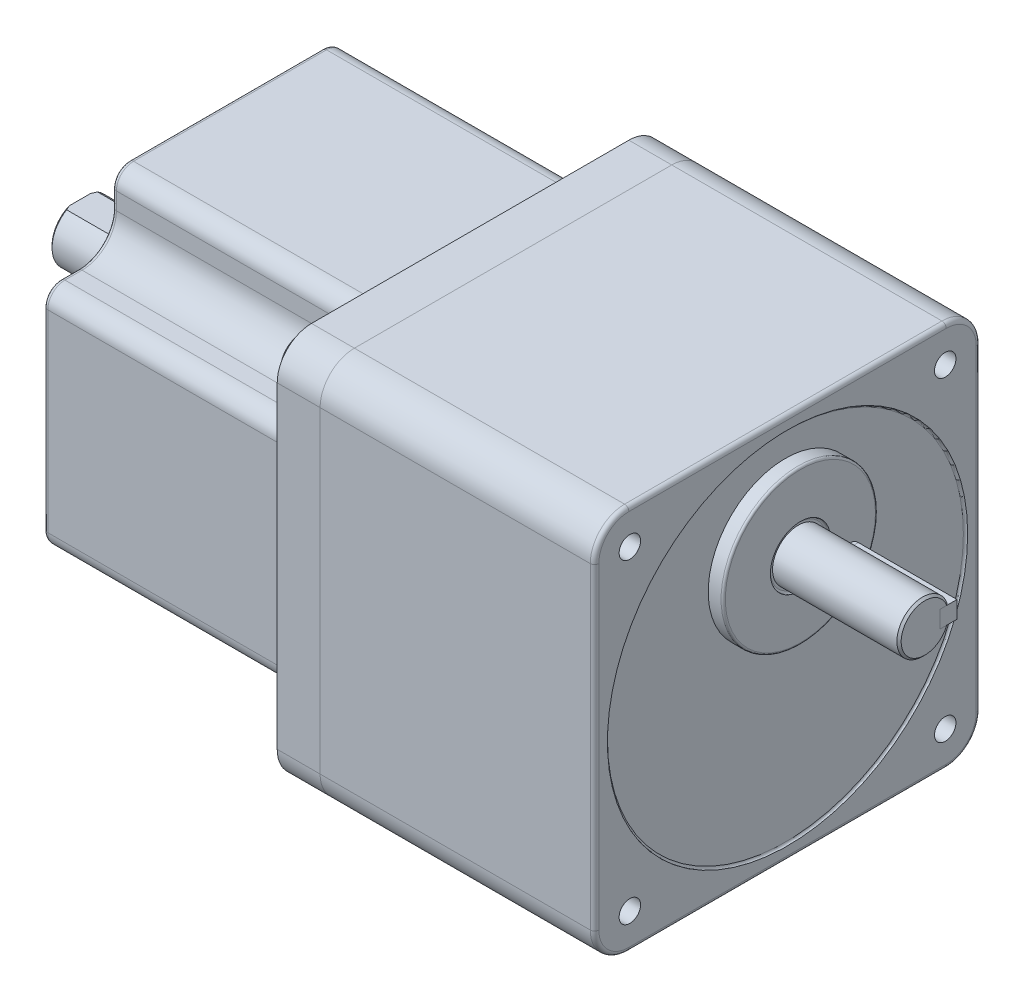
ISO-10303-21;
HEADER;
FILE_DESCRIPTION(('STEP AP214'),'2;1');
FILE_NAME('part.step','',(''),(''),'','','');
FILE_SCHEMA(('AUTOMOTIVE_DESIGN { 1 0 10303 214 1 1 1 1 }'));
ENDSEC;
DATA;
#1=APPLICATION_CONTEXT('core data for automotive mechanical design processes');
#2=APPLICATION_PROTOCOL_DEFINITION('international standard','automotive_design',2000,#1);
#3=PRODUCT_CONTEXT('',#1,'mechanical');
#4=PRODUCT('Part','Part','',(#3));
#5=PRODUCT_RELATED_PRODUCT_CATEGORY('part','',(#4));
#6=PRODUCT_DEFINITION_FORMATION('','',#4);
#7=PRODUCT_DEFINITION_CONTEXT('part definition',#1,'design');
#8=PRODUCT_DEFINITION('design','',#6,#7);
#9=PRODUCT_DEFINITION_SHAPE('','',#8);
#10=(LENGTH_UNIT() NAMED_UNIT(*) SI_UNIT(.MILLI.,.METRE.));
#11=(NAMED_UNIT(*) PLANE_ANGLE_UNIT() SI_UNIT($,.RADIAN.));
#12=(NAMED_UNIT(*) SI_UNIT($,.STERADIAN.) SOLID_ANGLE_UNIT());
#13=UNCERTAINTY_MEASURE_WITH_UNIT(LENGTH_MEASURE(1.E-05),#10,'distance_accuracy_value','');
#14=(GEOMETRIC_REPRESENTATION_CONTEXT(3) GLOBAL_UNCERTAINTY_ASSIGNED_CONTEXT((#13)) GLOBAL_UNIT_ASSIGNED_CONTEXT((#10,
#11,#12)) REPRESENTATION_CONTEXT('',''));
#15=CARTESIAN_POINT('',(0.,0.,0.));
#16=DIRECTION('',(0.,0.,1.));
#17=DIRECTION('',(1.,0.,0.));
#18=AXIS2_PLACEMENT_3D('',#15,#16,#17);
#19=CARTESIAN_POINT('',(9.,18.,-7.5));
#20=DIRECTION('',(0.,0.,1.));
#21=DIRECTION('',(1.,0.,0.));
#22=AXIS2_PLACEMENT_3D('',#19,#20,#21);
#23=CYLINDRICAL_SURFACE('',#22,2.);
#24=CARTESIAN_POINT('',(9.,18.,-3.5));
#25=DIRECTION('',(0.,0.,-1.));
#26=DIRECTION('',(-1.,0.,0.));
#27=AXIS2_PLACEMENT_3D('',#24,#25,#26);
#28=CIRCLE('',#27,2.);
#29=CARTESIAN_POINT('',(9.,16.,-3.5));
#30=VERTEX_POINT('',#29);
#31=CARTESIAN_POINT('',(9.,20.,-3.5));
#32=VERTEX_POINT('',#31);
#33=EDGE_CURVE('E113',#30,#32,#28,.T.);
#34=ORIENTED_EDGE('',*,*,#33,.T.);
#35=DIRECTION('',(0.,0.,1.));
#36=VECTOR('',#35,1.);
#37=CARTESIAN_POINT('',(9.,20.,-7.5));
#38=LINE('',#37,#36);
#39=CARTESIAN_POINT('',(9.,20.,-7.5));
#40=VERTEX_POINT('',#39);
#41=EDGE_CURVE('E12',#40,#32,#38,.T.);
#42=ORIENTED_EDGE('',*,*,#41,.F.);
#43=CARTESIAN_POINT('',(9.,18.,-7.5));
#44=DIRECTION('',(0.,0.,-1.));
#45=DIRECTION('',(-1.,0.,0.));
#46=AXIS2_PLACEMENT_3D('',#43,#44,#45);
#47=CIRCLE('',#46,2.);
#48=CARTESIAN_POINT('',(9.,16.,-7.5));
#49=VERTEX_POINT('',#48);
#50=EDGE_CURVE('E101',#49,#40,#47,.T.);
#51=ORIENTED_EDGE('',*,*,#50,.F.);
#52=DIRECTION('',(0.,0.,1.));
#53=VECTOR('',#52,1.);
#54=CARTESIAN_POINT('',(9.,16.,-7.5));
#55=LINE('',#54,#53);
#56=EDGE_CURVE('E109',#49,#30,#55,.T.);
#57=ORIENTED_EDGE('',*,*,#56,.T.);
#58=EDGE_LOOP('',(#34,#42,#51,#57));
#59=FACE_BOUND('',#58,.T.);
#60=ADVANCED_FACE('F50',(#59),#23,.T.);
#61=CARTESIAN_POINT('',(9.,20.,-7.5));
#62=DIRECTION('',(0.,-1.,0.));
#63=DIRECTION('',(0.,0.,-1.));
#64=AXIS2_PLACEMENT_3D('',#61,#62,#63);
#65=PLANE('',#64);
#66=DIRECTION('',(1.,0.,0.));
#67=VECTOR('',#66,1.);
#68=CARTESIAN_POINT('',(9.,20.,-3.5));
#69=LINE('',#68,#67);
#70=CARTESIAN_POINT('',(32.,20.,-3.5));
#71=VERTEX_POINT('',#70);
#72=EDGE_CURVE('E105',#32,#71,#69,.T.);
#73=ORIENTED_EDGE('',*,*,#72,.T.);
#74=DIRECTION('',(0.,0.,1.));
#75=VECTOR('',#74,1.);
#76=CARTESIAN_POINT('',(32.,20.,-7.5));
#77=LINE('',#76,#75);
#78=CARTESIAN_POINT('',(32.,20.,-7.5));
#79=VERTEX_POINT('',#78);
#80=EDGE_CURVE('E58',#79,#71,#77,.T.);
#81=ORIENTED_EDGE('',*,*,#80,.F.);
#82=DIRECTION('',(1.,0.,0.));
#83=VECTOR('',#82,1.);
#84=CARTESIAN_POINT('',(9.,20.,-7.5));
#85=LINE('',#84,#83);
#86=EDGE_CURVE('E96',#40,#79,#85,.T.);
#87=ORIENTED_EDGE('',*,*,#86,.F.);
#88=ORIENTED_EDGE('',*,*,#41,.T.);
#89=EDGE_LOOP('',(#73,#81,#87,#88));
#90=FACE_BOUND('',#89,.T.);
#91=ADVANCED_FACE('F104',(#90),#65,.F.);
#92=CARTESIAN_POINT('',(32.,20.,-7.5));
#93=DIRECTION('',(-1.,0.,0.));
#94=DIRECTION('',(0.,0.,1.));
#95=AXIS2_PLACEMENT_3D('',#92,#93,#94);
#96=PLANE('',#95);
#97=DIRECTION('',(0.,-1.,0.));
#98=VECTOR('',#97,1.);
#99=CARTESIAN_POINT('',(32.,20.,-3.5));
#100=LINE('',#99,#98);
#101=CARTESIAN_POINT('',(32.,16.,-3.5));
#102=VERTEX_POINT('',#101);
#103=EDGE_CURVE('E83',#71,#102,#100,.T.);
#104=ORIENTED_EDGE('',*,*,#103,.T.);
#105=DIRECTION('',(0.,0.,1.));
#106=VECTOR('',#105,1.);
#107=CARTESIAN_POINT('',(32.,16.,-7.5));
#108=LINE('',#107,#106);
#109=CARTESIAN_POINT('',(32.,16.,-7.5));
#110=VERTEX_POINT('',#109);
#111=EDGE_CURVE('E106',#110,#102,#108,.T.);
#112=ORIENTED_EDGE('',*,*,#111,.F.);
#113=DIRECTION('',(0.,-1.,0.));
#114=VECTOR('',#113,1.);
#115=CARTESIAN_POINT('',(32.,20.,-7.5));
#116=LINE('',#115,#114);
#117=EDGE_CURVE('E99',#79,#110,#116,.T.);
#118=ORIENTED_EDGE('',*,*,#117,.F.);
#119=ORIENTED_EDGE('',*,*,#80,.T.);
#120=EDGE_LOOP('',(#104,#112,#118,#119));
#121=FACE_BOUND('',#120,.T.);
#122=ADVANCED_FACE('F107',(#121),#96,.F.);
#123=CARTESIAN_POINT('',(32.,16.,-7.5));
#124=DIRECTION('',(0.,1.,0.));
#125=DIRECTION('',(0.,0.,1.));
#126=AXIS2_PLACEMENT_3D('',#123,#124,#125);
#127=PLANE('',#126);
#128=DIRECTION('',(-1.,0.,0.));
#129=VECTOR('',#128,1.);
#130=CARTESIAN_POINT('',(32.,16.,-3.5));
#131=LINE('',#130,#129);
#132=EDGE_CURVE('E89',#102,#30,#131,.T.);
#133=ORIENTED_EDGE('',*,*,#132,.T.);
#134=ORIENTED_EDGE('',*,*,#56,.F.);
#135=DIRECTION('',(-1.,0.,0.));
#136=VECTOR('',#135,1.);
#137=CARTESIAN_POINT('',(32.,16.,-7.5));
#138=LINE('',#137,#136);
#139=EDGE_CURVE('E66',#110,#49,#138,.T.);
#140=ORIENTED_EDGE('',*,*,#139,.F.);
#141=ORIENTED_EDGE('',*,*,#111,.T.);
#142=EDGE_LOOP('',(#133,#134,#140,#141));
#143=FACE_BOUND('',#142,.T.);
#144=ADVANCED_FACE('F120',(#143),#127,.F.);
#145=CARTESIAN_POINT('',(9.,18.,-7.5));
#146=DIRECTION('',(0.,0.,-1.));
#147=DIRECTION('',(-1.,0.,0.));
#148=AXIS2_PLACEMENT_3D('',#145,#146,#147);
#149=PLANE('',#148);
#150=ORIENTED_EDGE('',*,*,#50,.T.);
#151=ORIENTED_EDGE('',*,*,#86,.T.);
#152=ORIENTED_EDGE('',*,*,#117,.T.);
#153=ORIENTED_EDGE('',*,*,#139,.T.);
#154=EDGE_LOOP('',(#150,#151,#152,#153));
#155=FACE_BOUND('',#154,.T.);
#156=ADVANCED_FACE('F97',(#155),#149,.T.);
#157=CARTESIAN_POINT('',(9.,18.,-3.5));
#158=DIRECTION('',(0.,0.,-1.));
#159=DIRECTION('',(-1.,0.,0.));
#160=AXIS2_PLACEMENT_3D('',#157,#158,#159);
#161=PLANE('',#160);
#162=ORIENTED_EDGE('',*,*,#33,.F.);
#163=ORIENTED_EDGE('',*,*,#132,.F.);
#164=ORIENTED_EDGE('',*,*,#103,.F.);
#165=ORIENTED_EDGE('',*,*,#72,.F.);
#166=EDGE_LOOP('',(#162,#163,#164,#165));
#167=FACE_BOUND('',#166,.T.);
#168=ADVANCED_FACE('F123',(#167),#161,.F.);
#169=CLOSED_SHELL('',(#60,#91,#122,#144,#156,#168));
#170=MANIFOLD_SOLID_BREP('B2',#169);
#171=CARTESIAN_POINT('',(-131.,-34.5,34.5));
#172=DIRECTION('',(-1.,0.,0.));
#173=DIRECTION('',(0.,0.,1.));
#174=AXIS2_PLACEMENT_3D('',#171,#172,#173);
#175=PLANE('',#174);
#176=DIRECTION('',(0.,0.,1.));
#177=VECTOR('',#176,1.);
#178=CARTESIAN_POINT('',(-131.,-25.5,34.5));
#179=LINE('',#178,#177);
#180=CARTESIAN_POINT('',(-131.,-25.5,-38.5));
#181=VERTEX_POINT('',#180);
#182=CARTESIAN_POINT('',(-131.,-25.5,-34.5));
#183=VERTEX_POINT('',#182);
#184=EDGE_CURVE('E1138',#181,#183,#179,.T.);
#185=ORIENTED_EDGE('',*,*,#184,.T.);
#186=CARTESIAN_POINT('',(-131.,-34.5,-34.5));
#187=DIRECTION('',(-1.,0.,0.));
#188=DIRECTION('',(0.,0.,1.));
#189=AXIS2_PLACEMENT_3D('',#186,#187,#188);
#190=CIRCLE('',#189,9.);
#191=CARTESIAN_POINT('',(-131.,-34.5,-25.5));
#192=VERTEX_POINT('',#191);
#193=EDGE_CURVE('E1140',#183,#192,#190,.F.);
#194=ORIENTED_EDGE('',*,*,#193,.T.);
#195=DIRECTION('',(0.,-1.,0.));
#196=VECTOR('',#195,1.);
#197=CARTESIAN_POINT('',(-131.,-34.5,-25.5));
#198=LINE('',#197,#196);
#199=CARTESIAN_POINT('',(-131.,-38.5,-25.5));
#200=VERTEX_POINT('',#199);
#201=EDGE_CURVE('E1094',#192,#200,#198,.T.);
#202=ORIENTED_EDGE('',*,*,#201,.T.);
#203=CARTESIAN_POINT('',(-131.,-38.5,-22.5));
#204=DIRECTION('',(-1.,0.,0.));
#205=DIRECTION('',(0.,0.,1.));
#206=AXIS2_PLACEMENT_3D('',#203,#204,#205);
#207=CIRCLE('',#206,3.);
#208=CARTESIAN_POINT('',(-131.,-41.5,-22.5));
#209=VERTEX_POINT('',#208);
#210=EDGE_CURVE('E1096',#200,#209,#207,.T.);
#211=ORIENTED_EDGE('',*,*,#210,.T.);
#212=DIRECTION('',(0.,0.,1.));
#213=VECTOR('',#212,1.);
#214=CARTESIAN_POINT('',(-131.,-41.5,22.5));
#215=LINE('',#214,#213);
#216=CARTESIAN_POINT('',(-131.,-41.5,22.5));
#217=VERTEX_POINT('',#216);
#218=EDGE_CURVE('E1098',#209,#217,#215,.T.);
#219=ORIENTED_EDGE('',*,*,#218,.T.);
#220=CARTESIAN_POINT('',(-131.,-38.5,22.5));
#221=DIRECTION('',(-1.,0.,0.));
#222=DIRECTION('',(0.,0.,1.));
#223=AXIS2_PLACEMENT_3D('',#220,#221,#222);
#224=CIRCLE('',#223,3.);
#225=CARTESIAN_POINT('',(-131.,-38.5,25.5));
#226=VERTEX_POINT('',#225);
#227=EDGE_CURVE('E1100',#217,#226,#224,.T.);
#228=ORIENTED_EDGE('',*,*,#227,.T.);
#229=DIRECTION('',(0.,1.,0.));
#230=VECTOR('',#229,1.);
#231=CARTESIAN_POINT('',(-131.,-34.5,25.5));
#232=LINE('',#231,#230);
#233=CARTESIAN_POINT('',(-131.,-34.5,25.5));
#234=VERTEX_POINT('',#233);
#235=EDGE_CURVE('E1102',#226,#234,#232,.T.);
#236=ORIENTED_EDGE('',*,*,#235,.T.);
#237=CARTESIAN_POINT('',(-131.,-34.5,34.5));
#238=DIRECTION('',(-1.,0.,0.));
#239=DIRECTION('',(0.,0.,1.));
#240=AXIS2_PLACEMENT_3D('',#237,#238,#239);
#241=CIRCLE('',#240,9.00000000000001);
#242=CARTESIAN_POINT('',(-131.,-25.5,34.5));
#243=VERTEX_POINT('',#242);
#244=EDGE_CURVE('E1104',#234,#243,#241,.F.);
#245=ORIENTED_EDGE('',*,*,#244,.T.);
#246=DIRECTION('',(0.,0.,1.));
#247=VECTOR('',#246,1.);
#248=CARTESIAN_POINT('',(-131.,-25.5,34.5));
#249=LINE('',#248,#247);
#250=CARTESIAN_POINT('',(-131.,-25.5,38.5));
#251=VERTEX_POINT('',#250);
#252=EDGE_CURVE('E1106',#243,#251,#249,.T.);
#253=ORIENTED_EDGE('',*,*,#252,.T.);
#254=CARTESIAN_POINT('',(-131.,-22.5,38.5));
#255=DIRECTION('',(-1.,0.,0.));
#256=DIRECTION('',(0.,0.,1.));
#257=AXIS2_PLACEMENT_3D('',#254,#255,#256);
#258=CIRCLE('',#257,3.);
#259=CARTESIAN_POINT('',(-131.,-22.5,41.5));
#260=VERTEX_POINT('',#259);
#261=EDGE_CURVE('E1108',#251,#260,#258,.T.);
#262=ORIENTED_EDGE('',*,*,#261,.T.);
#263=DIRECTION('',(0.,1.,0.));
#264=VECTOR('',#263,1.);
#265=CARTESIAN_POINT('',(-131.,22.5,41.5));
#266=LINE('',#265,#264);
#267=CARTESIAN_POINT('',(-131.,22.5,41.5));
#268=VERTEX_POINT('',#267);
#269=EDGE_CURVE('E1110',#260,#268,#266,.T.);
#270=ORIENTED_EDGE('',*,*,#269,.T.);
#271=CARTESIAN_POINT('',(-131.,22.5,38.5));
#272=DIRECTION('',(-1.,0.,0.));
#273=DIRECTION('',(0.,0.,1.));
#274=AXIS2_PLACEMENT_3D('',#271,#272,#273);
#275=CIRCLE('',#274,3.);
#276=CARTESIAN_POINT('',(-131.,25.5,38.5));
#277=VERTEX_POINT('',#276);
#278=EDGE_CURVE('E1112',#268,#277,#275,.T.);
#279=ORIENTED_EDGE('',*,*,#278,.T.);
#280=DIRECTION('',(0.,0.,1.));
#281=VECTOR('',#280,1.);
#282=CARTESIAN_POINT('',(-131.,25.5,34.5));
#283=LINE('',#282,#281);
#284=CARTESIAN_POINT('',(-131.,25.5,34.5));
#285=VERTEX_POINT('',#284);
#286=EDGE_CURVE('E1114',#277,#285,#283,.F.);
#287=ORIENTED_EDGE('',*,*,#286,.T.);
#288=CARTESIAN_POINT('',(-131.,34.5,34.5));
#289=DIRECTION('',(-1.,0.,0.));
#290=DIRECTION('',(0.,0.,1.));
#291=AXIS2_PLACEMENT_3D('',#288,#289,#290);
#292=CIRCLE('',#291,9.);
#293=CARTESIAN_POINT('',(-131.,34.5,25.5));
#294=VERTEX_POINT('',#293);
#295=EDGE_CURVE('E1116',#285,#294,#292,.F.);
#296=ORIENTED_EDGE('',*,*,#295,.T.);
#297=DIRECTION('',(0.,1.,0.));
#298=VECTOR('',#297,1.);
#299=CARTESIAN_POINT('',(-131.,-34.5,25.5));
#300=LINE('',#299,#298);
#301=CARTESIAN_POINT('',(-131.,38.5,25.5));
#302=VERTEX_POINT('',#301);
#303=EDGE_CURVE('E1118',#294,#302,#300,.T.);
#304=ORIENTED_EDGE('',*,*,#303,.T.);
#305=CARTESIAN_POINT('',(-131.,38.5,22.5));
#306=DIRECTION('',(-1.,0.,0.));
#307=DIRECTION('',(0.,0.,1.));
#308=AXIS2_PLACEMENT_3D('',#305,#306,#307);
#309=CIRCLE('',#308,3.);
#310=CARTESIAN_POINT('',(-131.,41.5,22.5));
#311=VERTEX_POINT('',#310);
#312=EDGE_CURVE('E1120',#302,#311,#309,.T.);
#313=ORIENTED_EDGE('',*,*,#312,.T.);
#314=DIRECTION('',(0.,0.,-1.));
#315=VECTOR('',#314,1.);
#316=CARTESIAN_POINT('',(-131.,41.5,-22.5));
#317=LINE('',#316,#315);
#318=CARTESIAN_POINT('',(-131.,41.5,-22.5));
#319=VERTEX_POINT('',#318);
#320=EDGE_CURVE('E1122',#311,#319,#317,.T.);
#321=ORIENTED_EDGE('',*,*,#320,.T.);
#322=CARTESIAN_POINT('',(-131.,38.5,-22.5));
#323=DIRECTION('',(-1.,0.,0.));
#324=DIRECTION('',(0.,0.,1.));
#325=AXIS2_PLACEMENT_3D('',#322,#323,#324);
#326=CIRCLE('',#325,3.);
#327=CARTESIAN_POINT('',(-131.,38.5,-25.5));
#328=VERTEX_POINT('',#327);
#329=EDGE_CURVE('E1124',#319,#328,#326,.T.);
#330=ORIENTED_EDGE('',*,*,#329,.T.);
#331=DIRECTION('',(0.,-1.,0.));
#332=VECTOR('',#331,1.);
#333=CARTESIAN_POINT('',(-131.,-34.5,-25.5));
#334=LINE('',#333,#332);
#335=CARTESIAN_POINT('',(-131.,34.5,-25.5));
#336=VERTEX_POINT('',#335);
#337=EDGE_CURVE('E1126',#328,#336,#334,.T.);
#338=ORIENTED_EDGE('',*,*,#337,.T.);
#339=CARTESIAN_POINT('',(-131.,34.5,-34.5));
#340=DIRECTION('',(-1.,0.,0.));
#341=DIRECTION('',(0.,0.,1.));
#342=AXIS2_PLACEMENT_3D('',#339,#340,#341);
#343=CIRCLE('',#342,9.);
#344=CARTESIAN_POINT('',(-131.,25.5,-34.5));
#345=VERTEX_POINT('',#344);
#346=EDGE_CURVE('E1128',#336,#345,#343,.F.);
#347=ORIENTED_EDGE('',*,*,#346,.T.);
#348=DIRECTION('',(0.,0.,-1.));
#349=VECTOR('',#348,1.);
#350=CARTESIAN_POINT('',(-131.,25.5,34.5));
#351=LINE('',#350,#349);
#352=CARTESIAN_POINT('',(-131.,25.5,-38.5));
#353=VERTEX_POINT('',#352);
#354=EDGE_CURVE('E1130',#345,#353,#351,.T.);
#355=ORIENTED_EDGE('',*,*,#354,.T.);
#356=CARTESIAN_POINT('',(-131.,22.5,-38.5));
#357=DIRECTION('',(-1.,0.,0.));
#358=DIRECTION('',(0.,0.,1.));
#359=AXIS2_PLACEMENT_3D('',#356,#357,#358);
#360=CIRCLE('',#359,3.);
#361=CARTESIAN_POINT('',(-131.,22.5,-41.5));
#362=VERTEX_POINT('',#361);
#363=EDGE_CURVE('E1132',#353,#362,#360,.T.);
#364=ORIENTED_EDGE('',*,*,#363,.T.);
#365=DIRECTION('',(0.,-1.,0.));
#366=VECTOR('',#365,1.);
#367=CARTESIAN_POINT('',(-131.,-22.5,-41.5));
#368=LINE('',#367,#366);
#369=CARTESIAN_POINT('',(-131.,-22.5,-41.5));
#370=VERTEX_POINT('',#369);
#371=EDGE_CURVE('E1134',#362,#370,#368,.T.);
#372=ORIENTED_EDGE('',*,*,#371,.T.);
#373=CARTESIAN_POINT('',(-131.,-22.5,-38.5));
#374=DIRECTION('',(-1.,0.,0.));
#375=DIRECTION('',(0.,0.,1.));
#376=AXIS2_PLACEMENT_3D('',#373,#374,#375);
#377=CIRCLE('',#376,3.);
#378=EDGE_CURVE('E1136',#370,#181,#377,.T.);
#379=ORIENTED_EDGE('',*,*,#378,.T.);
#380=EDGE_LOOP('',(#185,#194,#202,#211,#219,#228,#236,#245,#253,#262,#270,#279,#287,#296,#304,
#313,#321,#330,#338,#347,#355,#364,#372,#379));
#381=FACE_BOUND('',#380,.T.);
#382=CARTESIAN_POINT('',(-131.,0.,0.));
#383=DIRECTION('',(-1.,0.,0.));
#384=DIRECTION('',(0.,0.,1.));
#385=AXIS2_PLACEMENT_3D('',#382,#383,#384);
#386=CIRCLE('',#385,7.);
#387=CARTESIAN_POINT('',(-131.,0.,7.));
#388=VERTEX_POINT('',#387);
#389=EDGE_CURVE('E754',#388,#388,#386,.T.);
#390=ORIENTED_EDGE('',*,*,#389,.F.);
#391=EDGE_LOOP('',(#390));
#392=FACE_BOUND('',#391,.T.);
#393=ADVANCED_FACE('F183',(#381,#392),#175,.T.);
#394=CARTESIAN_POINT('',(-74.,37.,37.));
#395=DIRECTION('',(1.,0.,0.));
#396=DIRECTION('',(0.,0.,-1.));
#397=AXIS2_PLACEMENT_3D('',#394,#395,#396);
#398=PLANE('',#397);
#399=CARTESIAN_POINT('',(-74.,-34.5,34.5));
#400=DIRECTION('',(1.,0.,0.));
#401=DIRECTION('',(0.,0.,-1.));
#402=AXIS2_PLACEMENT_3D('',#399,#400,#401);
#403=CIRCLE('',#402,5.);
#404=CARTESIAN_POINT('',(-74.,-34.5,29.5));
#405=VERTEX_POINT('',#404);
#406=EDGE_CURVE('E1263',#405,#405,#403,.F.);
#407=ORIENTED_EDGE('',*,*,#406,.F.);
#408=EDGE_LOOP('',(#407));
#409=FACE_BOUND('',#408,.T.);
#410=CARTESIAN_POINT('',(-74.,34.5,-34.5));
#411=DIRECTION('',(1.,0.,0.));
#412=DIRECTION('',(0.,0.,-1.));
#413=AXIS2_PLACEMENT_3D('',#410,#411,#412);
#414=CIRCLE('',#413,5.);
#415=CARTESIAN_POINT('',(-74.,34.5,-39.5));
#416=VERTEX_POINT('',#415);
#417=EDGE_CURVE('E1189',#416,#416,#414,.F.);
#418=ORIENTED_EDGE('',*,*,#417,.F.);
#419=EDGE_LOOP('',(#418));
#420=FACE_BOUND('',#419,.T.);
#421=DIRECTION('',(0.,1.,0.));
#422=VECTOR('',#421,1.);
#423=CARTESIAN_POINT('',(-74.,-34.4999999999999,42.5));
#424=LINE('',#423,#422);
#425=CARTESIAN_POINT('',(-74.,-22.5,42.5));
#426=VERTEX_POINT('',#425);
#427=CARTESIAN_POINT('',(-74.,22.5,42.5));
#428=VERTEX_POINT('',#427);
#429=EDGE_CURVE('E1010',#426,#428,#424,.T.);
#430=ORIENTED_EDGE('',*,*,#429,.F.);
#431=CARTESIAN_POINT('',(-74.,-22.5,38.5));
#432=DIRECTION('',(-1.,0.,0.));
#433=DIRECTION('',(0.,0.,1.));
#434=AXIS2_PLACEMENT_3D('',#431,#432,#433);
#435=CIRCLE('',#434,4.);
#436=CARTESIAN_POINT('',(-74.,-26.5,38.5));
#437=VERTEX_POINT('',#436);
#438=EDGE_CURVE('E921',#437,#426,#435,.T.);
#439=ORIENTED_EDGE('',*,*,#438,.F.);
#440=DIRECTION('',(0.,0.,1.));
#441=VECTOR('',#440,1.);
#442=CARTESIAN_POINT('',(-74.,-26.5,0.));
#443=LINE('',#442,#441);
#444=CARTESIAN_POINT('',(-74.,-26.5,34.5));
#445=VERTEX_POINT('',#444);
#446=EDGE_CURVE('E937',#445,#437,#443,.T.);
#447=ORIENTED_EDGE('',*,*,#446,.F.);
#448=CARTESIAN_POINT('',(-74.,-34.5,34.5));
#449=DIRECTION('',(-1.,0.,0.));
#450=DIRECTION('',(0.,0.,1.));
#451=AXIS2_PLACEMENT_3D('',#448,#449,#450);
#452=CIRCLE('',#451,8.00000000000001);
#453=CARTESIAN_POINT('',(-74.,-34.5,26.5));
#454=VERTEX_POINT('',#453);
#455=EDGE_CURVE('E939',#445,#454,#452,.T.);
#456=ORIENTED_EDGE('',*,*,#455,.T.);
#457=DIRECTION('',(0.,1.,0.));
#458=VECTOR('',#457,1.);
#459=CARTESIAN_POINT('',(-74.,0.,26.5));
#460=LINE('',#459,#458);
#461=CARTESIAN_POINT('',(-74.,-38.5,26.5));
#462=VERTEX_POINT('',#461);
#463=EDGE_CURVE('E942',#462,#454,#460,.T.);
#464=ORIENTED_EDGE('',*,*,#463,.F.);
#465=CARTESIAN_POINT('',(-74.,-38.5,22.5));
#466=DIRECTION('',(-1.,0.,0.));
#467=DIRECTION('',(0.,0.,1.));
#468=AXIS2_PLACEMENT_3D('',#465,#466,#467);
#469=CIRCLE('',#468,4.);
#470=CARTESIAN_POINT('',(-74.,-42.5,22.5));
#471=VERTEX_POINT('',#470);
#472=EDGE_CURVE('E944',#471,#462,#469,.T.);
#473=ORIENTED_EDGE('',*,*,#472,.F.);
#474=DIRECTION('',(0.,0.,1.));
#475=VECTOR('',#474,1.);
#476=CARTESIAN_POINT('',(-74.,-42.5,-34.5));
#477=LINE('',#476,#475);
#478=CARTESIAN_POINT('',(-74.,-42.5,-22.5));
#479=VERTEX_POINT('',#478);
#480=EDGE_CURVE('E1031',#479,#471,#477,.T.);
#481=ORIENTED_EDGE('',*,*,#480,.F.);
#482=CARTESIAN_POINT('',(-74.,-38.5,-22.5));
#483=DIRECTION('',(-1.,0.,0.));
#484=DIRECTION('',(0.,0.,1.));
#485=AXIS2_PLACEMENT_3D('',#482,#483,#484);
#486=CIRCLE('',#485,4.);
#487=CARTESIAN_POINT('',(-74.,-38.5,-26.5));
#488=VERTEX_POINT('',#487);
#489=EDGE_CURVE('E905',#488,#479,#486,.T.);
#490=ORIENTED_EDGE('',*,*,#489,.F.);
#491=DIRECTION('',(0.,-1.,0.));
#492=VECTOR('',#491,1.);
#493=CARTESIAN_POINT('',(-74.,0.,-26.5));
#494=LINE('',#493,#492);
#495=CARTESIAN_POINT('',(-74.,-34.5,-26.5));
#496=VERTEX_POINT('',#495);
#497=EDGE_CURVE('E907',#496,#488,#494,.T.);
#498=ORIENTED_EDGE('',*,*,#497,.F.);
#499=CARTESIAN_POINT('',(-74.,-34.5,-34.5));
#500=DIRECTION('',(-1.,0.,0.));
#501=DIRECTION('',(0.,0.,1.));
#502=AXIS2_PLACEMENT_3D('',#499,#500,#501);
#503=CIRCLE('',#502,8.);
#504=CARTESIAN_POINT('',(-74.,-26.5,-34.5));
#505=VERTEX_POINT('',#504);
#506=EDGE_CURVE('E910',#496,#505,#503,.T.);
#507=ORIENTED_EDGE('',*,*,#506,.T.);
#508=DIRECTION('',(0.,0.,1.));
#509=VECTOR('',#508,1.);
#510=CARTESIAN_POINT('',(-74.,-26.5,0.));
#511=LINE('',#510,#509);
#512=CARTESIAN_POINT('',(-74.,-26.5,-38.5));
#513=VERTEX_POINT('',#512);
#514=EDGE_CURVE('E913',#513,#505,#511,.T.);
#515=ORIENTED_EDGE('',*,*,#514,.F.);
#516=CARTESIAN_POINT('',(-74.,-22.5,-38.5));
#517=DIRECTION('',(-1.,0.,0.));
#518=DIRECTION('',(0.,0.,1.));
#519=AXIS2_PLACEMENT_3D('',#516,#517,#518);
#520=CIRCLE('',#519,4.);
#521=CARTESIAN_POINT('',(-74.,-22.5,-42.5));
#522=VERTEX_POINT('',#521);
#523=EDGE_CURVE('E915',#522,#513,#520,.T.);
#524=ORIENTED_EDGE('',*,*,#523,.F.);
#525=DIRECTION('',(0.,-1.,0.));
#526=VECTOR('',#525,1.);
#527=CARTESIAN_POINT('',(-74.,-34.4999999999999,-42.5));
#528=LINE('',#527,#526);
#529=CARTESIAN_POINT('',(-74.,22.5,-42.5));
#530=VERTEX_POINT('',#529);
#531=EDGE_CURVE('E1028',#530,#522,#528,.T.);
#532=ORIENTED_EDGE('',*,*,#531,.F.);
#533=CARTESIAN_POINT('',(-74.,22.5,-38.5));
#534=DIRECTION('',(-1.,0.,0.));
#535=DIRECTION('',(0.,0.,1.));
#536=AXIS2_PLACEMENT_3D('',#533,#534,#535);
#537=CIRCLE('',#536,4.);
#538=CARTESIAN_POINT('',(-74.,26.5,-38.5));
#539=VERTEX_POINT('',#538);
#540=EDGE_CURVE('E981',#539,#530,#537,.T.);
#541=ORIENTED_EDGE('',*,*,#540,.F.);
#542=DIRECTION('',(0.,0.,-1.));
#543=VECTOR('',#542,1.);
#544=CARTESIAN_POINT('',(-74.,26.5,0.));
#545=LINE('',#544,#543);
#546=CARTESIAN_POINT('',(-74.,26.5,-34.5));
#547=VERTEX_POINT('',#546);
#548=EDGE_CURVE('E997',#547,#539,#545,.T.);
#549=ORIENTED_EDGE('',*,*,#548,.F.);
#550=CARTESIAN_POINT('',(-74.,34.5,-34.5));
#551=DIRECTION('',(-1.,0.,0.));
#552=DIRECTION('',(0.,0.,1.));
#553=AXIS2_PLACEMENT_3D('',#550,#551,#552);
#554=CIRCLE('',#553,8.);
#555=CARTESIAN_POINT('',(-74.,34.5,-26.5));
#556=VERTEX_POINT('',#555);
#557=EDGE_CURVE('E999',#547,#556,#554,.T.);
#558=ORIENTED_EDGE('',*,*,#557,.T.);
#559=DIRECTION('',(0.,-1.,0.));
#560=VECTOR('',#559,1.);
#561=CARTESIAN_POINT('',(-74.,0.,-26.5));
#562=LINE('',#561,#560);
#563=CARTESIAN_POINT('',(-74.,38.5,-26.5));
#564=VERTEX_POINT('',#563);
#565=EDGE_CURVE('E1002',#564,#556,#562,.T.);
#566=ORIENTED_EDGE('',*,*,#565,.F.);
#567=CARTESIAN_POINT('',(-74.,38.5,-22.5));
#568=DIRECTION('',(-1.,0.,0.));
#569=DIRECTION('',(0.,0.,1.));
#570=AXIS2_PLACEMENT_3D('',#567,#568,#569);
#571=CIRCLE('',#570,4.);
#572=CARTESIAN_POINT('',(-74.,42.5,-22.5));
#573=VERTEX_POINT('',#572);
#574=EDGE_CURVE('E1004',#573,#564,#571,.T.);
#575=ORIENTED_EDGE('',*,*,#574,.F.);
#576=DIRECTION('',(0.,0.,-1.));
#577=VECTOR('',#576,1.);
#578=CARTESIAN_POINT('',(-74.,42.5,-34.5));
#579=LINE('',#578,#577);
#580=CARTESIAN_POINT('',(-74.,42.5,22.5));
#581=VERTEX_POINT('',#580);
#582=EDGE_CURVE('E1026',#581,#573,#579,.T.);
#583=ORIENTED_EDGE('',*,*,#582,.F.);
#584=CARTESIAN_POINT('',(-74.,38.5,22.5));
#585=DIRECTION('',(-1.,0.,0.));
#586=DIRECTION('',(0.,0.,1.));
#587=AXIS2_PLACEMENT_3D('',#584,#585,#586);
#588=CIRCLE('',#587,4.);
#589=CARTESIAN_POINT('',(-74.,38.5,26.5));
#590=VERTEX_POINT('',#589);
#591=EDGE_CURVE('E950',#590,#581,#588,.T.);
#592=ORIENTED_EDGE('',*,*,#591,.F.);
#593=DIRECTION('',(0.,1.,0.));
#594=VECTOR('',#593,1.);
#595=CARTESIAN_POINT('',(-74.,0.,26.5));
#596=LINE('',#595,#594);
#597=CARTESIAN_POINT('',(-74.,34.5,26.5));
#598=VERTEX_POINT('',#597);
#599=EDGE_CURVE('E966',#598,#590,#596,.T.);
#600=ORIENTED_EDGE('',*,*,#599,.F.);
#601=CARTESIAN_POINT('',(-74.,34.5,34.5));
#602=DIRECTION('',(-1.,0.,0.));
#603=DIRECTION('',(0.,0.,1.));
#604=AXIS2_PLACEMENT_3D('',#601,#602,#603);
#605=CIRCLE('',#604,8.);
#606=CARTESIAN_POINT('',(-74.,26.5,34.5));
#607=VERTEX_POINT('',#606);
#608=EDGE_CURVE('E968',#598,#607,#605,.T.);
#609=ORIENTED_EDGE('',*,*,#608,.T.);
#610=DIRECTION('',(0.,0.,1.));
#611=VECTOR('',#610,1.);
#612=CARTESIAN_POINT('',(-74.,26.5,0.));
#613=LINE('',#612,#611);
#614=CARTESIAN_POINT('',(-74.,26.5,38.5));
#615=VERTEX_POINT('',#614);
#616=EDGE_CURVE('E971',#607,#615,#613,.T.);
#617=ORIENTED_EDGE('',*,*,#616,.T.);
#618=CARTESIAN_POINT('',(-74.,22.5,38.5));
#619=DIRECTION('',(-1.,0.,0.));
#620=DIRECTION('',(0.,0.,1.));
#621=AXIS2_PLACEMENT_3D('',#618,#619,#620);
#622=CIRCLE('',#621,4.);
#623=EDGE_CURVE('E974',#615,#428,#622,.F.);
#624=ORIENTED_EDGE('',*,*,#623,.T.);
#625=EDGE_LOOP('',(#430,#439,#447,#456,#464,#473,#481,#490,#498,#507,#515,#524,#532,#541,#549,
#558,#566,#575,#583,#592,#600,#609,#617,#624));
#626=FACE_BOUND('',#625,.T.);
#627=CARTESIAN_POINT('',(-74.,37.,37.));
#628=DIRECTION('',(-1.,0.,0.));
#629=DIRECTION('',(0.,0.,-1.));
#630=AXIS2_PLACEMENT_3D('',#627,#628,#629);
#631=CIRCLE('',#630,8.);
#632=CARTESIAN_POINT('',(-74.,36.9999999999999,45.));
#633=VERTEX_POINT('',#632);
#634=CARTESIAN_POINT('',(-74.,45.,36.9999999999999));
#635=VERTEX_POINT('',#634);
#636=EDGE_CURVE('E1034',#633,#635,#631,.T.);
#637=ORIENTED_EDGE('',*,*,#636,.T.);
#638=DIRECTION('',(0.,0.,-1.));
#639=VECTOR('',#638,1.);
#640=CARTESIAN_POINT('',(-74.,45.,-37.));
#641=LINE('',#640,#639);
#642=CARTESIAN_POINT('',(-74.,45.,-37.));
#643=VERTEX_POINT('',#642);
#644=EDGE_CURVE('E1037',#635,#643,#641,.T.);
#645=ORIENTED_EDGE('',*,*,#644,.T.);
#646=CARTESIAN_POINT('',(-74.,37.,-37.));
#647=DIRECTION('',(-1.,0.,0.));
#648=DIRECTION('',(0.,0.,-1.));
#649=AXIS2_PLACEMENT_3D('',#646,#647,#648);
#650=CIRCLE('',#649,8.);
#651=CARTESIAN_POINT('',(-74.,36.9999999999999,-45.));
#652=VERTEX_POINT('',#651);
#653=EDGE_CURVE('E1040',#643,#652,#650,.T.);
#654=ORIENTED_EDGE('',*,*,#653,.T.);
#655=DIRECTION('',(0.,-1.,0.));
#656=VECTOR('',#655,1.);
#657=CARTESIAN_POINT('',(-74.,-37.,-45.));
#658=LINE('',#657,#656);
#659=CARTESIAN_POINT('',(-74.,-37.,-45.));
#660=VERTEX_POINT('',#659);
#661=EDGE_CURVE('E1042',#652,#660,#658,.T.);
#662=ORIENTED_EDGE('',*,*,#661,.T.);
#663=CARTESIAN_POINT('',(-74.,-37.,-37.));
#664=DIRECTION('',(-1.,0.,0.));
#665=DIRECTION('',(0.,0.,-1.));
#666=AXIS2_PLACEMENT_3D('',#663,#664,#665);
#667=CIRCLE('',#666,8.);
#668=CARTESIAN_POINT('',(-74.,-45.,-37.));
#669=VERTEX_POINT('',#668);
#670=EDGE_CURVE('E1044',#660,#669,#667,.T.);
#671=ORIENTED_EDGE('',*,*,#670,.T.);
#672=DIRECTION('',(0.,0.,1.));
#673=VECTOR('',#672,1.);
#674=CARTESIAN_POINT('',(-74.,-45.,-37.));
#675=LINE('',#674,#673);
#676=CARTESIAN_POINT('',(-74.,-45.,36.9999999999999));
#677=VERTEX_POINT('',#676);
#678=EDGE_CURVE('E1046',#669,#677,#675,.T.);
#679=ORIENTED_EDGE('',*,*,#678,.T.);
#680=CARTESIAN_POINT('',(-74.,-37.,37.));
#681=DIRECTION('',(-1.,0.,0.));
#682=DIRECTION('',(0.,0.,1.));
#683=AXIS2_PLACEMENT_3D('',#680,#681,#682);
#684=CIRCLE('',#683,8.);
#685=CARTESIAN_POINT('',(-74.,-37.,45.));
#686=VERTEX_POINT('',#685);
#687=EDGE_CURVE('E1048',#677,#686,#684,.T.);
#688=ORIENTED_EDGE('',*,*,#687,.T.);
#689=DIRECTION('',(0.,1.,0.));
#690=VECTOR('',#689,1.);
#691=CARTESIAN_POINT('',(-74.,-37.,45.));
#692=LINE('',#691,#690);
#693=EDGE_CURVE('E1050',#686,#633,#692,.T.);
#694=ORIENTED_EDGE('',*,*,#693,.T.);
#695=EDGE_LOOP('',(#637,#645,#654,#662,#671,#679,#688,#694));
#696=FACE_BOUND('',#695,.T.);
#697=CARTESIAN_POINT('',(-74.,34.5,34.5));
#698=DIRECTION('',(1.,0.,0.));
#699=DIRECTION('',(0.,0.,-1.));
#700=AXIS2_PLACEMENT_3D('',#697,#698,#699);
#701=CIRCLE('',#700,5.);
#702=CARTESIAN_POINT('',(-74.,34.5,29.5));
#703=VERTEX_POINT('',#702);
#704=EDGE_CURVE('E1260',#703,#703,#701,.F.);
#705=ORIENTED_EDGE('',*,*,#704,.F.);
#706=EDGE_LOOP('',(#705));
#707=FACE_BOUND('',#706,.T.);
#708=CARTESIAN_POINT('',(-74.,-34.5,-34.5));
#709=DIRECTION('',(1.,0.,0.));
#710=DIRECTION('',(0.,0.,-1.));
#711=AXIS2_PLACEMENT_3D('',#708,#709,#710);
#712=CIRCLE('',#711,5.);
#713=CARTESIAN_POINT('',(-74.,-34.5,-39.5));
#714=VERTEX_POINT('',#713);
#715=EDGE_CURVE('E1266',#714,#714,#712,.F.);
#716=ORIENTED_EDGE('',*,*,#715,.F.);
#717=EDGE_LOOP('',(#716));
#718=FACE_BOUND('',#717,.T.);
#719=ADVANCED_FACE('F1510',(#409,#420,#626,#696,#707,#718),#398,.F.);
#720=CARTESIAN_POINT('',(-131.,-42.5,-34.5));
#721=DIRECTION('',(0.,1.,0.));
#722=DIRECTION('',(0.,0.,1.));
#723=AXIS2_PLACEMENT_3D('',#720,#721,#722);
#724=PLANE('',#723);
#725=DIRECTION('',(-1.,0.,0.));
#726=VECTOR('',#725,1.);
#727=CARTESIAN_POINT('',(-74.,-42.5,22.5));
#728=LINE('',#727,#726);
#729=CARTESIAN_POINT('',(-130.,-42.5,22.5));
#730=VERTEX_POINT('',#729);
#731=EDGE_CURVE('E951',#471,#730,#728,.T.);
#732=ORIENTED_EDGE('',*,*,#731,.T.);
#733=DIRECTION('',(0.,0.,1.));
#734=VECTOR('',#733,1.);
#735=CARTESIAN_POINT('',(-130.,-42.5,-22.5));
#736=LINE('',#735,#734);
#737=CARTESIAN_POINT('',(-130.,-42.5,-22.5));
#738=VERTEX_POINT('',#737);
#739=EDGE_CURVE('E1183',#730,#738,#736,.F.);
#740=ORIENTED_EDGE('',*,*,#739,.T.);
#741=DIRECTION('',(-1.,0.,0.));
#742=VECTOR('',#741,1.);
#743=CARTESIAN_POINT('',(-74.,-42.5,-22.5));
#744=LINE('',#743,#742);
#745=EDGE_CURVE('E918',#479,#738,#744,.T.);
#746=ORIENTED_EDGE('',*,*,#745,.F.);
#747=ORIENTED_EDGE('',*,*,#480,.T.);
#748=EDGE_LOOP('',(#732,#740,#746,#747));
#749=FACE_BOUND('',#748,.T.);
#750=ADVANCED_FACE('F1516',(#749),#724,.F.);
#751=CARTESIAN_POINT('',(-131.,-34.4999999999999,42.5));
#752=DIRECTION('',(0.,0.,-1.));
#753=DIRECTION('',(-1.,0.,0.));
#754=AXIS2_PLACEMENT_3D('',#751,#752,#753);
#755=PLANE('',#754);
#756=DIRECTION('',(-1.,0.,0.));
#757=VECTOR('',#756,1.);
#758=CARTESIAN_POINT('',(-74.,22.5,42.5));
#759=LINE('',#758,#757);
#760=CARTESIAN_POINT('',(-130.,22.5,42.5));
#761=VERTEX_POINT('',#760);
#762=EDGE_CURVE('E982',#428,#761,#759,.T.);
#763=ORIENTED_EDGE('',*,*,#762,.T.);
#764=DIRECTION('',(0.,1.,0.));
#765=VECTOR('',#764,1.);
#766=CARTESIAN_POINT('',(-130.,-22.5,42.5));
#767=LINE('',#766,#765);
#768=CARTESIAN_POINT('',(-130.,-22.5,42.5));
#769=VERTEX_POINT('',#768);
#770=EDGE_CURVE('E1171',#761,#769,#767,.F.);
#771=ORIENTED_EDGE('',*,*,#770,.T.);
#772=DIRECTION('',(-1.,0.,0.));
#773=VECTOR('',#772,1.);
#774=CARTESIAN_POINT('',(-74.,-22.5,42.5));
#775=LINE('',#774,#773);
#776=EDGE_CURVE('E947',#426,#769,#775,.T.);
#777=ORIENTED_EDGE('',*,*,#776,.F.);
#778=ORIENTED_EDGE('',*,*,#429,.T.);
#779=EDGE_LOOP('',(#763,#771,#777,#778));
#780=FACE_BOUND('',#779,.T.);
#781=ADVANCED_FACE('F1526',(#780),#755,.F.);
#782=CARTESIAN_POINT('',(-131.,42.5,-34.5));
#783=DIRECTION('',(0.,-1.,0.));
#784=DIRECTION('',(0.,0.,-1.));
#785=AXIS2_PLACEMENT_3D('',#782,#783,#784);
#786=PLANE('',#785);
#787=DIRECTION('',(-1.,0.,0.));
#788=VECTOR('',#787,1.);
#789=CARTESIAN_POINT('',(-74.,42.5,-22.5));
#790=LINE('',#789,#788);
#791=CARTESIAN_POINT('',(-130.,42.5,-22.5));
#792=VERTEX_POINT('',#791);
#793=EDGE_CURVE('E1011',#573,#792,#790,.T.);
#794=ORIENTED_EDGE('',*,*,#793,.T.);
#795=DIRECTION('',(0.,0.,-1.));
#796=VECTOR('',#795,1.);
#797=CARTESIAN_POINT('',(-130.,42.5,22.5));
#798=LINE('',#797,#796);
#799=CARTESIAN_POINT('',(-130.,42.5,22.5));
#800=VERTEX_POINT('',#799);
#801=EDGE_CURVE('E1159',#792,#800,#798,.F.);
#802=ORIENTED_EDGE('',*,*,#801,.T.);
#803=DIRECTION('',(-1.,0.,0.));
#804=VECTOR('',#803,1.);
#805=CARTESIAN_POINT('',(-74.,42.5,22.5));
#806=LINE('',#805,#804);
#807=EDGE_CURVE('E978',#581,#800,#806,.T.);
#808=ORIENTED_EDGE('',*,*,#807,.F.);
#809=ORIENTED_EDGE('',*,*,#582,.T.);
#810=EDGE_LOOP('',(#794,#802,#808,#809));
#811=FACE_BOUND('',#810,.T.);
#812=ADVANCED_FACE('F1532',(#811),#786,.F.);
#813=CARTESIAN_POINT('',(-131.,-34.4999999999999,-42.5));
#814=DIRECTION('',(0.,0.,1.));
#815=DIRECTION('',(1.,0.,0.));
#816=AXIS2_PLACEMENT_3D('',#813,#814,#815);
#817=PLANE('',#816);
#818=DIRECTION('',(-1.,0.,0.));
#819=VECTOR('',#818,1.);
#820=CARTESIAN_POINT('',(-74.,-22.5,-42.5));
#821=LINE('',#820,#819);
#822=CARTESIAN_POINT('',(-130.,-22.5,-42.5));
#823=VERTEX_POINT('',#822);
#824=EDGE_CURVE('E922',#522,#823,#821,.T.);
#825=ORIENTED_EDGE('',*,*,#824,.T.);
#826=DIRECTION('',(0.,-1.,0.));
#827=VECTOR('',#826,1.);
#828=CARTESIAN_POINT('',(-130.,22.5,-42.5));
#829=LINE('',#828,#827);
#830=CARTESIAN_POINT('',(-130.,22.5,-42.5));
#831=VERTEX_POINT('',#830);
#832=EDGE_CURVE('E1147',#823,#831,#829,.F.);
#833=ORIENTED_EDGE('',*,*,#832,.T.);
#834=DIRECTION('',(-1.,0.,0.));
#835=VECTOR('',#834,1.);
#836=CARTESIAN_POINT('',(-74.,22.5,-42.5));
#837=LINE('',#836,#835);
#838=EDGE_CURVE('E1007',#530,#831,#837,.T.);
#839=ORIENTED_EDGE('',*,*,#838,.F.);
#840=ORIENTED_EDGE('',*,*,#531,.T.);
#841=EDGE_LOOP('',(#825,#833,#839,#840));
#842=FACE_BOUND('',#841,.T.);
#843=ADVANCED_FACE('F1528',(#842),#817,.F.);
#844=CARTESIAN_POINT('',(-74.,37.,37.));
#845=DIRECTION('',(1.,0.,0.));
#846=DIRECTION('',(0.,0.,-1.));
#847=AXIS2_PLACEMENT_3D('',#844,#845,#846);
#848=CYLINDRICAL_SURFACE('',#847,8.);
#849=CARTESIAN_POINT('',(-64.,37.,37.));
#850=DIRECTION('',(-1.,0.,0.));
#851=DIRECTION('',(0.,0.,-1.));
#852=AXIS2_PLACEMENT_3D('',#849,#850,#851);
#853=CIRCLE('',#852,8.);
#854=CARTESIAN_POINT('',(-64.,36.9999999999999,45.));
#855=VERTEX_POINT('',#854);
#856=CARTESIAN_POINT('',(-64.,45.,36.9999999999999));
#857=VERTEX_POINT('',#856);
#858=EDGE_CURVE('E1033',#855,#857,#853,.T.);
#859=ORIENTED_EDGE('',*,*,#858,.T.);
#860=DIRECTION('',(1.,0.,0.));
#861=VECTOR('',#860,1.);
#862=CARTESIAN_POINT('',(-74.,45.,36.9999999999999));
#863=LINE('',#862,#861);
#864=EDGE_CURVE('E1088',#635,#857,#863,.T.);
#865=ORIENTED_EDGE('',*,*,#864,.F.);
#866=ORIENTED_EDGE('',*,*,#636,.F.);
#867=DIRECTION('',(1.,0.,0.));
#868=VECTOR('',#867,1.);
#869=CARTESIAN_POINT('',(-74.,36.9999999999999,45.));
#870=LINE('',#869,#868);
#871=EDGE_CURVE('E1052',#633,#855,#870,.T.);
#872=ORIENTED_EDGE('',*,*,#871,.T.);
#873=EDGE_LOOP('',(#859,#865,#866,#872));
#874=FACE_BOUND('',#873,.T.);
#875=ADVANCED_FACE('F1531',(#874),#848,.T.);
#876=CARTESIAN_POINT('',(-74.,45.,-37.));
#877=DIRECTION('',(0.,-1.,0.));
#878=DIRECTION('',(0.,0.,-1.));
#879=AXIS2_PLACEMENT_3D('',#876,#877,#878);
#880=PLANE('',#879);
#881=DIRECTION('',(0.,0.,-1.));
#882=VECTOR('',#881,1.);
#883=CARTESIAN_POINT('',(-64.,45.,-37.));
#884=LINE('',#883,#882);
#885=CARTESIAN_POINT('',(-64.,45.,-37.));
#886=VERTEX_POINT('',#885);
#887=EDGE_CURVE('E1055',#857,#886,#884,.T.);
#888=ORIENTED_EDGE('',*,*,#887,.T.);
#889=DIRECTION('',(1.,0.,0.));
#890=VECTOR('',#889,1.);
#891=CARTESIAN_POINT('',(-74.,45.,-37.));
#892=LINE('',#891,#890);
#893=EDGE_CURVE('E1085',#643,#886,#892,.T.);
#894=ORIENTED_EDGE('',*,*,#893,.F.);
#895=ORIENTED_EDGE('',*,*,#644,.F.);
#896=ORIENTED_EDGE('',*,*,#864,.T.);
#897=EDGE_LOOP('',(#888,#894,#895,#896));
#898=FACE_BOUND('',#897,.T.);
#899=ADVANCED_FACE('F1567',(#898),#880,.F.);
#900=CARTESIAN_POINT('',(-74.,37.,-37.));
#901=DIRECTION('',(1.,0.,0.));
#902=DIRECTION('',(0.,0.,-1.));
#903=AXIS2_PLACEMENT_3D('',#900,#901,#902);
#904=CYLINDRICAL_SURFACE('',#903,8.);
#905=CARTESIAN_POINT('',(-64.,37.,-37.));
#906=DIRECTION('',(-1.,0.,0.));
#907=DIRECTION('',(0.,0.,-1.));
#908=AXIS2_PLACEMENT_3D('',#905,#906,#907);
#909=CIRCLE('',#908,8.);
#910=CARTESIAN_POINT('',(-64.,36.9999999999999,-45.));
#911=VERTEX_POINT('',#910);
#912=EDGE_CURVE('E1057',#886,#911,#909,.T.);
#913=ORIENTED_EDGE('',*,*,#912,.T.);
#914=DIRECTION('',(1.,0.,0.));
#915=VECTOR('',#914,1.);
#916=CARTESIAN_POINT('',(-74.,36.9999999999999,-45.));
#917=LINE('',#916,#915);
#918=EDGE_CURVE('E1082',#652,#911,#917,.T.);
#919=ORIENTED_EDGE('',*,*,#918,.F.);
#920=ORIENTED_EDGE('',*,*,#653,.F.);
#921=ORIENTED_EDGE('',*,*,#893,.T.);
#922=EDGE_LOOP('',(#913,#919,#920,#921));
#923=FACE_BOUND('',#922,.T.);
#924=ADVANCED_FACE('F1563',(#923),#904,.T.);
#925=CARTESIAN_POINT('',(-74.,-37.,-45.));
#926=DIRECTION('',(0.,0.,1.));
#927=DIRECTION('',(1.,0.,0.));
#928=AXIS2_PLACEMENT_3D('',#925,#926,#927);
#929=PLANE('',#928);
#930=DIRECTION('',(0.,-1.,0.));
#931=VECTOR('',#930,1.);
#932=CARTESIAN_POINT('',(-64.,-37.,-45.));
#933=LINE('',#932,#931);
#934=CARTESIAN_POINT('',(-64.,-37.,-45.));
#935=VERTEX_POINT('',#934);
#936=EDGE_CURVE('E1059',#911,#935,#933,.T.);
#937=ORIENTED_EDGE('',*,*,#936,.T.);
#938=DIRECTION('',(1.,0.,0.));
#939=VECTOR('',#938,1.);
#940=CARTESIAN_POINT('',(-74.,-37.,-45.));
#941=LINE('',#940,#939);
#942=EDGE_CURVE('E1079',#660,#935,#941,.T.);
#943=ORIENTED_EDGE('',*,*,#942,.F.);
#944=ORIENTED_EDGE('',*,*,#661,.F.);
#945=ORIENTED_EDGE('',*,*,#918,.T.);
#946=EDGE_LOOP('',(#937,#943,#944,#945));
#947=FACE_BOUND('',#946,.T.);
#948=ADVANCED_FACE('F1559',(#947),#929,.F.);
#949=CARTESIAN_POINT('',(-74.,-37.,-37.));
#950=DIRECTION('',(1.,0.,0.));
#951=DIRECTION('',(0.,0.,-1.));
#952=AXIS2_PLACEMENT_3D('',#949,#950,#951);
#953=CYLINDRICAL_SURFACE('',#952,8.);
#954=CARTESIAN_POINT('',(-64.,-37.,-37.));
#955=DIRECTION('',(-1.,0.,0.));
#956=DIRECTION('',(0.,0.,-1.));
#957=AXIS2_PLACEMENT_3D('',#954,#955,#956);
#958=CIRCLE('',#957,8.);
#959=CARTESIAN_POINT('',(-64.,-45.,-37.));
#960=VERTEX_POINT('',#959);
#961=EDGE_CURVE('E1061',#935,#960,#958,.T.);
#962=ORIENTED_EDGE('',*,*,#961,.T.);
#963=DIRECTION('',(1.,0.,0.));
#964=VECTOR('',#963,1.);
#965=CARTESIAN_POINT('',(-74.,-45.,-37.));
#966=LINE('',#965,#964);
#967=EDGE_CURVE('E1076',#669,#960,#966,.T.);
#968=ORIENTED_EDGE('',*,*,#967,.F.);
#969=ORIENTED_EDGE('',*,*,#670,.F.);
#970=ORIENTED_EDGE('',*,*,#942,.T.);
#971=EDGE_LOOP('',(#962,#968,#969,#970));
#972=FACE_BOUND('',#971,.T.);
#973=ADVANCED_FACE('F1555',(#972),#953,.T.);
#974=CARTESIAN_POINT('',(-74.,-45.,-37.));
#975=DIRECTION('',(0.,1.,0.));
#976=DIRECTION('',(0.,0.,1.));
#977=AXIS2_PLACEMENT_3D('',#974,#975,#976);
#978=PLANE('',#977);
#979=DIRECTION('',(0.,0.,1.));
#980=VECTOR('',#979,1.);
#981=CARTESIAN_POINT('',(-64.,-45.,-37.));
#982=LINE('',#981,#980);
#983=CARTESIAN_POINT('',(-64.,-45.,36.9999999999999));
#984=VERTEX_POINT('',#983);
#985=EDGE_CURVE('E1063',#960,#984,#982,.T.);
#986=ORIENTED_EDGE('',*,*,#985,.T.);
#987=DIRECTION('',(1.,0.,0.));
#988=VECTOR('',#987,1.);
#989=CARTESIAN_POINT('',(-74.,-45.,36.9999999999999));
#990=LINE('',#989,#988);
#991=EDGE_CURVE('E1073',#677,#984,#990,.T.);
#992=ORIENTED_EDGE('',*,*,#991,.F.);
#993=ORIENTED_EDGE('',*,*,#678,.F.);
#994=ORIENTED_EDGE('',*,*,#967,.T.);
#995=EDGE_LOOP('',(#986,#992,#993,#994));
#996=FACE_BOUND('',#995,.T.);
#997=ADVANCED_FACE('F1551',(#996),#978,.F.);
#998=CARTESIAN_POINT('',(-74.,-37.,37.));
#999=DIRECTION('',(1.,0.,0.));
#1000=DIRECTION('',(0.,0.,-1.));
#1001=AXIS2_PLACEMENT_3D('',#998,#999,#1000);
#1002=CYLINDRICAL_SURFACE('',#1001,8.);
#1003=CARTESIAN_POINT('',(-64.,-37.,37.));
#1004=DIRECTION('',(-1.,0.,0.));
#1005=DIRECTION('',(0.,0.,1.));
#1006=AXIS2_PLACEMENT_3D('',#1003,#1004,#1005);
#1007=CIRCLE('',#1006,8.);
#1008=CARTESIAN_POINT('',(-64.,-37.,45.));
#1009=VERTEX_POINT('',#1008);
#1010=EDGE_CURVE('E1065',#984,#1009,#1007,.T.);
#1011=ORIENTED_EDGE('',*,*,#1010,.T.);
#1012=DIRECTION('',(1.,0.,0.));
#1013=VECTOR('',#1012,1.);
#1014=CARTESIAN_POINT('',(-74.,-37.,45.));
#1015=LINE('',#1014,#1013);
#1016=EDGE_CURVE('E1070',#686,#1009,#1015,.T.);
#1017=ORIENTED_EDGE('',*,*,#1016,.F.);
#1018=ORIENTED_EDGE('',*,*,#687,.F.);
#1019=ORIENTED_EDGE('',*,*,#991,.T.);
#1020=EDGE_LOOP('',(#1011,#1017,#1018,#1019));
#1021=FACE_BOUND('',#1020,.T.);
#1022=ADVANCED_FACE('F1547',(#1021),#1002,.T.);
#1023=CARTESIAN_POINT('',(-74.,-37.,45.));
#1024=DIRECTION('',(0.,0.,-1.));
#1025=DIRECTION('',(-1.,0.,0.));
#1026=AXIS2_PLACEMENT_3D('',#1023,#1024,#1025);
#1027=PLANE('',#1026);
#1028=DIRECTION('',(0.,1.,0.));
#1029=VECTOR('',#1028,1.);
#1030=CARTESIAN_POINT('',(-64.,-37.,45.));
#1031=LINE('',#1030,#1029);
#1032=EDGE_CURVE('E1038',#1009,#855,#1031,.T.);
#1033=ORIENTED_EDGE('',*,*,#1032,.T.);
#1034=ORIENTED_EDGE('',*,*,#871,.F.);
#1035=ORIENTED_EDGE('',*,*,#693,.F.);
#1036=ORIENTED_EDGE('',*,*,#1016,.T.);
#1037=EDGE_LOOP('',(#1033,#1034,#1035,#1036));
#1038=FACE_BOUND('',#1037,.T.);
#1039=ADVANCED_FACE('F1543',(#1038),#1027,.F.);
#1040=CARTESIAN_POINT('',(-64.,37.,37.));
#1041=DIRECTION('',(1.,0.,0.));
#1042=DIRECTION('',(0.,0.,-1.));
#1043=AXIS2_PLACEMENT_3D('',#1040,#1041,#1042);
#1044=PLANE('',#1043);
#1045=ORIENTED_EDGE('',*,*,#858,.F.);
#1046=ORIENTED_EDGE('',*,*,#1032,.F.);
#1047=ORIENTED_EDGE('',*,*,#1010,.F.);
#1048=ORIENTED_EDGE('',*,*,#985,.F.);
#1049=ORIENTED_EDGE('',*,*,#961,.F.);
#1050=ORIENTED_EDGE('',*,*,#936,.F.);
#1051=ORIENTED_EDGE('',*,*,#912,.F.);
#1052=ORIENTED_EDGE('',*,*,#887,.F.);
#1053=EDGE_LOOP('',(#1045,#1046,#1047,#1048,#1049,#1050,#1051,#1052));
#1054=FACE_BOUND('',#1053,.T.);
#1055=ADVANCED_FACE('F1540',(#1054),#1044,.T.);
#1056=CARTESIAN_POINT('',(-74.,22.5,-38.5));
#1057=DIRECTION('',(-1.,0.,0.));
#1058=DIRECTION('',(0.,0.,1.));
#1059=AXIS2_PLACEMENT_3D('',#1056,#1057,#1058);
#1060=CYLINDRICAL_SURFACE('',#1059,4.);
#1061=ORIENTED_EDGE('',*,*,#838,.T.);
#1062=CARTESIAN_POINT('',(-130.,22.5,-38.5));
#1063=DIRECTION('',(-1.,0.,0.));
#1064=DIRECTION('',(0.,0.,1.));
#1065=AXIS2_PLACEMENT_3D('',#1062,#1063,#1064);
#1066=CIRCLE('',#1065,4.);
#1067=CARTESIAN_POINT('',(-130.,26.5,-38.5));
#1068=VERTEX_POINT('',#1067);
#1069=EDGE_CURVE('E1149',#831,#1068,#1066,.F.);
#1070=ORIENTED_EDGE('',*,*,#1069,.T.);
#1071=DIRECTION('',(-1.,0.,0.));
#1072=VECTOR('',#1071,1.);
#1073=CARTESIAN_POINT('',(-74.,26.5,-38.5));
#1074=LINE('',#1073,#1072);
#1075=EDGE_CURVE('E1006',#539,#1068,#1074,.T.);
#1076=ORIENTED_EDGE('',*,*,#1075,.F.);
#1077=ORIENTED_EDGE('',*,*,#540,.T.);
#1078=EDGE_LOOP('',(#1061,#1070,#1076,#1077));
#1079=FACE_BOUND('',#1078,.T.);
#1080=ADVANCED_FACE('F1522',(#1079),#1060,.T.);
#1081=CARTESIAN_POINT('',(-74.,38.5,-22.5));
#1082=DIRECTION('',(-1.,0.,0.));
#1083=DIRECTION('',(0.,0.,1.));
#1084=AXIS2_PLACEMENT_3D('',#1081,#1082,#1083);
#1085=CYLINDRICAL_SURFACE('',#1084,4.);
#1086=DIRECTION('',(-1.,0.,0.));
#1087=VECTOR('',#1086,1.);
#1088=CARTESIAN_POINT('',(-74.,38.5,-26.5));
#1089=LINE('',#1088,#1087);
#1090=CARTESIAN_POINT('',(-130.,38.5,-26.5));
#1091=VERTEX_POINT('',#1090);
#1092=EDGE_CURVE('E1014',#564,#1091,#1089,.T.);
#1093=ORIENTED_EDGE('',*,*,#1092,.T.);
#1094=CARTESIAN_POINT('',(-130.,38.5,-22.5));
#1095=DIRECTION('',(-1.,0.,0.));
#1096=DIRECTION('',(0.,0.,1.));
#1097=AXIS2_PLACEMENT_3D('',#1094,#1095,#1096);
#1098=CIRCLE('',#1097,4.);
#1099=EDGE_CURVE('E1157',#1091,#792,#1098,.F.);
#1100=ORIENTED_EDGE('',*,*,#1099,.T.);
#1101=ORIENTED_EDGE('',*,*,#793,.F.);
#1102=ORIENTED_EDGE('',*,*,#574,.T.);
#1103=EDGE_LOOP('',(#1093,#1100,#1101,#1102));
#1104=FACE_BOUND('',#1103,.T.);
#1105=ADVANCED_FACE('F1931',(#1104),#1085,.T.);
#1106=CARTESIAN_POINT('',(-74.,0.,-26.5));
#1107=DIRECTION('',(0.,0.,-1.));
#1108=DIRECTION('',(-1.,0.,0.));
#1109=AXIS2_PLACEMENT_3D('',#1106,#1107,#1108);
#1110=PLANE('',#1109);
#1111=DIRECTION('',(-1.,0.,0.));
#1112=VECTOR('',#1111,1.);
#1113=CARTESIAN_POINT('',(-74.,34.5,-26.5));
#1114=LINE('',#1113,#1112);
#1115=CARTESIAN_POINT('',(-130.,34.5,-26.5));
#1116=VERTEX_POINT('',#1115);
#1117=EDGE_CURVE('E1017',#556,#1116,#1114,.T.);
#1118=ORIENTED_EDGE('',*,*,#1117,.T.);
#1119=DIRECTION('',(0.,-1.,0.));
#1120=VECTOR('',#1119,1.);
#1121=CARTESIAN_POINT('',(-130.,0.,-26.5));
#1122=LINE('',#1121,#1120);
#1123=EDGE_CURVE('E1155',#1116,#1091,#1122,.F.);
#1124=ORIENTED_EDGE('',*,*,#1123,.T.);
#1125=ORIENTED_EDGE('',*,*,#1092,.F.);
#1126=ORIENTED_EDGE('',*,*,#565,.T.);
#1127=EDGE_LOOP('',(#1118,#1124,#1125,#1126));
#1128=FACE_BOUND('',#1127,.T.);
#1129=ADVANCED_FACE('F1934',(#1128),#1110,.T.);
#1130=CARTESIAN_POINT('',(-74.,34.5,-34.5));
#1131=DIRECTION('',(-1.,0.,0.));
#1132=DIRECTION('',(0.,0.,1.));
#1133=AXIS2_PLACEMENT_3D('',#1130,#1131,#1132);
#1134=CYLINDRICAL_SURFACE('',#1133,8.);
#1135=DIRECTION('',(-1.,0.,0.));
#1136=VECTOR('',#1135,1.);
#1137=CARTESIAN_POINT('',(-74.,26.5,-34.5));
#1138=LINE('',#1137,#1136);
#1139=CARTESIAN_POINT('',(-130.,26.5,-34.5));
#1140=VERTEX_POINT('',#1139);
#1141=EDGE_CURVE('E1020',#547,#1140,#1138,.T.);
#1142=ORIENTED_EDGE('',*,*,#1141,.T.);
#1143=CARTESIAN_POINT('',(-130.,34.5,-34.5));
#1144=DIRECTION('',(-1.,0.,0.));
#1145=DIRECTION('',(0.,0.,1.));
#1146=AXIS2_PLACEMENT_3D('',#1143,#1144,#1145);
#1147=CIRCLE('',#1146,8.);
#1148=EDGE_CURVE('E1153',#1140,#1116,#1147,.T.);
#1149=ORIENTED_EDGE('',*,*,#1148,.T.);
#1150=ORIENTED_EDGE('',*,*,#1117,.F.);
#1151=ORIENTED_EDGE('',*,*,#557,.F.);
#1152=EDGE_LOOP('',(#1142,#1149,#1150,#1151));
#1153=FACE_BOUND('',#1152,.T.);
#1154=ADVANCED_FACE('F1938',(#1153),#1134,.F.);
#1155=CARTESIAN_POINT('',(-74.,26.5,0.));
#1156=DIRECTION('',(0.,1.,0.));
#1157=DIRECTION('',(0.,0.,1.));
#1158=AXIS2_PLACEMENT_3D('',#1155,#1156,#1157);
#1159=PLANE('',#1158);
#1160=ORIENTED_EDGE('',*,*,#1075,.T.);
#1161=DIRECTION('',(0.,0.,-1.));
#1162=VECTOR('',#1161,1.);
#1163=CARTESIAN_POINT('',(-130.,26.5,0.));
#1164=LINE('',#1163,#1162);
#1165=EDGE_CURVE('E1151',#1068,#1140,#1164,.F.);
#1166=ORIENTED_EDGE('',*,*,#1165,.T.);
#1167=ORIENTED_EDGE('',*,*,#1141,.F.);
#1168=ORIENTED_EDGE('',*,*,#548,.T.);
#1169=EDGE_LOOP('',(#1160,#1166,#1167,#1168));
#1170=FACE_BOUND('',#1169,.T.);
#1171=ADVANCED_FACE('F1929',(#1170),#1159,.T.);
#1172=CARTESIAN_POINT('',(-74.,38.5,22.5));
#1173=DIRECTION('',(-1.,0.,0.));
#1174=DIRECTION('',(0.,0.,1.));
#1175=AXIS2_PLACEMENT_3D('',#1172,#1173,#1174);
#1176=CYLINDRICAL_SURFACE('',#1175,4.);
#1177=ORIENTED_EDGE('',*,*,#807,.T.);
#1178=CARTESIAN_POINT('',(-130.,38.5,22.5));
#1179=DIRECTION('',(-1.,0.,0.));
#1180=DIRECTION('',(0.,0.,1.));
#1181=AXIS2_PLACEMENT_3D('',#1178,#1179,#1180);
#1182=CIRCLE('',#1181,4.);
#1183=CARTESIAN_POINT('',(-130.,38.5,26.5));
#1184=VERTEX_POINT('',#1183);
#1185=EDGE_CURVE('E1161',#800,#1184,#1182,.F.);
#1186=ORIENTED_EDGE('',*,*,#1185,.T.);
#1187=DIRECTION('',(-1.,0.,0.));
#1188=VECTOR('',#1187,1.);
#1189=CARTESIAN_POINT('',(-74.,38.5,26.5));
#1190=LINE('',#1189,#1188);
#1191=EDGE_CURVE('E977',#590,#1184,#1190,.T.);
#1192=ORIENTED_EDGE('',*,*,#1191,.F.);
#1193=ORIENTED_EDGE('',*,*,#591,.T.);
#1194=EDGE_LOOP('',(#1177,#1186,#1192,#1193));
#1195=FACE_BOUND('',#1194,.T.);
#1196=ADVANCED_FACE('F1915',(#1195),#1176,.T.);
#1197=CARTESIAN_POINT('',(-74.,22.5,38.5));
#1198=DIRECTION('',(-1.,0.,0.));
#1199=DIRECTION('',(0.,0.,1.));
#1200=AXIS2_PLACEMENT_3D('',#1197,#1198,#1199);
#1201=CYLINDRICAL_SURFACE('',#1200,4.);
#1202=DIRECTION('',(-1.,0.,0.));
#1203=VECTOR('',#1202,1.);
#1204=CARTESIAN_POINT('',(-74.,26.5,38.5));
#1205=LINE('',#1204,#1203);
#1206=CARTESIAN_POINT('',(-130.,26.5,38.5));
#1207=VERTEX_POINT('',#1206);
#1208=EDGE_CURVE('E985',#615,#1207,#1205,.T.);
#1209=ORIENTED_EDGE('',*,*,#1208,.T.);
#1210=CARTESIAN_POINT('',(-130.,22.5,38.5));
#1211=DIRECTION('',(-1.,0.,0.));
#1212=DIRECTION('',(0.,0.,1.));
#1213=AXIS2_PLACEMENT_3D('',#1210,#1211,#1212);
#1214=CIRCLE('',#1213,4.);
#1215=EDGE_CURVE('E1169',#1207,#761,#1214,.F.);
#1216=ORIENTED_EDGE('',*,*,#1215,.T.);
#1217=ORIENTED_EDGE('',*,*,#762,.F.);
#1218=ORIENTED_EDGE('',*,*,#623,.F.);
#1219=EDGE_LOOP('',(#1209,#1216,#1217,#1218));
#1220=FACE_BOUND('',#1219,.T.);
#1221=ADVANCED_FACE('F1911',(#1220),#1201,.T.);
#1222=CARTESIAN_POINT('',(-74.,26.5,0.));
#1223=DIRECTION('',(0.,-1.,0.));
#1224=DIRECTION('',(0.,0.,-1.));
#1225=AXIS2_PLACEMENT_3D('',#1222,#1223,#1224);
#1226=PLANE('',#1225);
#1227=DIRECTION('',(-1.,0.,0.));
#1228=VECTOR('',#1227,1.);
#1229=CARTESIAN_POINT('',(-74.,26.5,34.5));
#1230=LINE('',#1229,#1228);
#1231=CARTESIAN_POINT('',(-130.,26.5,34.5));
#1232=VERTEX_POINT('',#1231);
#1233=EDGE_CURVE('E988',#607,#1232,#1230,.T.);
#1234=ORIENTED_EDGE('',*,*,#1233,.T.);
#1235=DIRECTION('',(0.,0.,1.));
#1236=VECTOR('',#1235,1.);
#1237=CARTESIAN_POINT('',(-130.,26.5,38.5));
#1238=LINE('',#1237,#1236);
#1239=EDGE_CURVE('E1167',#1232,#1207,#1238,.T.);
#1240=ORIENTED_EDGE('',*,*,#1239,.T.);
#1241=ORIENTED_EDGE('',*,*,#1208,.F.);
#1242=ORIENTED_EDGE('',*,*,#616,.F.);
#1243=EDGE_LOOP('',(#1234,#1240,#1241,#1242));
#1244=FACE_BOUND('',#1243,.T.);
#1245=ADVANCED_FACE('F1914',(#1244),#1226,.F.);
#1246=CARTESIAN_POINT('',(-74.,34.5,34.5));
#1247=DIRECTION('',(-1.,0.,0.));
#1248=DIRECTION('',(0.,0.,1.));
#1249=AXIS2_PLACEMENT_3D('',#1246,#1247,#1248);
#1250=CYLINDRICAL_SURFACE('',#1249,8.);
#1251=DIRECTION('',(-1.,0.,0.));
#1252=VECTOR('',#1251,1.);
#1253=CARTESIAN_POINT('',(-74.,34.5,26.5));
#1254=LINE('',#1253,#1252);
#1255=CARTESIAN_POINT('',(-130.,34.5,26.5));
#1256=VERTEX_POINT('',#1255);
#1257=EDGE_CURVE('E991',#598,#1256,#1254,.T.);
#1258=ORIENTED_EDGE('',*,*,#1257,.T.);
#1259=CARTESIAN_POINT('',(-130.,34.5,34.5));
#1260=DIRECTION('',(-1.,0.,0.));
#1261=DIRECTION('',(0.,0.,1.));
#1262=AXIS2_PLACEMENT_3D('',#1259,#1260,#1261);
#1263=CIRCLE('',#1262,8.);
#1264=EDGE_CURVE('E1165',#1256,#1232,#1263,.T.);
#1265=ORIENTED_EDGE('',*,*,#1264,.T.);
#1266=ORIENTED_EDGE('',*,*,#1233,.F.);
#1267=ORIENTED_EDGE('',*,*,#608,.F.);
#1268=EDGE_LOOP('',(#1258,#1265,#1266,#1267));
#1269=FACE_BOUND('',#1268,.T.);
#1270=ADVANCED_FACE('F1919',(#1269),#1250,.F.);
#1271=CARTESIAN_POINT('',(-74.,0.,26.5));
#1272=DIRECTION('',(0.,0.,1.));
#1273=DIRECTION('',(1.,0.,0.));
#1274=AXIS2_PLACEMENT_3D('',#1271,#1272,#1273);
#1275=PLANE('',#1274);
#1276=ORIENTED_EDGE('',*,*,#1191,.T.);
#1277=DIRECTION('',(0.,1.,0.));
#1278=VECTOR('',#1277,1.);
#1279=CARTESIAN_POINT('',(-130.,0.,26.5));
#1280=LINE('',#1279,#1278);
#1281=EDGE_CURVE('E1163',#1184,#1256,#1280,.F.);
#1282=ORIENTED_EDGE('',*,*,#1281,.T.);
#1283=ORIENTED_EDGE('',*,*,#1257,.F.);
#1284=ORIENTED_EDGE('',*,*,#599,.T.);
#1285=EDGE_LOOP('',(#1276,#1282,#1283,#1284));
#1286=FACE_BOUND('',#1285,.T.);
#1287=ADVANCED_FACE('F1909',(#1286),#1275,.T.);
#1288=CARTESIAN_POINT('',(-74.,-22.5,38.5));
#1289=DIRECTION('',(-1.,0.,0.));
#1290=DIRECTION('',(0.,0.,1.));
#1291=AXIS2_PLACEMENT_3D('',#1288,#1289,#1290);
#1292=CYLINDRICAL_SURFACE('',#1291,4.);
#1293=ORIENTED_EDGE('',*,*,#776,.T.);
#1294=CARTESIAN_POINT('',(-130.,-22.5,38.5));
#1295=DIRECTION('',(-1.,0.,0.));
#1296=DIRECTION('',(0.,0.,1.));
#1297=AXIS2_PLACEMENT_3D('',#1294,#1295,#1296);
#1298=CIRCLE('',#1297,4.);
#1299=CARTESIAN_POINT('',(-130.,-26.5,38.5));
#1300=VERTEX_POINT('',#1299);
#1301=EDGE_CURVE('E1173',#769,#1300,#1298,.F.);
#1302=ORIENTED_EDGE('',*,*,#1301,.T.);
#1303=DIRECTION('',(-1.,0.,0.));
#1304=VECTOR('',#1303,1.);
#1305=CARTESIAN_POINT('',(-74.,-26.5,38.5));
#1306=LINE('',#1305,#1304);
#1307=EDGE_CURVE('E946',#437,#1300,#1306,.T.);
#1308=ORIENTED_EDGE('',*,*,#1307,.F.);
#1309=ORIENTED_EDGE('',*,*,#438,.T.);
#1310=EDGE_LOOP('',(#1293,#1302,#1308,#1309));
#1311=FACE_BOUND('',#1310,.T.);
#1312=ADVANCED_FACE('F1895',(#1311),#1292,.T.);
#1313=CARTESIAN_POINT('',(-74.,-38.5,22.5));
#1314=DIRECTION('',(-1.,0.,0.));
#1315=DIRECTION('',(0.,0.,1.));
#1316=AXIS2_PLACEMENT_3D('',#1313,#1314,#1315);
#1317=CYLINDRICAL_SURFACE('',#1316,4.);
#1318=DIRECTION('',(-1.,0.,0.));
#1319=VECTOR('',#1318,1.);
#1320=CARTESIAN_POINT('',(-74.,-38.5,26.5));
#1321=LINE('',#1320,#1319);
#1322=CARTESIAN_POINT('',(-130.,-38.5,26.5));
#1323=VERTEX_POINT('',#1322);
#1324=EDGE_CURVE('E954',#462,#1323,#1321,.T.);
#1325=ORIENTED_EDGE('',*,*,#1324,.T.);
#1326=CARTESIAN_POINT('',(-130.,-38.5,22.5));
#1327=DIRECTION('',(-1.,0.,0.));
#1328=DIRECTION('',(0.,0.,1.));
#1329=AXIS2_PLACEMENT_3D('',#1326,#1327,#1328);
#1330=CIRCLE('',#1329,4.);
#1331=EDGE_CURVE('E1181',#1323,#730,#1330,.F.);
#1332=ORIENTED_EDGE('',*,*,#1331,.T.);
#1333=ORIENTED_EDGE('',*,*,#731,.F.);
#1334=ORIENTED_EDGE('',*,*,#472,.T.);
#1335=EDGE_LOOP('',(#1325,#1332,#1333,#1334));
#1336=FACE_BOUND('',#1335,.T.);
#1337=ADVANCED_FACE('F1891',(#1336),#1317,.T.);
#1338=CARTESIAN_POINT('',(-74.,0.,26.5));
#1339=DIRECTION('',(0.,0.,1.));
#1340=DIRECTION('',(1.,0.,0.));
#1341=AXIS2_PLACEMENT_3D('',#1338,#1339,#1340);
#1342=PLANE('',#1341);
#1343=DIRECTION('',(-1.,0.,0.));
#1344=VECTOR('',#1343,1.);
#1345=CARTESIAN_POINT('',(-74.,-34.5,26.5));
#1346=LINE('',#1345,#1344);
#1347=CARTESIAN_POINT('',(-130.,-34.5,26.5));
#1348=VERTEX_POINT('',#1347);
#1349=EDGE_CURVE('E957',#454,#1348,#1346,.T.);
#1350=ORIENTED_EDGE('',*,*,#1349,.T.);
#1351=DIRECTION('',(0.,1.,0.));
#1352=VECTOR('',#1351,1.);
#1353=CARTESIAN_POINT('',(-130.,0.,26.5));
#1354=LINE('',#1353,#1352);
#1355=EDGE_CURVE('E1179',#1348,#1323,#1354,.F.);
#1356=ORIENTED_EDGE('',*,*,#1355,.T.);
#1357=ORIENTED_EDGE('',*,*,#1324,.F.);
#1358=ORIENTED_EDGE('',*,*,#463,.T.);
#1359=EDGE_LOOP('',(#1350,#1356,#1357,#1358));
#1360=FACE_BOUND('',#1359,.T.);
#1361=ADVANCED_FACE('F1894',(#1360),#1342,.T.);
#1362=CARTESIAN_POINT('',(-74.,-34.5,34.5));
#1363=DIRECTION('',(-1.,0.,0.));
#1364=DIRECTION('',(0.,0.,1.));
#1365=AXIS2_PLACEMENT_3D('',#1362,#1363,#1364);
#1366=CYLINDRICAL_SURFACE('',#1365,8.00000000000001);
#1367=DIRECTION('',(-1.,0.,0.));
#1368=VECTOR('',#1367,1.);
#1369=CARTESIAN_POINT('',(-74.,-26.5,34.5));
#1370=LINE('',#1369,#1368);
#1371=CARTESIAN_POINT('',(-130.,-26.5,34.5));
#1372=VERTEX_POINT('',#1371);
#1373=EDGE_CURVE('E960',#445,#1372,#1370,.T.);
#1374=ORIENTED_EDGE('',*,*,#1373,.T.);
#1375=CARTESIAN_POINT('',(-130.,-34.5,34.5));
#1376=DIRECTION('',(-1.,0.,0.));
#1377=DIRECTION('',(0.,0.,1.));
#1378=AXIS2_PLACEMENT_3D('',#1375,#1376,#1377);
#1379=CIRCLE('',#1378,8.00000000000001);
#1380=EDGE_CURVE('E1177',#1372,#1348,#1379,.T.);
#1381=ORIENTED_EDGE('',*,*,#1380,.T.);
#1382=ORIENTED_EDGE('',*,*,#1349,.F.);
#1383=ORIENTED_EDGE('',*,*,#455,.F.);
#1384=EDGE_LOOP('',(#1374,#1381,#1382,#1383));
#1385=FACE_BOUND('',#1384,.T.);
#1386=ADVANCED_FACE('F1899',(#1385),#1366,.F.);
#1387=CARTESIAN_POINT('',(-74.,-26.5,0.));
#1388=DIRECTION('',(0.,-1.,0.));
#1389=DIRECTION('',(0.,0.,-1.));
#1390=AXIS2_PLACEMENT_3D('',#1387,#1388,#1389);
#1391=PLANE('',#1390);
#1392=ORIENTED_EDGE('',*,*,#1307,.T.);
#1393=DIRECTION('',(0.,0.,1.));
#1394=VECTOR('',#1393,1.);
#1395=CARTESIAN_POINT('',(-130.,-26.5,0.));
#1396=LINE('',#1395,#1394);
#1397=EDGE_CURVE('E1175',#1300,#1372,#1396,.F.);
#1398=ORIENTED_EDGE('',*,*,#1397,.T.);
#1399=ORIENTED_EDGE('',*,*,#1373,.F.);
#1400=ORIENTED_EDGE('',*,*,#446,.T.);
#1401=EDGE_LOOP('',(#1392,#1398,#1399,#1400));
#1402=FACE_BOUND('',#1401,.T.);
#1403=ADVANCED_FACE('F1889',(#1402),#1391,.T.);
#1404=CARTESIAN_POINT('',(-74.,-38.5,-22.5));
#1405=DIRECTION('',(-1.,0.,0.));
#1406=DIRECTION('',(0.,0.,1.));
#1407=AXIS2_PLACEMENT_3D('',#1404,#1405,#1406);
#1408=CYLINDRICAL_SURFACE('',#1407,4.);
#1409=ORIENTED_EDGE('',*,*,#745,.T.);
#1410=CARTESIAN_POINT('',(-130.,-38.5,-22.5));
#1411=DIRECTION('',(-1.,0.,0.));
#1412=DIRECTION('',(0.,0.,1.));
#1413=AXIS2_PLACEMENT_3D('',#1410,#1411,#1412);
#1414=CIRCLE('',#1413,4.);
#1415=CARTESIAN_POINT('',(-130.,-38.5,-26.5));
#1416=VERTEX_POINT('',#1415);
#1417=EDGE_CURVE('E1185',#738,#1416,#1414,.F.);
#1418=ORIENTED_EDGE('',*,*,#1417,.T.);
#1419=DIRECTION('',(-1.,0.,0.));
#1420=VECTOR('',#1419,1.);
#1421=CARTESIAN_POINT('',(-74.,-38.5,-26.5));
#1422=LINE('',#1421,#1420);
#1423=EDGE_CURVE('E917',#488,#1416,#1422,.T.);
#1424=ORIENTED_EDGE('',*,*,#1423,.F.);
#1425=ORIENTED_EDGE('',*,*,#489,.T.);
#1426=EDGE_LOOP('',(#1409,#1418,#1424,#1425));
#1427=FACE_BOUND('',#1426,.T.);
#1428=ADVANCED_FACE('F1875',(#1427),#1408,.T.);
#1429=CARTESIAN_POINT('',(-74.,-22.5,-38.5));
#1430=DIRECTION('',(-1.,0.,0.));
#1431=DIRECTION('',(0.,0.,1.));
#1432=AXIS2_PLACEMENT_3D('',#1429,#1430,#1431);
#1433=CYLINDRICAL_SURFACE('',#1432,4.);
#1434=DIRECTION('',(-1.,0.,0.));
#1435=VECTOR('',#1434,1.);
#1436=CARTESIAN_POINT('',(-74.,-26.5,-38.5));
#1437=LINE('',#1436,#1435);
#1438=CARTESIAN_POINT('',(-130.,-26.5,-38.5));
#1439=VERTEX_POINT('',#1438);
#1440=EDGE_CURVE('E925',#513,#1439,#1437,.T.);
#1441=ORIENTED_EDGE('',*,*,#1440,.T.);
#1442=CARTESIAN_POINT('',(-130.,-22.5,-38.5));
#1443=DIRECTION('',(-1.,0.,0.));
#1444=DIRECTION('',(0.,0.,1.));
#1445=AXIS2_PLACEMENT_3D('',#1442,#1443,#1444);
#1446=CIRCLE('',#1445,4.);
#1447=EDGE_CURVE('E1145',#1439,#823,#1446,.F.);
#1448=ORIENTED_EDGE('',*,*,#1447,.T.);
#1449=ORIENTED_EDGE('',*,*,#824,.F.);
#1450=ORIENTED_EDGE('',*,*,#523,.T.);
#1451=EDGE_LOOP('',(#1441,#1448,#1449,#1450));
#1452=FACE_BOUND('',#1451,.T.);
#1453=ADVANCED_FACE('F1871',(#1452),#1433,.T.);
#1454=CARTESIAN_POINT('',(-74.,-26.5,0.));
#1455=DIRECTION('',(0.,-1.,0.));
#1456=DIRECTION('',(0.,0.,-1.));
#1457=AXIS2_PLACEMENT_3D('',#1454,#1455,#1456);
#1458=PLANE('',#1457);
#1459=DIRECTION('',(-1.,0.,0.));
#1460=VECTOR('',#1459,1.);
#1461=CARTESIAN_POINT('',(-74.,-26.5,-34.5));
#1462=LINE('',#1461,#1460);
#1463=CARTESIAN_POINT('',(-130.,-26.5,-34.5));
#1464=VERTEX_POINT('',#1463);
#1465=EDGE_CURVE('E928',#505,#1464,#1462,.T.);
#1466=ORIENTED_EDGE('',*,*,#1465,.T.);
#1467=DIRECTION('',(0.,0.,1.));
#1468=VECTOR('',#1467,1.);
#1469=CARTESIAN_POINT('',(-130.,-26.5,0.));
#1470=LINE('',#1469,#1468);
#1471=EDGE_CURVE('E1143',#1464,#1439,#1470,.F.);
#1472=ORIENTED_EDGE('',*,*,#1471,.T.);
#1473=ORIENTED_EDGE('',*,*,#1440,.F.);
#1474=ORIENTED_EDGE('',*,*,#514,.T.);
#1475=EDGE_LOOP('',(#1466,#1472,#1473,#1474));
#1476=FACE_BOUND('',#1475,.T.);
#1477=ADVANCED_FACE('F1874',(#1476),#1458,.T.);
#1478=CARTESIAN_POINT('',(-74.,-34.5,-34.5));
#1479=DIRECTION('',(-1.,0.,0.));
#1480=DIRECTION('',(0.,0.,1.));
#1481=AXIS2_PLACEMENT_3D('',#1478,#1479,#1480);
#1482=CYLINDRICAL_SURFACE('',#1481,8.);
#1483=DIRECTION('',(-1.,0.,0.));
#1484=VECTOR('',#1483,1.);
#1485=CARTESIAN_POINT('',(-74.,-34.5,-26.5));
#1486=LINE('',#1485,#1484);
#1487=CARTESIAN_POINT('',(-130.,-34.5,-26.5));
#1488=VERTEX_POINT('',#1487);
#1489=EDGE_CURVE('E931',#496,#1488,#1486,.T.);
#1490=ORIENTED_EDGE('',*,*,#1489,.T.);
#1491=CARTESIAN_POINT('',(-130.,-34.5,-34.5));
#1492=DIRECTION('',(-1.,0.,0.));
#1493=DIRECTION('',(0.,0.,1.));
#1494=AXIS2_PLACEMENT_3D('',#1491,#1492,#1493);
#1495=CIRCLE('',#1494,8.);
#1496=EDGE_CURVE('E1091',#1488,#1464,#1495,.T.);
#1497=ORIENTED_EDGE('',*,*,#1496,.T.);
#1498=ORIENTED_EDGE('',*,*,#1465,.F.);
#1499=ORIENTED_EDGE('',*,*,#506,.F.);
#1500=EDGE_LOOP('',(#1490,#1497,#1498,#1499));
#1501=FACE_BOUND('',#1500,.T.);
#1502=ADVANCED_FACE('F1879',(#1501),#1482,.F.);
#1503=CARTESIAN_POINT('',(-74.,0.,-26.5));
#1504=DIRECTION('',(0.,0.,-1.));
#1505=DIRECTION('',(-1.,0.,0.));
#1506=AXIS2_PLACEMENT_3D('',#1503,#1504,#1505);
#1507=PLANE('',#1506);
#1508=ORIENTED_EDGE('',*,*,#1423,.T.);
#1509=DIRECTION('',(0.,-1.,0.));
#1510=VECTOR('',#1509,1.);
#1511=CARTESIAN_POINT('',(-130.,0.,-26.5));
#1512=LINE('',#1511,#1510);
#1513=EDGE_CURVE('E1187',#1416,#1488,#1512,.F.);
#1514=ORIENTED_EDGE('',*,*,#1513,.T.);
#1515=ORIENTED_EDGE('',*,*,#1489,.F.);
#1516=ORIENTED_EDGE('',*,*,#497,.T.);
#1517=EDGE_LOOP('',(#1508,#1514,#1515,#1516));
#1518=FACE_BOUND('',#1517,.T.);
#1519=ADVANCED_FACE('F1671',(#1518),#1507,.T.);
#1520=CARTESIAN_POINT('',(-130.,34.5,34.5));
#1521=DIRECTION('',(-1.,0.,0.));
#1522=DIRECTION('',(0.,0.,1.));
#1523=AXIS2_PLACEMENT_3D('',#1520,#1521,#1522);
#1524=TOROIDAL_SURFACE('',#1523,9.,1.);
#1525=CARTESIAN_POINT('',(-130.,34.5,25.5));
#1526=DIRECTION('',(0.,1.,0.));
#1527=DIRECTION('',(0.,0.,1.));
#1528=AXIS2_PLACEMENT_3D('',#1525,#1526,#1527);
#1529=CIRCLE('',#1528,1.);
#1530=EDGE_CURVE('E1253',#294,#1256,#1529,.T.);
#1531=ORIENTED_EDGE('',*,*,#1530,.F.);
#1532=ORIENTED_EDGE('',*,*,#295,.F.);
#1533=CARTESIAN_POINT('',(-130.,25.5,34.5));
#1534=DIRECTION('',(0.,0.,1.));
#1535=DIRECTION('',(1.,0.,0.));
#1536=AXIS2_PLACEMENT_3D('',#1533,#1534,#1535);
#1537=CIRCLE('',#1536,1.);
#1538=EDGE_CURVE('E908',#1232,#285,#1537,.T.);
#1539=ORIENTED_EDGE('',*,*,#1538,.F.);
#1540=ORIENTED_EDGE('',*,*,#1264,.F.);
#1541=EDGE_LOOP('',(#1531,#1532,#1539,#1540));
#1542=FACE_BOUND('',#1541,.T.);
#1543=ADVANCED_FACE('F1667',(#1542),#1524,.T.);
#1544=CARTESIAN_POINT('',(-130.,25.5,0.));
#1545=DIRECTION('',(0.,0.,-1.));
#1546=DIRECTION('',(-1.,0.,0.));
#1547=AXIS2_PLACEMENT_3D('',#1544,#1545,#1546);
#1548=CYLINDRICAL_SURFACE('',#1547,1.);
#1549=ORIENTED_EDGE('',*,*,#1538,.T.);
#1550=ORIENTED_EDGE('',*,*,#286,.F.);
#1551=CARTESIAN_POINT('',(-130.,25.5,38.5));
#1552=DIRECTION('',(0.,0.,1.));
#1553=DIRECTION('',(1.,0.,0.));
#1554=AXIS2_PLACEMENT_3D('',#1551,#1552,#1553);
#1555=CIRCLE('',#1554,1.);
#1556=EDGE_CURVE('E1250',#1207,#277,#1555,.T.);
#1557=ORIENTED_EDGE('',*,*,#1556,.F.);
#1558=ORIENTED_EDGE('',*,*,#1239,.F.);
#1559=EDGE_LOOP('',(#1549,#1550,#1557,#1558));
#1560=FACE_BOUND('',#1559,.T.);
#1561=ADVANCED_FACE('F1663',(#1560),#1548,.T.);
#1562=CARTESIAN_POINT('',(-130.,-34.5,25.5));
#1563=DIRECTION('',(0.,1.,0.));
#1564=DIRECTION('',(0.,0.,1.));
#1565=AXIS2_PLACEMENT_3D('',#1562,#1563,#1564);
#1566=CYLINDRICAL_SURFACE('',#1565,1.);
#1567=ORIENTED_EDGE('',*,*,#1530,.T.);
#1568=ORIENTED_EDGE('',*,*,#1281,.F.);
#1569=CARTESIAN_POINT('',(-130.,38.5,25.5));
#1570=DIRECTION('',(0.,1.,0.));
#1571=DIRECTION('',(0.,0.,1.));
#1572=AXIS2_PLACEMENT_3D('',#1569,#1570,#1571);
#1573=CIRCLE('',#1572,1.);
#1574=EDGE_CURVE('E1247',#302,#1184,#1573,.T.);
#1575=ORIENTED_EDGE('',*,*,#1574,.F.);
#1576=ORIENTED_EDGE('',*,*,#303,.F.);
#1577=EDGE_LOOP('',(#1567,#1568,#1575,#1576));
#1578=FACE_BOUND('',#1577,.T.);
#1579=ADVANCED_FACE('F1659',(#1578),#1566,.T.);
#1580=CARTESIAN_POINT('',(-130.,22.5,38.5));
#1581=DIRECTION('',(-1.,0.,0.));
#1582=DIRECTION('',(0.,0.,1.));
#1583=AXIS2_PLACEMENT_3D('',#1580,#1581,#1582);
#1584=TOROIDAL_SURFACE('',#1583,3.,1.);
#1585=ORIENTED_EDGE('',*,*,#1556,.T.);
#1586=ORIENTED_EDGE('',*,*,#278,.F.);
#1587=CARTESIAN_POINT('',(-130.,22.5,41.5));
#1588=DIRECTION('',(0.,-1.,0.));
#1589=DIRECTION('',(0.,0.,-1.));
#1590=AXIS2_PLACEMENT_3D('',#1587,#1588,#1589);
#1591=CIRCLE('',#1590,1.);
#1592=EDGE_CURVE('E1244',#761,#268,#1591,.T.);
#1593=ORIENTED_EDGE('',*,*,#1592,.F.);
#1594=ORIENTED_EDGE('',*,*,#1215,.F.);
#1595=EDGE_LOOP('',(#1585,#1586,#1593,#1594));
#1596=FACE_BOUND('',#1595,.T.);
#1597=ADVANCED_FACE('F1655',(#1596),#1584,.T.);
#1598=CARTESIAN_POINT('',(-130.,38.5,22.5));
#1599=DIRECTION('',(-1.,0.,0.));
#1600=DIRECTION('',(0.,0.,1.));
#1601=AXIS2_PLACEMENT_3D('',#1598,#1599,#1600);
#1602=TOROIDAL_SURFACE('',#1601,3.,1.);
#1603=ORIENTED_EDGE('',*,*,#1574,.T.);
#1604=ORIENTED_EDGE('',*,*,#1185,.F.);
#1605=CARTESIAN_POINT('',(-130.,41.5,22.5));
#1606=DIRECTION('',(0.,0.,-1.));
#1607=DIRECTION('',(-1.,0.,0.));
#1608=AXIS2_PLACEMENT_3D('',#1605,#1606,#1607);
#1609=CIRCLE('',#1608,1.);
#1610=EDGE_CURVE('E1241',#311,#800,#1609,.T.);
#1611=ORIENTED_EDGE('',*,*,#1610,.F.);
#1612=ORIENTED_EDGE('',*,*,#312,.F.);
#1613=EDGE_LOOP('',(#1603,#1604,#1611,#1612));
#1614=FACE_BOUND('',#1613,.T.);
#1615=ADVANCED_FACE('F1651',(#1614),#1602,.T.);
#1616=CARTESIAN_POINT('',(-130.,-34.5,41.5));
#1617=DIRECTION('',(0.,-1.,0.));
#1618=DIRECTION('',(0.,0.,-1.));
#1619=AXIS2_PLACEMENT_3D('',#1616,#1617,#1618);
#1620=CYLINDRICAL_SURFACE('',#1619,1.);
#1621=ORIENTED_EDGE('',*,*,#1592,.T.);
#1622=ORIENTED_EDGE('',*,*,#269,.F.);
#1623=CARTESIAN_POINT('',(-130.,-22.5,41.5));
#1624=DIRECTION('',(0.,-1.,0.));
#1625=DIRECTION('',(0.,0.,-1.));
#1626=AXIS2_PLACEMENT_3D('',#1623,#1624,#1625);
#1627=CIRCLE('',#1626,1.);
#1628=EDGE_CURVE('E1238',#769,#260,#1627,.T.);
#1629=ORIENTED_EDGE('',*,*,#1628,.F.);
#1630=ORIENTED_EDGE('',*,*,#770,.F.);
#1631=EDGE_LOOP('',(#1621,#1622,#1629,#1630));
#1632=FACE_BOUND('',#1631,.T.);
#1633=ADVANCED_FACE('F1647',(#1632),#1620,.T.);
#1634=CARTESIAN_POINT('',(-130.,41.5,34.5));
#1635=DIRECTION('',(0.,0.,1.));
#1636=DIRECTION('',(1.,0.,0.));
#1637=AXIS2_PLACEMENT_3D('',#1634,#1635,#1636);
#1638=CYLINDRICAL_SURFACE('',#1637,1.);
#1639=ORIENTED_EDGE('',*,*,#1610,.T.);
#1640=ORIENTED_EDGE('',*,*,#801,.F.);
#1641=CARTESIAN_POINT('',(-130.,41.5,-22.5));
#1642=DIRECTION('',(0.,0.,-1.));
#1643=DIRECTION('',(0.,1.,0.));
#1644=AXIS2_PLACEMENT_3D('',#1641,#1642,#1643);
#1645=CIRCLE('',#1644,1.);
#1646=EDGE_CURVE('E1235',#319,#792,#1645,.T.);
#1647=ORIENTED_EDGE('',*,*,#1646,.F.);
#1648=ORIENTED_EDGE('',*,*,#320,.F.);
#1649=EDGE_LOOP('',(#1639,#1640,#1647,#1648));
#1650=FACE_BOUND('',#1649,.T.);
#1651=ADVANCED_FACE('F1643',(#1650),#1638,.T.);
#1652=CARTESIAN_POINT('',(-130.,-22.5,38.5));
#1653=DIRECTION('',(-1.,0.,0.));
#1654=DIRECTION('',(0.,0.,1.));
#1655=AXIS2_PLACEMENT_3D('',#1652,#1653,#1654);
#1656=TOROIDAL_SURFACE('',#1655,3.,1.);
#1657=ORIENTED_EDGE('',*,*,#1628,.T.);
#1658=ORIENTED_EDGE('',*,*,#261,.F.);
#1659=CARTESIAN_POINT('',(-130.,-25.5,38.5));
#1660=DIRECTION('',(0.,0.,-1.));
#1661=DIRECTION('',(0.,1.,0.));
#1662=AXIS2_PLACEMENT_3D('',#1659,#1660,#1661);
#1663=CIRCLE('',#1662,1.);
#1664=EDGE_CURVE('E1232',#1300,#251,#1663,.T.);
#1665=ORIENTED_EDGE('',*,*,#1664,.F.);
#1666=ORIENTED_EDGE('',*,*,#1301,.F.);
#1667=EDGE_LOOP('',(#1657,#1658,#1665,#1666));
#1668=FACE_BOUND('',#1667,.T.);
#1669=ADVANCED_FACE('F1639',(#1668),#1656,.T.);
#1670=CARTESIAN_POINT('',(-130.,38.5,-22.5));
#1671=DIRECTION('',(-1.,0.,0.));
#1672=DIRECTION('',(0.,0.,1.));
#1673=AXIS2_PLACEMENT_3D('',#1670,#1671,#1672);
#1674=TOROIDAL_SURFACE('',#1673,3.,1.);
#1675=ORIENTED_EDGE('',*,*,#1646,.T.);
#1676=ORIENTED_EDGE('',*,*,#1099,.F.);
#1677=CARTESIAN_POINT('',(-130.,38.5,-25.5));
#1678=DIRECTION('',(0.,-1.,0.));
#1679=DIRECTION('',(0.,0.,-1.));
#1680=AXIS2_PLACEMENT_3D('',#1677,#1678,#1679);
#1681=CIRCLE('',#1680,1.);
#1682=EDGE_CURVE('E1229',#328,#1091,#1681,.T.);
#1683=ORIENTED_EDGE('',*,*,#1682,.F.);
#1684=ORIENTED_EDGE('',*,*,#329,.F.);
#1685=EDGE_LOOP('',(#1675,#1676,#1683,#1684));
#1686=FACE_BOUND('',#1685,.T.);
#1687=ADVANCED_FACE('F1635',(#1686),#1674,.T.);
#1688=CARTESIAN_POINT('',(-130.,-25.5,34.5));
#1689=DIRECTION('',(0.,0.,1.));
#1690=DIRECTION('',(1.,0.,0.));
#1691=AXIS2_PLACEMENT_3D('',#1688,#1689,#1690);
#1692=CYLINDRICAL_SURFACE('',#1691,1.);
#1693=ORIENTED_EDGE('',*,*,#1664,.T.);
#1694=ORIENTED_EDGE('',*,*,#252,.F.);
#1695=CARTESIAN_POINT('',(-130.,-25.5,34.5));
#1696=DIRECTION('',(0.,0.,-1.));
#1697=DIRECTION('',(-1.,0.,0.));
#1698=AXIS2_PLACEMENT_3D('',#1695,#1696,#1697);
#1699=CIRCLE('',#1698,1.);
#1700=EDGE_CURVE('E1226',#1372,#243,#1699,.T.);
#1701=ORIENTED_EDGE('',*,*,#1700,.F.);
#1702=ORIENTED_EDGE('',*,*,#1397,.F.);
#1703=EDGE_LOOP('',(#1693,#1694,#1701,#1702));
#1704=FACE_BOUND('',#1703,.T.);
#1705=ADVANCED_FACE('F1631',(#1704),#1692,.T.);
#1706=CARTESIAN_POINT('',(-130.,-34.5,-25.5));
#1707=DIRECTION('',(0.,-1.,0.));
#1708=DIRECTION('',(0.,0.,-1.));
#1709=AXIS2_PLACEMENT_3D('',#1706,#1707,#1708);
#1710=CYLINDRICAL_SURFACE('',#1709,1.);
#1711=ORIENTED_EDGE('',*,*,#1682,.T.);
#1712=ORIENTED_EDGE('',*,*,#1123,.F.);
#1713=CARTESIAN_POINT('',(-130.,34.5,-25.5));
#1714=DIRECTION('',(0.,-1.,0.));
#1715=DIRECTION('',(0.,0.,-1.));
#1716=AXIS2_PLACEMENT_3D('',#1713,#1714,#1715);
#1717=CIRCLE('',#1716,1.);
#1718=EDGE_CURVE('E1223',#336,#1116,#1717,.T.);
#1719=ORIENTED_EDGE('',*,*,#1718,.F.);
#1720=ORIENTED_EDGE('',*,*,#337,.F.);
#1721=EDGE_LOOP('',(#1711,#1712,#1719,#1720));
#1722=FACE_BOUND('',#1721,.T.);
#1723=ADVANCED_FACE('F1627',(#1722),#1710,.T.);
#1724=CARTESIAN_POINT('',(-130.,-34.5,34.5));
#1725=DIRECTION('',(-1.,0.,0.));
#1726=DIRECTION('',(0.,0.,1.));
#1727=AXIS2_PLACEMENT_3D('',#1724,#1725,#1726);
#1728=TOROIDAL_SURFACE('',#1727,9.00000000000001,1.);
#1729=ORIENTED_EDGE('',*,*,#1700,.T.);
#1730=ORIENTED_EDGE('',*,*,#244,.F.);
#1731=CARTESIAN_POINT('',(-130.,-34.5,25.5));
#1732=DIRECTION('',(0.,-1.,0.));
#1733=DIRECTION('',(0.,0.,-1.));
#1734=AXIS2_PLACEMENT_3D('',#1731,#1732,#1733);
#1735=CIRCLE('',#1734,1.);
#1736=EDGE_CURVE('E1220',#1348,#234,#1735,.T.);
#1737=ORIENTED_EDGE('',*,*,#1736,.F.);
#1738=ORIENTED_EDGE('',*,*,#1380,.F.);
#1739=EDGE_LOOP('',(#1729,#1730,#1737,#1738));
#1740=FACE_BOUND('',#1739,.T.);
#1741=ADVANCED_FACE('F1623',(#1740),#1728,.T.);
#1742=CARTESIAN_POINT('',(-130.,34.5,-34.5));
#1743=DIRECTION('',(-1.,0.,0.));
#1744=DIRECTION('',(0.,0.,1.));
#1745=AXIS2_PLACEMENT_3D('',#1742,#1743,#1744);
#1746=TOROIDAL_SURFACE('',#1745,9.,1.);
#1747=ORIENTED_EDGE('',*,*,#1718,.T.);
#1748=ORIENTED_EDGE('',*,*,#1148,.F.);
#1749=CARTESIAN_POINT('',(-130.,25.5,-34.5));
#1750=DIRECTION('',(0.,0.,-1.));
#1751=DIRECTION('',(-1.,0.,0.));
#1752=AXIS2_PLACEMENT_3D('',#1749,#1750,#1751);
#1753=CIRCLE('',#1752,1.);
#1754=EDGE_CURVE('E1217',#345,#1140,#1753,.T.);
#1755=ORIENTED_EDGE('',*,*,#1754,.F.);
#1756=ORIENTED_EDGE('',*,*,#346,.F.);
#1757=EDGE_LOOP('',(#1747,#1748,#1755,#1756));
#1758=FACE_BOUND('',#1757,.T.);
#1759=ADVANCED_FACE('F1619',(#1758),#1746,.T.);
#1760=CARTESIAN_POINT('',(-130.,-34.5,25.5));
#1761=DIRECTION('',(0.,1.,0.));
#1762=DIRECTION('',(0.,0.,1.));
#1763=AXIS2_PLACEMENT_3D('',#1760,#1761,#1762);
#1764=CYLINDRICAL_SURFACE('',#1763,1.);
#1765=ORIENTED_EDGE('',*,*,#1736,.T.);
#1766=ORIENTED_EDGE('',*,*,#235,.F.);
#1767=CARTESIAN_POINT('',(-130.,-38.5,25.5));
#1768=DIRECTION('',(0.,-1.,0.));
#1769=DIRECTION('',(0.,0.,-1.));
#1770=AXIS2_PLACEMENT_3D('',#1767,#1768,#1769);
#1771=CIRCLE('',#1770,1.);
#1772=EDGE_CURVE('E1214',#1323,#226,#1771,.T.);
#1773=ORIENTED_EDGE('',*,*,#1772,.F.);
#1774=ORIENTED_EDGE('',*,*,#1355,.F.);
#1775=EDGE_LOOP('',(#1765,#1766,#1773,#1774));
#1776=FACE_BOUND('',#1775,.T.);
#1777=ADVANCED_FACE('F1615',(#1776),#1764,.T.);
#1778=CARTESIAN_POINT('',(-130.,25.5,34.5));
#1779=DIRECTION('',(0.,0.,-1.));
#1780=DIRECTION('',(-1.,0.,0.));
#1781=AXIS2_PLACEMENT_3D('',#1778,#1779,#1780);
#1782=CYLINDRICAL_SURFACE('',#1781,1.);
#1783=ORIENTED_EDGE('',*,*,#1754,.T.);
#1784=ORIENTED_EDGE('',*,*,#1165,.F.);
#1785=CARTESIAN_POINT('',(-130.,25.5,-38.5));
#1786=DIRECTION('',(0.,0.,-1.));
#1787=DIRECTION('',(0.,1.,0.));
#1788=AXIS2_PLACEMENT_3D('',#1785,#1786,#1787);
#1789=CIRCLE('',#1788,1.);
#1790=EDGE_CURVE('E1211',#353,#1068,#1789,.T.);
#1791=ORIENTED_EDGE('',*,*,#1790,.F.);
#1792=ORIENTED_EDGE('',*,*,#354,.F.);
#1793=EDGE_LOOP('',(#1783,#1784,#1791,#1792));
#1794=FACE_BOUND('',#1793,.T.);
#1795=ADVANCED_FACE('F1611',(#1794),#1782,.T.);
#1796=CARTESIAN_POINT('',(-130.,-38.5,22.5));
#1797=DIRECTION('',(-1.,0.,0.));
#1798=DIRECTION('',(0.,0.,1.));
#1799=AXIS2_PLACEMENT_3D('',#1796,#1797,#1798);
#1800=TOROIDAL_SURFACE('',#1799,3.,1.);
#1801=ORIENTED_EDGE('',*,*,#1772,.T.);
#1802=ORIENTED_EDGE('',*,*,#227,.F.);
#1803=CARTESIAN_POINT('',(-130.,-41.5,22.5));
#1804=DIRECTION('',(0.,0.,-1.));
#1805=DIRECTION('',(0.,1.,0.));
#1806=AXIS2_PLACEMENT_3D('',#1803,#1804,#1805);
#1807=CIRCLE('',#1806,1.);
#1808=EDGE_CURVE('E1208',#730,#217,#1807,.T.);
#1809=ORIENTED_EDGE('',*,*,#1808,.F.);
#1810=ORIENTED_EDGE('',*,*,#1331,.F.);
#1811=EDGE_LOOP('',(#1801,#1802,#1809,#1810));
#1812=FACE_BOUND('',#1811,.T.);
#1813=ADVANCED_FACE('F1607',(#1812),#1800,.T.);
#1814=CARTESIAN_POINT('',(-130.,22.5,-38.5));
#1815=DIRECTION('',(-1.,0.,0.));
#1816=DIRECTION('',(0.,0.,1.));
#1817=AXIS2_PLACEMENT_3D('',#1814,#1815,#1816);
#1818=TOROIDAL_SURFACE('',#1817,3.,1.);
#1819=ORIENTED_EDGE('',*,*,#1790,.T.);
#1820=ORIENTED_EDGE('',*,*,#1069,.F.);
#1821=CARTESIAN_POINT('',(-130.,22.5,-41.5));
#1822=DIRECTION('',(0.,-1.,0.));
#1823=DIRECTION('',(0.,0.,-1.));
#1824=AXIS2_PLACEMENT_3D('',#1821,#1822,#1823);
#1825=CIRCLE('',#1824,1.);
#1826=EDGE_CURVE('E1205',#362,#831,#1825,.T.);
#1827=ORIENTED_EDGE('',*,*,#1826,.F.);
#1828=ORIENTED_EDGE('',*,*,#363,.F.);
#1829=EDGE_LOOP('',(#1819,#1820,#1827,#1828));
#1830=FACE_BOUND('',#1829,.T.);
#1831=ADVANCED_FACE('F1603',(#1830),#1818,.T.);
#1832=CARTESIAN_POINT('',(-130.,-41.5,34.5));
#1833=DIRECTION('',(0.,0.,-1.));
#1834=DIRECTION('',(-1.,0.,0.));
#1835=AXIS2_PLACEMENT_3D('',#1832,#1833,#1834);
#1836=CYLINDRICAL_SURFACE('',#1835,1.);
#1837=ORIENTED_EDGE('',*,*,#1808,.T.);
#1838=ORIENTED_EDGE('',*,*,#218,.F.);
#1839=CARTESIAN_POINT('',(-130.,-41.5,-22.5));
#1840=DIRECTION('',(0.,0.,-1.));
#1841=DIRECTION('',(-1.,0.,0.));
#1842=AXIS2_PLACEMENT_3D('',#1839,#1840,#1841);
#1843=CIRCLE('',#1842,1.);
#1844=EDGE_CURVE('E1202',#738,#209,#1843,.T.);
#1845=ORIENTED_EDGE('',*,*,#1844,.F.);
#1846=ORIENTED_EDGE('',*,*,#739,.F.);
#1847=EDGE_LOOP('',(#1837,#1838,#1845,#1846));
#1848=FACE_BOUND('',#1847,.T.);
#1849=ADVANCED_FACE('F1599',(#1848),#1836,.T.);
#1850=CARTESIAN_POINT('',(-130.,-34.5,-41.5));
#1851=DIRECTION('',(0.,1.,0.));
#1852=DIRECTION('',(0.,0.,1.));
#1853=AXIS2_PLACEMENT_3D('',#1850,#1851,#1852);
#1854=CYLINDRICAL_SURFACE('',#1853,1.);
#1855=ORIENTED_EDGE('',*,*,#1826,.T.);
#1856=ORIENTED_EDGE('',*,*,#832,.F.);
#1857=CARTESIAN_POINT('',(-130.,-22.5,-41.5));
#1858=DIRECTION('',(0.,-1.,0.));
#1859=DIRECTION('',(0.,0.,-1.));
#1860=AXIS2_PLACEMENT_3D('',#1857,#1858,#1859);
#1861=CIRCLE('',#1860,1.);
#1862=EDGE_CURVE('E1199',#370,#823,#1861,.T.);
#1863=ORIENTED_EDGE('',*,*,#1862,.F.);
#1864=ORIENTED_EDGE('',*,*,#371,.F.);
#1865=EDGE_LOOP('',(#1855,#1856,#1863,#1864));
#1866=FACE_BOUND('',#1865,.T.);
#1867=ADVANCED_FACE('F1595',(#1866),#1854,.T.);
#1868=CARTESIAN_POINT('',(-130.,-38.5,-22.5));
#1869=DIRECTION('',(-1.,0.,0.));
#1870=DIRECTION('',(0.,0.,1.));
#1871=AXIS2_PLACEMENT_3D('',#1868,#1869,#1870);
#1872=TOROIDAL_SURFACE('',#1871,3.,1.);
#1873=ORIENTED_EDGE('',*,*,#1844,.T.);
#1874=ORIENTED_EDGE('',*,*,#210,.F.);
#1875=CARTESIAN_POINT('',(-130.,-38.5,-25.5));
#1876=DIRECTION('',(0.,1.,0.));
#1877=DIRECTION('',(0.,0.,1.));
#1878=AXIS2_PLACEMENT_3D('',#1875,#1876,#1877);
#1879=CIRCLE('',#1878,1.);
#1880=EDGE_CURVE('E1196',#1416,#200,#1879,.T.);
#1881=ORIENTED_EDGE('',*,*,#1880,.F.);
#1882=ORIENTED_EDGE('',*,*,#1417,.F.);
#1883=EDGE_LOOP('',(#1873,#1874,#1881,#1882));
#1884=FACE_BOUND('',#1883,.T.);
#1885=ADVANCED_FACE('F1591',(#1884),#1872,.T.);
#1886=CARTESIAN_POINT('',(-130.,-22.5,-38.5));
#1887=DIRECTION('',(-1.,0.,0.));
#1888=DIRECTION('',(0.,0.,1.));
#1889=AXIS2_PLACEMENT_3D('',#1886,#1887,#1888);
#1890=TOROIDAL_SURFACE('',#1889,3.,1.);
#1891=ORIENTED_EDGE('',*,*,#1862,.T.);
#1892=ORIENTED_EDGE('',*,*,#1447,.F.);
#1893=CARTESIAN_POINT('',(-130.,-25.5,-38.5));
#1894=DIRECTION('',(0.,0.,1.));
#1895=DIRECTION('',(1.,0.,0.));
#1896=AXIS2_PLACEMENT_3D('',#1893,#1894,#1895);
#1897=CIRCLE('',#1896,1.);
#1898=EDGE_CURVE('E1193',#181,#1439,#1897,.T.);
#1899=ORIENTED_EDGE('',*,*,#1898,.F.);
#1900=ORIENTED_EDGE('',*,*,#378,.F.);
#1901=EDGE_LOOP('',(#1891,#1892,#1899,#1900));
#1902=FACE_BOUND('',#1901,.T.);
#1903=ADVANCED_FACE('F1587',(#1902),#1890,.T.);
#1904=CARTESIAN_POINT('',(-130.,-34.5,-25.5));
#1905=DIRECTION('',(0.,-1.,0.));
#1906=DIRECTION('',(0.,0.,-1.));
#1907=AXIS2_PLACEMENT_3D('',#1904,#1905,#1906);
#1908=CYLINDRICAL_SURFACE('',#1907,1.);
#1909=ORIENTED_EDGE('',*,*,#1880,.T.);
#1910=ORIENTED_EDGE('',*,*,#201,.F.);
#1911=CARTESIAN_POINT('',(-130.,-34.5,-25.5));
#1912=DIRECTION('',(0.,1.,0.));
#1913=DIRECTION('',(0.,0.,1.));
#1914=AXIS2_PLACEMENT_3D('',#1911,#1912,#1913);
#1915=CIRCLE('',#1914,1.);
#1916=EDGE_CURVE('E1191',#1488,#192,#1915,.T.);
#1917=ORIENTED_EDGE('',*,*,#1916,.F.);
#1918=ORIENTED_EDGE('',*,*,#1513,.F.);
#1919=EDGE_LOOP('',(#1909,#1910,#1917,#1918));
#1920=FACE_BOUND('',#1919,.T.);
#1921=ADVANCED_FACE('F1583',(#1920),#1908,.T.);
#1922=CARTESIAN_POINT('',(-130.,-25.5,34.5));
#1923=DIRECTION('',(0.,0.,1.));
#1924=DIRECTION('',(1.,0.,0.));
#1925=AXIS2_PLACEMENT_3D('',#1922,#1923,#1924);
#1926=CYLINDRICAL_SURFACE('',#1925,1.);
#1927=ORIENTED_EDGE('',*,*,#1898,.T.);
#1928=ORIENTED_EDGE('',*,*,#1471,.F.);
#1929=CARTESIAN_POINT('',(-130.,-25.5,-34.5));
#1930=DIRECTION('',(0.,0.,1.));
#1931=DIRECTION('',(1.,0.,0.));
#1932=AXIS2_PLACEMENT_3D('',#1929,#1930,#1931);
#1933=CIRCLE('',#1932,1.);
#1934=EDGE_CURVE('E890',#183,#1464,#1933,.T.);
#1935=ORIENTED_EDGE('',*,*,#1934,.F.);
#1936=ORIENTED_EDGE('',*,*,#184,.F.);
#1937=EDGE_LOOP('',(#1927,#1928,#1935,#1936));
#1938=FACE_BOUND('',#1937,.T.);
#1939=ADVANCED_FACE('F1579',(#1938),#1926,.T.);
#1940=CARTESIAN_POINT('',(-130.,-34.5,-34.5));
#1941=DIRECTION('',(-1.,0.,0.));
#1942=DIRECTION('',(0.,0.,1.));
#1943=AXIS2_PLACEMENT_3D('',#1940,#1941,#1942);
#1944=TOROIDAL_SURFACE('',#1943,9.,1.);
#1945=ORIENTED_EDGE('',*,*,#1916,.T.);
#1946=ORIENTED_EDGE('',*,*,#193,.F.);
#1947=ORIENTED_EDGE('',*,*,#1934,.T.);
#1948=ORIENTED_EDGE('',*,*,#1496,.F.);
#1949=EDGE_LOOP('',(#1945,#1946,#1947,#1948));
#1950=FACE_BOUND('',#1949,.T.);
#1951=ADVANCED_FACE('F1575',(#1950),#1944,.T.);
#1952=CARTESIAN_POINT('',(-79.,34.5,-34.5));
#1953=DIRECTION('',(1.,0.,0.));
#1954=DIRECTION('',(0.,0.,-1.));
#1955=AXIS2_PLACEMENT_3D('',#1952,#1953,#1954);
#1956=CYLINDRICAL_SURFACE('',#1955,5.);
#1957=CARTESIAN_POINT('',(-78.7,34.5,-34.5));
#1958=DIRECTION('',(-1.,0.,0.));
#1959=DIRECTION('',(0.,0.,1.));
#1960=AXIS2_PLACEMENT_3D('',#1957,#1958,#1959);
#1961=CIRCLE('',#1960,5.);
#1962=CARTESIAN_POINT('',(-78.7,34.5,-29.5));
#1963=VERTEX_POINT('',#1962);
#1964=EDGE_CURVE('E1381',#1963,#1963,#1961,.F.);
#1965=ORIENTED_EDGE('',*,*,#1964,.T.);
#1966=EDGE_LOOP('',(#1965));
#1967=FACE_BOUND('',#1966,.T.);
#1968=ORIENTED_EDGE('',*,*,#417,.T.);
#1969=EDGE_LOOP('',(#1968));
#1970=FACE_BOUND('',#1969,.T.);
#1971=ADVANCED_FACE('F1578',(#1967,#1970),#1956,.T.);
#1972=CARTESIAN_POINT('',(-79.,34.5,-34.5));
#1973=DIRECTION('',(-1.,0.,0.));
#1974=DIRECTION('',(0.,0.,1.));
#1975=AXIS2_PLACEMENT_3D('',#1972,#1973,#1974);
#1976=PLANE('',#1975);
#1977=CARTESIAN_POINT('',(-79.,34.5,-34.5));
#1978=DIRECTION('',(-1.,0.,0.));
#1979=DIRECTION('',(0.,0.,1.));
#1980=AXIS2_PLACEMENT_3D('',#1977,#1978,#1979);
#1981=CIRCLE('',#1980,4.69999999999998);
#1982=CARTESIAN_POINT('',(-79.,34.5,-29.8));
#1983=VERTEX_POINT('',#1982);
#1984=EDGE_CURVE('E1378',#1983,#1983,#1981,.T.);
#1985=ORIENTED_EDGE('',*,*,#1984,.T.);
#1986=EDGE_LOOP('',(#1985));
#1987=FACE_BOUND('',#1986,.T.);
#1988=DIRECTION('',(0.,0.,1.));
#1989=VECTOR('',#1988,1.);
#1990=CARTESIAN_POINT('',(-79.,37.55,-32.9122867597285));
#1991=LINE('',#1990,#1989);
#1992=CARTESIAN_POINT('',(-79.,37.55,-36.2609183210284));
#1993=VERTEX_POINT('',#1992);
#1994=CARTESIAN_POINT('',(-79.,37.55,-32.7390816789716));
#1995=VERTEX_POINT('',#1994);
#1996=EDGE_CURVE('E1373',#1993,#1995,#1991,.T.);
#1997=ORIENTED_EDGE('',*,*,#1996,.T.);
#1998=DIRECTION('',(0.,-0.866025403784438,0.5));
#1999=VECTOR('',#1998,1.);
#2000=CARTESIAN_POINT('',(-79.,34.65,-31.0647658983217));
#2001=LINE('',#2000,#1999);
#2002=CARTESIAN_POINT('',(-79.,34.5,-30.9781633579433));
#2003=VERTEX_POINT('',#2002);
#2004=EDGE_CURVE('E1375',#1995,#2003,#2001,.T.);
#2005=ORIENTED_EDGE('',*,*,#2004,.T.);
#2006=DIRECTION('',(0.,-0.866025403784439,-0.5));
#2007=VECTOR('',#2006,1.);
#2008=CARTESIAN_POINT('',(-79.,31.6,-32.6524791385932));
#2009=LINE('',#2008,#2007);
#2010=CARTESIAN_POINT('',(-79.,31.45,-32.7390816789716));
#2011=VERTEX_POINT('',#2010);
#2012=EDGE_CURVE('E1365',#2003,#2011,#2009,.T.);
#2013=ORIENTED_EDGE('',*,*,#2012,.T.);
#2014=DIRECTION('',(0.,0.,-1.));
#2015=VECTOR('',#2014,1.);
#2016=CARTESIAN_POINT('',(-79.,31.45,-36.0877132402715));
#2017=LINE('',#2016,#2015);
#2018=CARTESIAN_POINT('',(-79.,31.45,-36.2609183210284));
#2019=VERTEX_POINT('',#2018);
#2020=EDGE_CURVE('E1367',#2011,#2019,#2017,.T.);
#2021=ORIENTED_EDGE('',*,*,#2020,.T.);
#2022=DIRECTION('',(0.,0.866025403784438,-0.500000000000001));
#2023=VECTOR('',#2022,1.);
#2024=CARTESIAN_POINT('',(-79.,34.35,-37.9352341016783));
#2025=LINE('',#2024,#2023);
#2026=CARTESIAN_POINT('',(-79.,34.5,-38.0218366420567));
#2027=VERTEX_POINT('',#2026);
#2028=EDGE_CURVE('E1369',#2019,#2027,#2025,.T.);
#2029=ORIENTED_EDGE('',*,*,#2028,.T.);
#2030=DIRECTION('',(0.,0.86602540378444,0.499999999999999));
#2031=VECTOR('',#2030,1.);
#2032=CARTESIAN_POINT('',(-79.,37.4,-36.3475208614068));
#2033=LINE('',#2032,#2031);
#2034=EDGE_CURVE('E1371',#2027,#1993,#2033,.T.);
#2035=ORIENTED_EDGE('',*,*,#2034,.T.);
#2036=EDGE_LOOP('',(#1997,#2005,#2013,#2021,#2029,#2035));
#2037=FACE_BOUND('',#2036,.T.);
#2038=ADVANCED_FACE('F1798',(#1987,#2037),#1976,.T.);
#2039=CARTESIAN_POINT('',(-79.,34.5,34.5));
#2040=DIRECTION('',(1.,0.,0.));
#2041=DIRECTION('',(0.,0.,-1.));
#2042=AXIS2_PLACEMENT_3D('',#2039,#2040,#2041);
#2043=CYLINDRICAL_SURFACE('',#2042,5.);
#2044=CARTESIAN_POINT('',(-78.7,34.5,34.5));
#2045=DIRECTION('',(-1.,0.,0.));
#2046=DIRECTION('',(0.,0.,1.));
#2047=AXIS2_PLACEMENT_3D('',#2044,#2045,#2046);
#2048=CIRCLE('',#2047,5.);
#2049=CARTESIAN_POINT('',(-78.7,34.5,39.5));
#2050=VERTEX_POINT('',#2049);
#2051=EDGE_CURVE('E1349',#2050,#2050,#2048,.F.);
#2052=ORIENTED_EDGE('',*,*,#2051,.T.);
#2053=EDGE_LOOP('',(#2052));
#2054=FACE_BOUND('',#2053,.T.);
#2055=ORIENTED_EDGE('',*,*,#704,.T.);
#2056=EDGE_LOOP('',(#2055));
#2057=FACE_BOUND('',#2056,.T.);
#2058=ADVANCED_FACE('F1860',(#2054,#2057),#2043,.T.);
#2059=CARTESIAN_POINT('',(-79.,34.5,34.5));
#2060=DIRECTION('',(-1.,0.,0.));
#2061=DIRECTION('',(0.,0.,1.));
#2062=AXIS2_PLACEMENT_3D('',#2059,#2060,#2061);
#2063=PLANE('',#2062);
#2064=CARTESIAN_POINT('',(-79.,34.5,34.5));
#2065=DIRECTION('',(-1.,0.,0.));
#2066=DIRECTION('',(0.,0.,1.));
#2067=AXIS2_PLACEMENT_3D('',#2064,#2065,#2066);
#2068=CIRCLE('',#2067,4.69999999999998);
#2069=CARTESIAN_POINT('',(-79.,34.5,39.2));
#2070=VERTEX_POINT('',#2069);
#2071=EDGE_CURVE('E1346',#2070,#2070,#2068,.T.);
#2072=ORIENTED_EDGE('',*,*,#2071,.T.);
#2073=EDGE_LOOP('',(#2072));
#2074=FACE_BOUND('',#2073,.T.);
#2075=DIRECTION('',(0.,0.,1.));
#2076=VECTOR('',#2075,1.);
#2077=CARTESIAN_POINT('',(-79.,37.55,36.0877132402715));
#2078=LINE('',#2077,#2076);
#2079=CARTESIAN_POINT('',(-79.,37.55,32.7390816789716));
#2080=VERTEX_POINT('',#2079);
#2081=CARTESIAN_POINT('',(-79.,37.55,36.2609183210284));
#2082=VERTEX_POINT('',#2081);
#2083=EDGE_CURVE('E1341',#2080,#2082,#2078,.T.);
#2084=ORIENTED_EDGE('',*,*,#2083,.T.);
#2085=DIRECTION('',(0.,-0.866025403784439,0.499999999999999));
#2086=VECTOR('',#2085,1.);
#2087=CARTESIAN_POINT('',(-79.,34.65,37.9352341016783));
#2088=LINE('',#2087,#2086);
#2089=CARTESIAN_POINT('',(-79.,34.5,38.0218366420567));
#2090=VERTEX_POINT('',#2089);
#2091=EDGE_CURVE('E1343',#2082,#2090,#2088,.T.);
#2092=ORIENTED_EDGE('',*,*,#2091,.T.);
#2093=DIRECTION('',(0.,-0.866025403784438,-0.5));
#2094=VECTOR('',#2093,1.);
#2095=CARTESIAN_POINT('',(-79.,31.6,36.3475208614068));
#2096=LINE('',#2095,#2094);
#2097=CARTESIAN_POINT('',(-79.,31.45,36.2609183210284));
#2098=VERTEX_POINT('',#2097);
#2099=EDGE_CURVE('E1333',#2090,#2098,#2096,.T.);
#2100=ORIENTED_EDGE('',*,*,#2099,.T.);
#2101=DIRECTION('',(0.,0.,-1.));
#2102=VECTOR('',#2101,1.);
#2103=CARTESIAN_POINT('',(-79.,31.45,32.9122867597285));
#2104=LINE('',#2103,#2102);
#2105=CARTESIAN_POINT('',(-79.,31.45,32.7390816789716));
#2106=VERTEX_POINT('',#2105);
#2107=EDGE_CURVE('E1335',#2098,#2106,#2104,.T.);
#2108=ORIENTED_EDGE('',*,*,#2107,.T.);
#2109=DIRECTION('',(0.,0.866025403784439,-0.499999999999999));
#2110=VECTOR('',#2109,1.);
#2111=CARTESIAN_POINT('',(-79.,34.35,31.0647658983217));
#2112=LINE('',#2111,#2110);
#2113=CARTESIAN_POINT('',(-79.,34.5,30.9781633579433));
#2114=VERTEX_POINT('',#2113);
#2115=EDGE_CURVE('E1337',#2106,#2114,#2112,.T.);
#2116=ORIENTED_EDGE('',*,*,#2115,.T.);
#2117=DIRECTION('',(0.,0.86602540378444,0.499999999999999));
#2118=VECTOR('',#2117,1.);
#2119=CARTESIAN_POINT('',(-79.,37.4,32.6524791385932));
#2120=LINE('',#2119,#2118);
#2121=EDGE_CURVE('E1339',#2114,#2080,#2120,.T.);
#2122=ORIENTED_EDGE('',*,*,#2121,.T.);
#2123=EDGE_LOOP('',(#2084,#2092,#2100,#2108,#2116,#2122));
#2124=FACE_BOUND('',#2123,.T.);
#2125=ADVANCED_FACE('F1856',(#2074,#2124),#2063,.T.);
#2126=CARTESIAN_POINT('',(-79.,-34.5,34.5));
#2127=DIRECTION('',(1.,0.,0.));
#2128=DIRECTION('',(0.,0.,-1.));
#2129=AXIS2_PLACEMENT_3D('',#2126,#2127,#2128);
#2130=CYLINDRICAL_SURFACE('',#2129,5.);
#2131=CARTESIAN_POINT('',(-78.7,-34.5,34.5));
#2132=DIRECTION('',(-1.,0.,0.));
#2133=DIRECTION('',(0.,0.,1.));
#2134=AXIS2_PLACEMENT_3D('',#2131,#2132,#2133);
#2135=CIRCLE('',#2134,5.);
#2136=CARTESIAN_POINT('',(-78.7,-34.5,39.5));
#2137=VERTEX_POINT('',#2136);
#2138=EDGE_CURVE('E1317',#2137,#2137,#2135,.F.);
#2139=ORIENTED_EDGE('',*,*,#2138,.T.);
#2140=EDGE_LOOP('',(#2139));
#2141=FACE_BOUND('',#2140,.T.);
#2142=ORIENTED_EDGE('',*,*,#406,.T.);
#2143=EDGE_LOOP('',(#2142));
#2144=FACE_BOUND('',#2143,.T.);
#2145=ADVANCED_FACE('F1852',(#2141,#2144),#2130,.T.);
#2146=CARTESIAN_POINT('',(-79.,-34.5,34.5));
#2147=DIRECTION('',(-1.,0.,0.));
#2148=DIRECTION('',(0.,0.,1.));
#2149=AXIS2_PLACEMENT_3D('',#2146,#2147,#2148);
#2150=PLANE('',#2149);
#2151=CARTESIAN_POINT('',(-79.,-34.5,34.5));
#2152=DIRECTION('',(-1.,0.,0.));
#2153=DIRECTION('',(0.,0.,1.));
#2154=AXIS2_PLACEMENT_3D('',#2151,#2152,#2153);
#2155=CIRCLE('',#2154,4.69999999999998);
#2156=CARTESIAN_POINT('',(-79.,-34.5,39.2));
#2157=VERTEX_POINT('',#2156);
#2158=EDGE_CURVE('E1314',#2157,#2157,#2155,.T.);
#2159=ORIENTED_EDGE('',*,*,#2158,.T.);
#2160=EDGE_LOOP('',(#2159));
#2161=FACE_BOUND('',#2160,.T.);
#2162=DIRECTION('',(0.,0.,1.));
#2163=VECTOR('',#2162,1.);
#2164=CARTESIAN_POINT('',(-79.,-31.4499999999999,36.0877132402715));
#2165=LINE('',#2164,#2163);
#2166=CARTESIAN_POINT('',(-79.,-31.4499999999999,32.7390816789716));
#2167=VERTEX_POINT('',#2166);
#2168=CARTESIAN_POINT('',(-79.,-31.4499999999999,36.2609183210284));
#2169=VERTEX_POINT('',#2168);
#2170=EDGE_CURVE('E1309',#2167,#2169,#2165,.T.);
#2171=ORIENTED_EDGE('',*,*,#2170,.T.);
#2172=DIRECTION('',(0.,-0.86602540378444,0.499999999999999));
#2173=VECTOR('',#2172,1.);
#2174=CARTESIAN_POINT('',(-79.,-34.35,37.9352341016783));
#2175=LINE('',#2174,#2173);
#2176=CARTESIAN_POINT('',(-79.,-34.5,38.0218366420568));
#2177=VERTEX_POINT('',#2176);
#2178=EDGE_CURVE('E1311',#2169,#2177,#2175,.T.);
#2179=ORIENTED_EDGE('',*,*,#2178,.T.);
#2180=DIRECTION('',(0.,-0.86602540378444,-0.499999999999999));
#2181=VECTOR('',#2180,1.);
#2182=CARTESIAN_POINT('',(-79.,-37.4,36.3475208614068));
#2183=LINE('',#2182,#2181);
#2184=CARTESIAN_POINT('',(-79.,-37.55,36.2609183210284));
#2185=VERTEX_POINT('',#2184);
#2186=EDGE_CURVE('E1301',#2177,#2185,#2183,.T.);
#2187=ORIENTED_EDGE('',*,*,#2186,.T.);
#2188=DIRECTION('',(0.,0.,-1.));
#2189=VECTOR('',#2188,1.);
#2190=CARTESIAN_POINT('',(-79.,-37.55,32.9122867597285));
#2191=LINE('',#2190,#2189);
#2192=CARTESIAN_POINT('',(-79.,-37.55,32.7390816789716));
#2193=VERTEX_POINT('',#2192);
#2194=EDGE_CURVE('E1303',#2185,#2193,#2191,.T.);
#2195=ORIENTED_EDGE('',*,*,#2194,.T.);
#2196=DIRECTION('',(0.,0.866025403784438,-0.5));
#2197=VECTOR('',#2196,1.);
#2198=CARTESIAN_POINT('',(-79.,-34.65,31.0647658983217));
#2199=LINE('',#2198,#2197);
#2200=CARTESIAN_POINT('',(-79.,-34.5,30.9781633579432));
#2201=VERTEX_POINT('',#2200);
#2202=EDGE_CURVE('E1305',#2193,#2201,#2199,.T.);
#2203=ORIENTED_EDGE('',*,*,#2202,.T.);
#2204=DIRECTION('',(0.,0.86602540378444,0.499999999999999));
#2205=VECTOR('',#2204,1.);
#2206=CARTESIAN_POINT('',(-79.,-31.6,32.6524791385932));
#2207=LINE('',#2206,#2205);
#2208=EDGE_CURVE('E1307',#2201,#2167,#2207,.T.);
#2209=ORIENTED_EDGE('',*,*,#2208,.T.);
#2210=EDGE_LOOP('',(#2171,#2179,#2187,#2195,#2203,#2209));
#2211=FACE_BOUND('',#2210,.T.);
#2212=ADVANCED_FACE('F1848',(#2161,#2211),#2150,.T.);
#2213=CARTESIAN_POINT('',(-79.,-34.5,-34.5));
#2214=DIRECTION('',(1.,0.,0.));
#2215=DIRECTION('',(0.,0.,-1.));
#2216=AXIS2_PLACEMENT_3D('',#2213,#2214,#2215);
#2217=CYLINDRICAL_SURFACE('',#2216,5.);
#2218=CARTESIAN_POINT('',(-78.7,-34.5,-34.5));
#2219=DIRECTION('',(-1.,0.,0.));
#2220=DIRECTION('',(0.,0.,1.));
#2221=AXIS2_PLACEMENT_3D('',#2218,#2219,#2220);
#2222=CIRCLE('',#2221,5.);
#2223=CARTESIAN_POINT('',(-78.7,-34.5,-29.5));
#2224=VERTEX_POINT('',#2223);
#2225=EDGE_CURVE('E1285',#2224,#2224,#2222,.F.);
#2226=ORIENTED_EDGE('',*,*,#2225,.T.);
#2227=EDGE_LOOP('',(#2226));
#2228=FACE_BOUND('',#2227,.T.);
#2229=ORIENTED_EDGE('',*,*,#715,.T.);
#2230=EDGE_LOOP('',(#2229));
#2231=FACE_BOUND('',#2230,.T.);
#2232=ADVANCED_FACE('F1844',(#2228,#2231),#2217,.T.);
#2233=CARTESIAN_POINT('',(-79.,-34.5,-34.5));
#2234=DIRECTION('',(-1.,0.,0.));
#2235=DIRECTION('',(0.,0.,1.));
#2236=AXIS2_PLACEMENT_3D('',#2233,#2234,#2235);
#2237=PLANE('',#2236);
#2238=CARTESIAN_POINT('',(-79.,-34.5,-34.5));
#2239=DIRECTION('',(-1.,0.,0.));
#2240=DIRECTION('',(0.,0.,1.));
#2241=AXIS2_PLACEMENT_3D('',#2238,#2239,#2240);
#2242=CIRCLE('',#2241,4.69999999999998);
#2243=CARTESIAN_POINT('',(-79.,-34.5,-29.8));
#2244=VERTEX_POINT('',#2243);
#2245=EDGE_CURVE('E1282',#2244,#2244,#2242,.T.);
#2246=ORIENTED_EDGE('',*,*,#2245,.T.);
#2247=EDGE_LOOP('',(#2246));
#2248=FACE_BOUND('',#2247,.T.);
#2249=DIRECTION('',(0.,0.,1.));
#2250=VECTOR('',#2249,1.);
#2251=CARTESIAN_POINT('',(-79.,-31.45,-32.9122867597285));
#2252=LINE('',#2251,#2250);
#2253=CARTESIAN_POINT('',(-79.,-31.45,-36.2609183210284));
#2254=VERTEX_POINT('',#2253);
#2255=CARTESIAN_POINT('',(-79.,-31.45,-32.7390816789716));
#2256=VERTEX_POINT('',#2255);
#2257=EDGE_CURVE('E1277',#2254,#2256,#2252,.T.);
#2258=ORIENTED_EDGE('',*,*,#2257,.T.);
#2259=DIRECTION('',(0.,-0.866025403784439,0.499999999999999));
#2260=VECTOR('',#2259,1.);
#2261=CARTESIAN_POINT('',(-79.,-34.35,-31.0647658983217));
#2262=LINE('',#2261,#2260);
#2263=CARTESIAN_POINT('',(-79.,-34.5,-30.9781633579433));
#2264=VERTEX_POINT('',#2263);
#2265=EDGE_CURVE('E1279',#2256,#2264,#2262,.T.);
#2266=ORIENTED_EDGE('',*,*,#2265,.T.);
#2267=DIRECTION('',(0.,-0.86602540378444,-0.499999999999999));
#2268=VECTOR('',#2267,1.);
#2269=CARTESIAN_POINT('',(-79.,-37.4,-32.6524791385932));
#2270=LINE('',#2269,#2268);
#2271=CARTESIAN_POINT('',(-79.,-37.55,-32.7390816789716));
#2272=VERTEX_POINT('',#2271);
#2273=EDGE_CURVE('E1269',#2264,#2272,#2270,.T.);
#2274=ORIENTED_EDGE('',*,*,#2273,.T.);
#2275=DIRECTION('',(0.,0.,-1.));
#2276=VECTOR('',#2275,1.);
#2277=CARTESIAN_POINT('',(-79.,-37.55,-36.0877132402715));
#2278=LINE('',#2277,#2276);
#2279=CARTESIAN_POINT('',(-79.,-37.55,-36.2609183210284));
#2280=VERTEX_POINT('',#2279);
#2281=EDGE_CURVE('E1271',#2272,#2280,#2278,.T.);
#2282=ORIENTED_EDGE('',*,*,#2281,.T.);
#2283=DIRECTION('',(0.,0.866025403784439,-0.5));
#2284=VECTOR('',#2283,1.);
#2285=CARTESIAN_POINT('',(-79.,-34.65,-37.9352341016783));
#2286=LINE('',#2285,#2284);
#2287=CARTESIAN_POINT('',(-79.,-34.5,-38.0218366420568));
#2288=VERTEX_POINT('',#2287);
#2289=EDGE_CURVE('E1273',#2280,#2288,#2286,.T.);
#2290=ORIENTED_EDGE('',*,*,#2289,.T.);
#2291=DIRECTION('',(0.,0.866025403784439,0.5));
#2292=VECTOR('',#2291,1.);
#2293=CARTESIAN_POINT('',(-79.,-31.6,-36.3475208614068));
#2294=LINE('',#2293,#2292);
#2295=EDGE_CURVE('E1275',#2288,#2254,#2294,.T.);
#2296=ORIENTED_EDGE('',*,*,#2295,.T.);
#2297=EDGE_LOOP('',(#2258,#2266,#2274,#2282,#2290,#2296));
#2298=FACE_BOUND('',#2297,.T.);
#2299=ADVANCED_FACE('F1841',(#2248,#2298),#2237,.T.);
#2300=CARTESIAN_POINT('',(-77.5,31.75,-32.9122867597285));
#2301=DIRECTION('',(0.,-0.5,0.866025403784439));
#2302=DIRECTION('',(0.,-0.866025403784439,-0.5));
#2303=AXIS2_PLACEMENT_3D('',#2300,#2301,#2302);
#2304=PLANE('',#2303);
#2305=DIRECTION('',(-1.,0.,0.));
#2306=VECTOR('',#2305,1.);
#2307=CARTESIAN_POINT('',(-77.5,31.75,-32.9122867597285));
#2308=LINE('',#2307,#2306);
#2309=CARTESIAN_POINT('',(-77.5,31.75,-32.9122867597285));
#2310=VERTEX_POINT('',#2309);
#2311=CARTESIAN_POINT('',(-78.7,31.75,-32.9122867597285));
#2312=VERTEX_POINT('',#2311);
#2313=EDGE_CURVE('E887',#2310,#2312,#2308,.T.);
#2314=ORIENTED_EDGE('',*,*,#2313,.T.);
#2315=DIRECTION('',(0.,0.866025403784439,0.5));
#2316=VECTOR('',#2315,1.);
#2317=CARTESIAN_POINT('',(-78.7,34.5,-31.3245735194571));
#2318=LINE('',#2317,#2316);
#2319=CARTESIAN_POINT('',(-78.7,34.5,-31.3245735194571));
#2320=VERTEX_POINT('',#2319);
#2321=EDGE_CURVE('E1395',#2312,#2320,#2318,.T.);
#2322=ORIENTED_EDGE('',*,*,#2321,.T.);
#2323=DIRECTION('',(-1.,0.,0.));
#2324=VECTOR('',#2323,1.);
#2325=CARTESIAN_POINT('',(-77.5,34.5,-31.3245735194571));
#2326=LINE('',#2325,#2324);
#2327=CARTESIAN_POINT('',(-77.5,34.5,-31.3245735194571));
#2328=VERTEX_POINT('',#2327);
#2329=EDGE_CURVE('E886',#2328,#2320,#2326,.T.);
#2330=ORIENTED_EDGE('',*,*,#2329,.F.);
#2331=DIRECTION('',(0.,0.866025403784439,0.5));
#2332=VECTOR('',#2331,1.);
#2333=CARTESIAN_POINT('',(-77.5,31.75,-32.9122867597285));
#2334=LINE('',#2333,#2332);
#2335=EDGE_CURVE('E854',#2310,#2328,#2334,.T.);
#2336=ORIENTED_EDGE('',*,*,#2335,.F.);
#2337=EDGE_LOOP('',(#2314,#2322,#2330,#2336));
#2338=FACE_BOUND('',#2337,.T.);
#2339=ADVANCED_FACE('F1808',(#2338),#2304,.F.);
#2340=CARTESIAN_POINT('',(-77.5,31.75,-36.0877132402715));
#2341=DIRECTION('',(0.,-1.,0.));
#2342=DIRECTION('',(0.,0.,-1.));
#2343=AXIS2_PLACEMENT_3D('',#2340,#2341,#2342);
#2344=PLANE('',#2343);
#2345=DIRECTION('',(-1.,0.,0.));
#2346=VECTOR('',#2345,1.);
#2347=CARTESIAN_POINT('',(-77.5,31.75,-36.0877132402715));
#2348=LINE('',#2347,#2346);
#2349=CARTESIAN_POINT('',(-77.5,31.75,-36.0877132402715));
#2350=VERTEX_POINT('',#2349);
#2351=CARTESIAN_POINT('',(-78.7,31.75,-36.0877132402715));
#2352=VERTEX_POINT('',#2351);
#2353=EDGE_CURVE('E891',#2350,#2352,#2348,.T.);
#2354=ORIENTED_EDGE('',*,*,#2353,.T.);
#2355=DIRECTION('',(0.,0.,1.));
#2356=VECTOR('',#2355,1.);
#2357=CARTESIAN_POINT('',(-78.7,31.75,-32.9122867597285));
#2358=LINE('',#2357,#2356);
#2359=EDGE_CURVE('E1393',#2352,#2312,#2358,.T.);
#2360=ORIENTED_EDGE('',*,*,#2359,.T.);
#2361=ORIENTED_EDGE('',*,*,#2313,.F.);
#2362=DIRECTION('',(0.,0.,1.));
#2363=VECTOR('',#2362,1.);
#2364=CARTESIAN_POINT('',(-77.5,31.75,-36.0877132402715));
#2365=LINE('',#2364,#2363);
#2366=EDGE_CURVE('E883',#2350,#2310,#2365,.T.);
#2367=ORIENTED_EDGE('',*,*,#2366,.F.);
#2368=EDGE_LOOP('',(#2354,#2360,#2361,#2367));
#2369=FACE_BOUND('',#2368,.T.);
#2370=ADVANCED_FACE('F1819',(#2369),#2344,.F.);
#2371=CARTESIAN_POINT('',(-77.5,34.5,-37.675426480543));
#2372=DIRECTION('',(0.,-0.500000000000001,-0.866025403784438));
#2373=DIRECTION('',(0.,0.866025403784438,-0.500000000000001));
#2374=AXIS2_PLACEMENT_3D('',#2371,#2372,#2373);
#2375=PLANE('',#2374);
#2376=DIRECTION('',(-1.,0.,0.));
#2377=VECTOR('',#2376,1.);
#2378=CARTESIAN_POINT('',(-77.5,34.5,-37.675426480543));
#2379=LINE('',#2378,#2377);
#2380=CARTESIAN_POINT('',(-77.5,34.5,-37.675426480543));
#2381=VERTEX_POINT('',#2380);
#2382=CARTESIAN_POINT('',(-78.7,34.5,-37.675426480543));
#2383=VERTEX_POINT('',#2382);
#2384=EDGE_CURVE('E894',#2381,#2383,#2379,.T.);
#2385=ORIENTED_EDGE('',*,*,#2384,.T.);
#2386=DIRECTION('',(0.,-0.866025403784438,0.500000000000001));
#2387=VECTOR('',#2386,1.);
#2388=CARTESIAN_POINT('',(-78.7,31.75,-36.0877132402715));
#2389=LINE('',#2388,#2387);
#2390=EDGE_CURVE('E1391',#2383,#2352,#2389,.T.);
#2391=ORIENTED_EDGE('',*,*,#2390,.T.);
#2392=ORIENTED_EDGE('',*,*,#2353,.F.);
#2393=DIRECTION('',(0.,-0.866025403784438,0.500000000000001));
#2394=VECTOR('',#2393,1.);
#2395=CARTESIAN_POINT('',(-77.5,34.5,-37.675426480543));
#2396=LINE('',#2395,#2394);
#2397=EDGE_CURVE('E880',#2381,#2350,#2396,.T.);
#2398=ORIENTED_EDGE('',*,*,#2397,.F.);
#2399=EDGE_LOOP('',(#2385,#2391,#2392,#2398));
#2400=FACE_BOUND('',#2399,.T.);
#2401=ADVANCED_FACE('F1821',(#2400),#2375,.F.);
#2402=CARTESIAN_POINT('',(-77.5,37.25,-36.0877132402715));
#2403=DIRECTION('',(0.,0.499999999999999,-0.866025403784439));
#2404=DIRECTION('',(0.,0.866025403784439,0.499999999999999));
#2405=AXIS2_PLACEMENT_3D('',#2402,#2403,#2404);
#2406=PLANE('',#2405);
#2407=DIRECTION('',(-1.,0.,0.));
#2408=VECTOR('',#2407,1.);
#2409=CARTESIAN_POINT('',(-77.5,37.25,-36.0877132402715));
#2410=LINE('',#2409,#2408);
#2411=CARTESIAN_POINT('',(-77.5,37.25,-36.0877132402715));
#2412=VERTEX_POINT('',#2411);
#2413=CARTESIAN_POINT('',(-78.7,37.25,-36.0877132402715));
#2414=VERTEX_POINT('',#2413);
#2415=EDGE_CURVE('E897',#2412,#2414,#2410,.T.);
#2416=ORIENTED_EDGE('',*,*,#2415,.T.);
#2417=DIRECTION('',(0.,-0.866025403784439,-0.499999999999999));
#2418=VECTOR('',#2417,1.);
#2419=CARTESIAN_POINT('',(-78.7,34.5,-37.675426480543));
#2420=LINE('',#2419,#2418);
#2421=EDGE_CURVE('E1389',#2414,#2383,#2420,.T.);
#2422=ORIENTED_EDGE('',*,*,#2421,.T.);
#2423=ORIENTED_EDGE('',*,*,#2384,.F.);
#2424=DIRECTION('',(0.,-0.866025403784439,-0.499999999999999));
#2425=VECTOR('',#2424,1.);
#2426=CARTESIAN_POINT('',(-77.5,37.25,-36.0877132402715));
#2427=LINE('',#2426,#2425);
#2428=EDGE_CURVE('E877',#2412,#2381,#2427,.T.);
#2429=ORIENTED_EDGE('',*,*,#2428,.F.);
#2430=EDGE_LOOP('',(#2416,#2422,#2423,#2429));
#2431=FACE_BOUND('',#2430,.T.);
#2432=ADVANCED_FACE('F1824',(#2431),#2406,.F.);
#2433=CARTESIAN_POINT('',(-77.5,37.25,-32.9122867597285));
#2434=DIRECTION('',(0.,1.,0.));
#2435=DIRECTION('',(0.,0.,1.));
#2436=AXIS2_PLACEMENT_3D('',#2433,#2434,#2435);
#2437=PLANE('',#2436);
#2438=DIRECTION('',(-1.,0.,0.));
#2439=VECTOR('',#2438,1.);
#2440=CARTESIAN_POINT('',(-77.5,37.25,-32.9122867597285));
#2441=LINE('',#2440,#2439);
#2442=CARTESIAN_POINT('',(-77.5,37.25,-32.9122867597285));
#2443=VERTEX_POINT('',#2442);
#2444=CARTESIAN_POINT('',(-78.7,37.25,-32.9122867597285));
#2445=VERTEX_POINT('',#2444);
#2446=EDGE_CURVE('E900',#2443,#2445,#2441,.T.);
#2447=ORIENTED_EDGE('',*,*,#2446,.T.);
#2448=DIRECTION('',(0.,0.,-1.));
#2449=VECTOR('',#2448,1.);
#2450=CARTESIAN_POINT('',(-78.7,37.25,-36.0877132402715));
#2451=LINE('',#2450,#2449);
#2452=EDGE_CURVE('E1387',#2445,#2414,#2451,.T.);
#2453=ORIENTED_EDGE('',*,*,#2452,.T.);
#2454=ORIENTED_EDGE('',*,*,#2415,.F.);
#2455=DIRECTION('',(0.,0.,-1.));
#2456=VECTOR('',#2455,1.);
#2457=CARTESIAN_POINT('',(-77.5,37.25,-32.9122867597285));
#2458=LINE('',#2457,#2456);
#2459=EDGE_CURVE('E874',#2443,#2412,#2458,.T.);
#2460=ORIENTED_EDGE('',*,*,#2459,.F.);
#2461=EDGE_LOOP('',(#2447,#2453,#2454,#2460));
#2462=FACE_BOUND('',#2461,.T.);
#2463=ADVANCED_FACE('F1828',(#2462),#2437,.F.);
#2464=CARTESIAN_POINT('',(-77.5,34.5,-31.3245735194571));
#2465=DIRECTION('',(0.,0.5,0.866025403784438));
#2466=DIRECTION('',(0.,-0.866025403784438,0.5));
#2467=AXIS2_PLACEMENT_3D('',#2464,#2465,#2466);
#2468=PLANE('',#2467);
#2469=ORIENTED_EDGE('',*,*,#2329,.T.);
#2470=DIRECTION('',(0.,0.866025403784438,-0.5));
#2471=VECTOR('',#2470,1.);
#2472=CARTESIAN_POINT('',(-78.7,37.25,-32.9122867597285));
#2473=LINE('',#2472,#2471);
#2474=EDGE_CURVE('E1384',#2320,#2445,#2473,.T.);
#2475=ORIENTED_EDGE('',*,*,#2474,.T.);
#2476=ORIENTED_EDGE('',*,*,#2446,.F.);
#2477=DIRECTION('',(0.,0.866025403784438,-0.5));
#2478=VECTOR('',#2477,1.);
#2479=CARTESIAN_POINT('',(-77.5,34.5,-31.3245735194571));
#2480=LINE('',#2479,#2478);
#2481=EDGE_CURVE('E871',#2328,#2443,#2480,.T.);
#2482=ORIENTED_EDGE('',*,*,#2481,.F.);
#2483=EDGE_LOOP('',(#2469,#2475,#2476,#2482));
#2484=FACE_BOUND('',#2483,.T.);
#2485=ADVANCED_FACE('F1812',(#2484),#2468,.F.);
#2486=CARTESIAN_POINT('',(-77.5,0.,0.));
#2487=DIRECTION('',(-1.,0.,0.));
#2488=DIRECTION('',(0.,0.,1.));
#2489=AXIS2_PLACEMENT_3D('',#2486,#2487,#2488);
#2490=PLANE('',#2489);
#2491=ORIENTED_EDGE('',*,*,#2335,.T.);
#2492=ORIENTED_EDGE('',*,*,#2481,.T.);
#2493=ORIENTED_EDGE('',*,*,#2459,.T.);
#2494=ORIENTED_EDGE('',*,*,#2428,.T.);
#2495=ORIENTED_EDGE('',*,*,#2397,.T.);
#2496=ORIENTED_EDGE('',*,*,#2366,.T.);
#2497=EDGE_LOOP('',(#2491,#2492,#2493,#2494,#2495,#2496));
#2498=FACE_BOUND('',#2497,.T.);
#2499=ADVANCED_FACE('F1815',(#2498),#2490,.T.);
#2500=CARTESIAN_POINT('',(-77.5,31.75,36.0877132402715));
#2501=DIRECTION('',(0.,-0.5,0.866025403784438));
#2502=DIRECTION('',(0.,-0.866025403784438,-0.5));
#2503=AXIS2_PLACEMENT_3D('',#2500,#2501,#2502);
#2504=PLANE('',#2503);
#2505=DIRECTION('',(-1.,0.,0.));
#2506=VECTOR('',#2505,1.);
#2507=CARTESIAN_POINT('',(-77.5,31.75,36.0877132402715));
#2508=LINE('',#2507,#2506);
#2509=CARTESIAN_POINT('',(-77.5,31.75,36.0877132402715));
#2510=VERTEX_POINT('',#2509);
#2511=CARTESIAN_POINT('',(-78.7,31.75,36.0877132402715));
#2512=VERTEX_POINT('',#2511);
#2513=EDGE_CURVE('E851',#2510,#2512,#2508,.T.);
#2514=ORIENTED_EDGE('',*,*,#2513,.T.);
#2515=DIRECTION('',(0.,0.866025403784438,0.5));
#2516=VECTOR('',#2515,1.);
#2517=CARTESIAN_POINT('',(-78.7,34.5,37.6754264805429));
#2518=LINE('',#2517,#2516);
#2519=CARTESIAN_POINT('',(-78.7,34.5,37.6754264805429));
#2520=VERTEX_POINT('',#2519);
#2521=EDGE_CURVE('E1363',#2512,#2520,#2518,.T.);
#2522=ORIENTED_EDGE('',*,*,#2521,.T.);
#2523=DIRECTION('',(-1.,0.,0.));
#2524=VECTOR('',#2523,1.);
#2525=CARTESIAN_POINT('',(-77.5,34.5,37.6754264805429));
#2526=LINE('',#2525,#2524);
#2527=CARTESIAN_POINT('',(-77.5,34.5,37.6754264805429));
#2528=VERTEX_POINT('',#2527);
#2529=EDGE_CURVE('E850',#2528,#2520,#2526,.T.);
#2530=ORIENTED_EDGE('',*,*,#2529,.F.);
#2531=DIRECTION('',(0.,0.866025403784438,0.5));
#2532=VECTOR('',#2531,1.);
#2533=CARTESIAN_POINT('',(-77.5,31.75,36.0877132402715));
#2534=LINE('',#2533,#2532);
#2535=EDGE_CURVE('E818',#2510,#2528,#2534,.T.);
#2536=ORIENTED_EDGE('',*,*,#2535,.F.);
#2537=EDGE_LOOP('',(#2514,#2522,#2530,#2536));
#2538=FACE_BOUND('',#2537,.T.);
#2539=ADVANCED_FACE('F2339',(#2538),#2504,.F.);
#2540=CARTESIAN_POINT('',(-77.5,31.75,32.9122867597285));
#2541=DIRECTION('',(0.,-1.,0.));
#2542=DIRECTION('',(0.,0.,-1.));
#2543=AXIS2_PLACEMENT_3D('',#2540,#2541,#2542);
#2544=PLANE('',#2543);
#2545=DIRECTION('',(-1.,0.,0.));
#2546=VECTOR('',#2545,1.);
#2547=CARTESIAN_POINT('',(-77.5,31.75,32.9122867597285));
#2548=LINE('',#2547,#2546);
#2549=CARTESIAN_POINT('',(-77.5,31.75,32.9122867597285));
#2550=VERTEX_POINT('',#2549);
#2551=CARTESIAN_POINT('',(-78.7,31.75,32.9122867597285));
#2552=VERTEX_POINT('',#2551);
#2553=EDGE_CURVE('E855',#2550,#2552,#2548,.T.);
#2554=ORIENTED_EDGE('',*,*,#2553,.T.);
#2555=DIRECTION('',(0.,0.,1.));
#2556=VECTOR('',#2555,1.);
#2557=CARTESIAN_POINT('',(-78.7,31.75,36.0877132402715));
#2558=LINE('',#2557,#2556);
#2559=EDGE_CURVE('E1361',#2552,#2512,#2558,.T.);
#2560=ORIENTED_EDGE('',*,*,#2559,.T.);
#2561=ORIENTED_EDGE('',*,*,#2513,.F.);
#2562=DIRECTION('',(0.,0.,1.));
#2563=VECTOR('',#2562,1.);
#2564=CARTESIAN_POINT('',(-77.5,31.75,32.9122867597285));
#2565=LINE('',#2564,#2563);
#2566=EDGE_CURVE('E847',#2550,#2510,#2565,.T.);
#2567=ORIENTED_EDGE('',*,*,#2566,.F.);
#2568=EDGE_LOOP('',(#2554,#2560,#2561,#2567));
#2569=FACE_BOUND('',#2568,.T.);
#2570=ADVANCED_FACE('F2477',(#2569),#2544,.F.);
#2571=CARTESIAN_POINT('',(-77.5,34.5,31.3245735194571));
#2572=DIRECTION('',(0.,-0.499999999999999,-0.866025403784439));
#2573=DIRECTION('',(0.,0.866025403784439,-0.499999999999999));
#2574=AXIS2_PLACEMENT_3D('',#2571,#2572,#2573);
#2575=PLANE('',#2574);
#2576=DIRECTION('',(-1.,0.,0.));
#2577=VECTOR('',#2576,1.);
#2578=CARTESIAN_POINT('',(-77.5,34.5,31.3245735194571));
#2579=LINE('',#2578,#2577);
#2580=CARTESIAN_POINT('',(-77.5,34.5,31.3245735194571));
#2581=VERTEX_POINT('',#2580);
#2582=CARTESIAN_POINT('',(-78.7,34.5,31.3245735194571));
#2583=VERTEX_POINT('',#2582);
#2584=EDGE_CURVE('E858',#2581,#2583,#2579,.T.);
#2585=ORIENTED_EDGE('',*,*,#2584,.T.);
#2586=DIRECTION('',(0.,-0.866025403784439,0.499999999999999));
#2587=VECTOR('',#2586,1.);
#2588=CARTESIAN_POINT('',(-78.7,31.75,32.9122867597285));
#2589=LINE('',#2588,#2587);
#2590=EDGE_CURVE('E1359',#2583,#2552,#2589,.T.);
#2591=ORIENTED_EDGE('',*,*,#2590,.T.);
#2592=ORIENTED_EDGE('',*,*,#2553,.F.);
#2593=DIRECTION('',(0.,-0.866025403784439,0.499999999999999));
#2594=VECTOR('',#2593,1.);
#2595=CARTESIAN_POINT('',(-77.5,34.5,31.3245735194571));
#2596=LINE('',#2595,#2594);
#2597=EDGE_CURVE('E844',#2581,#2550,#2596,.T.);
#2598=ORIENTED_EDGE('',*,*,#2597,.F.);
#2599=EDGE_LOOP('',(#2585,#2591,#2592,#2598));
#2600=FACE_BOUND('',#2599,.T.);
#2601=ADVANCED_FACE('F2487',(#2600),#2575,.F.);
#2602=CARTESIAN_POINT('',(-77.5,37.25,32.9122867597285));
#2603=DIRECTION('',(0.,0.499999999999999,-0.866025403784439));
#2604=DIRECTION('',(0.,0.866025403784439,0.499999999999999));
#2605=AXIS2_PLACEMENT_3D('',#2602,#2603,#2604);
#2606=PLANE('',#2605);
#2607=DIRECTION('',(-1.,0.,0.));
#2608=VECTOR('',#2607,1.);
#2609=CARTESIAN_POINT('',(-77.5,37.25,32.9122867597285));
#2610=LINE('',#2609,#2608);
#2611=CARTESIAN_POINT('',(-77.5,37.25,32.9122867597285));
#2612=VERTEX_POINT('',#2611);
#2613=CARTESIAN_POINT('',(-78.7,37.25,32.9122867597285));
#2614=VERTEX_POINT('',#2613);
#2615=EDGE_CURVE('E861',#2612,#2614,#2610,.T.);
#2616=ORIENTED_EDGE('',*,*,#2615,.T.);
#2617=DIRECTION('',(0.,-0.866025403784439,-0.499999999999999));
#2618=VECTOR('',#2617,1.);
#2619=CARTESIAN_POINT('',(-78.7,34.5,31.3245735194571));
#2620=LINE('',#2619,#2618);
#2621=EDGE_CURVE('E1357',#2614,#2583,#2620,.T.);
#2622=ORIENTED_EDGE('',*,*,#2621,.T.);
#2623=ORIENTED_EDGE('',*,*,#2584,.F.);
#2624=DIRECTION('',(0.,-0.866025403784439,-0.499999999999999));
#2625=VECTOR('',#2624,1.);
#2626=CARTESIAN_POINT('',(-77.5,37.25,32.9122867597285));
#2627=LINE('',#2626,#2625);
#2628=EDGE_CURVE('E841',#2612,#2581,#2627,.T.);
#2629=ORIENTED_EDGE('',*,*,#2628,.F.);
#2630=EDGE_LOOP('',(#2616,#2622,#2623,#2629));
#2631=FACE_BOUND('',#2630,.T.);
#2632=ADVANCED_FACE('F2497',(#2631),#2606,.F.);
#2633=CARTESIAN_POINT('',(-77.5,37.25,36.0877132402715));
#2634=DIRECTION('',(0.,1.,0.));
#2635=DIRECTION('',(0.,0.,1.));
#2636=AXIS2_PLACEMENT_3D('',#2633,#2634,#2635);
#2637=PLANE('',#2636);
#2638=DIRECTION('',(-1.,0.,0.));
#2639=VECTOR('',#2638,1.);
#2640=CARTESIAN_POINT('',(-77.5,37.25,36.0877132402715));
#2641=LINE('',#2640,#2639);
#2642=CARTESIAN_POINT('',(-77.5,37.25,36.0877132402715));
#2643=VERTEX_POINT('',#2642);
#2644=CARTESIAN_POINT('',(-78.7,37.25,36.0877132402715));
#2645=VERTEX_POINT('',#2644);
#2646=EDGE_CURVE('E864',#2643,#2645,#2641,.T.);
#2647=ORIENTED_EDGE('',*,*,#2646,.T.);
#2648=DIRECTION('',(0.,0.,-1.));
#2649=VECTOR('',#2648,1.);
#2650=CARTESIAN_POINT('',(-78.7,37.25,32.9122867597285));
#2651=LINE('',#2650,#2649);
#2652=EDGE_CURVE('E1355',#2645,#2614,#2651,.T.);
#2653=ORIENTED_EDGE('',*,*,#2652,.T.);
#2654=ORIENTED_EDGE('',*,*,#2615,.F.);
#2655=DIRECTION('',(0.,0.,-1.));
#2656=VECTOR('',#2655,1.);
#2657=CARTESIAN_POINT('',(-77.5,37.25,36.0877132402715));
#2658=LINE('',#2657,#2656);
#2659=EDGE_CURVE('E838',#2643,#2612,#2658,.T.);
#2660=ORIENTED_EDGE('',*,*,#2659,.F.);
#2661=EDGE_LOOP('',(#2647,#2653,#2654,#2660));
#2662=FACE_BOUND('',#2661,.T.);
#2663=ADVANCED_FACE('F2507',(#2662),#2637,.F.);
#2664=CARTESIAN_POINT('',(-77.5,34.5,37.6754264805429));
#2665=DIRECTION('',(0.,0.499999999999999,0.866025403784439));
#2666=DIRECTION('',(0.,-0.866025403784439,0.499999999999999));
#2667=AXIS2_PLACEMENT_3D('',#2664,#2665,#2666);
#2668=PLANE('',#2667);
#2669=ORIENTED_EDGE('',*,*,#2529,.T.);
#2670=DIRECTION('',(0.,0.866025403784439,-0.499999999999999));
#2671=VECTOR('',#2670,1.);
#2672=CARTESIAN_POINT('',(-78.7,37.25,36.0877132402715));
#2673=LINE('',#2672,#2671);
#2674=EDGE_CURVE('E1352',#2520,#2645,#2673,.T.);
#2675=ORIENTED_EDGE('',*,*,#2674,.T.);
#2676=ORIENTED_EDGE('',*,*,#2646,.F.);
#2677=DIRECTION('',(0.,0.866025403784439,-0.499999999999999));
#2678=VECTOR('',#2677,1.);
#2679=CARTESIAN_POINT('',(-77.5,34.5,37.6754264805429));
#2680=LINE('',#2679,#2678);
#2681=EDGE_CURVE('E835',#2528,#2643,#2680,.T.);
#2682=ORIENTED_EDGE('',*,*,#2681,.F.);
#2683=EDGE_LOOP('',(#2669,#2675,#2676,#2682));
#2684=FACE_BOUND('',#2683,.T.);
#2685=ADVANCED_FACE('F2353',(#2684),#2668,.F.);
#2686=CARTESIAN_POINT('',(-77.5,0.,0.));
#2687=DIRECTION('',(-1.,0.,0.));
#2688=DIRECTION('',(0.,0.,1.));
#2689=AXIS2_PLACEMENT_3D('',#2686,#2687,#2688);
#2690=PLANE('',#2689);
#2691=ORIENTED_EDGE('',*,*,#2535,.T.);
#2692=ORIENTED_EDGE('',*,*,#2681,.T.);
#2693=ORIENTED_EDGE('',*,*,#2659,.T.);
#2694=ORIENTED_EDGE('',*,*,#2628,.T.);
#2695=ORIENTED_EDGE('',*,*,#2597,.T.);
#2696=ORIENTED_EDGE('',*,*,#2566,.T.);
#2697=EDGE_LOOP('',(#2691,#2692,#2693,#2694,#2695,#2696));
#2698=FACE_BOUND('',#2697,.T.);
#2699=ADVANCED_FACE('F2347',(#2698),#2690,.T.);
#2700=CARTESIAN_POINT('',(-77.5,-37.25,36.0877132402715));
#2701=DIRECTION('',(0.,-0.499999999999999,0.866025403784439));
#2702=DIRECTION('',(0.,-0.866025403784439,-0.499999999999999));
#2703=AXIS2_PLACEMENT_3D('',#2700,#2701,#2702);
#2704=PLANE('',#2703);
#2705=DIRECTION('',(-1.,0.,0.));
#2706=VECTOR('',#2705,1.);
#2707=CARTESIAN_POINT('',(-77.5,-37.25,36.0877132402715));
#2708=LINE('',#2707,#2706);
#2709=CARTESIAN_POINT('',(-77.5,-37.25,36.0877132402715));
#2710=VERTEX_POINT('',#2709);
#2711=CARTESIAN_POINT('',(-78.7,-37.25,36.0877132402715));
#2712=VERTEX_POINT('',#2711);
#2713=EDGE_CURVE('E815',#2710,#2712,#2708,.T.);
#2714=ORIENTED_EDGE('',*,*,#2713,.T.);
#2715=DIRECTION('',(0.,0.866025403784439,0.499999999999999));
#2716=VECTOR('',#2715,1.);
#2717=CARTESIAN_POINT('',(-78.7,-34.5,37.6754264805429));
#2718=LINE('',#2717,#2716);
#2719=CARTESIAN_POINT('',(-78.7,-34.5,37.6754264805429));
#2720=VERTEX_POINT('',#2719);
#2721=EDGE_CURVE('E1331',#2712,#2720,#2718,.T.);
#2722=ORIENTED_EDGE('',*,*,#2721,.T.);
#2723=DIRECTION('',(-1.,0.,0.));
#2724=VECTOR('',#2723,1.);
#2725=CARTESIAN_POINT('',(-77.5,-34.5,37.6754264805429));
#2726=LINE('',#2725,#2724);
#2727=CARTESIAN_POINT('',(-77.5,-34.5,37.6754264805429));
#2728=VERTEX_POINT('',#2727);
#2729=EDGE_CURVE('E814',#2728,#2720,#2726,.T.);
#2730=ORIENTED_EDGE('',*,*,#2729,.F.);
#2731=DIRECTION('',(0.,0.866025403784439,0.499999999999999));
#2732=VECTOR('',#2731,1.);
#2733=CARTESIAN_POINT('',(-77.5,-37.25,36.0877132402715));
#2734=LINE('',#2733,#2732);
#2735=EDGE_CURVE('E782',#2710,#2728,#2734,.T.);
#2736=ORIENTED_EDGE('',*,*,#2735,.F.);
#2737=EDGE_LOOP('',(#2714,#2722,#2730,#2736));
#2738=FACE_BOUND('',#2737,.T.);
#2739=ADVANCED_FACE('F2352',(#2738),#2704,.F.);
#2740=CARTESIAN_POINT('',(-77.5,-37.25,32.9122867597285));
#2741=DIRECTION('',(0.,-1.,0.));
#2742=DIRECTION('',(0.,0.,-1.));
#2743=AXIS2_PLACEMENT_3D('',#2740,#2741,#2742);
#2744=PLANE('',#2743);
#2745=DIRECTION('',(-1.,0.,0.));
#2746=VECTOR('',#2745,1.);
#2747=CARTESIAN_POINT('',(-77.5,-37.25,32.9122867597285));
#2748=LINE('',#2747,#2746);
#2749=CARTESIAN_POINT('',(-77.5,-37.25,32.9122867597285));
#2750=VERTEX_POINT('',#2749);
#2751=CARTESIAN_POINT('',(-78.7,-37.25,32.9122867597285));
#2752=VERTEX_POINT('',#2751);
#2753=EDGE_CURVE('E819',#2750,#2752,#2748,.T.);
#2754=ORIENTED_EDGE('',*,*,#2753,.T.);
#2755=DIRECTION('',(0.,0.,1.));
#2756=VECTOR('',#2755,1.);
#2757=CARTESIAN_POINT('',(-78.7,-37.25,36.0877132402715));
#2758=LINE('',#2757,#2756);
#2759=EDGE_CURVE('E1329',#2752,#2712,#2758,.T.);
#2760=ORIENTED_EDGE('',*,*,#2759,.T.);
#2761=ORIENTED_EDGE('',*,*,#2713,.F.);
#2762=DIRECTION('',(0.,0.,1.));
#2763=VECTOR('',#2762,1.);
#2764=CARTESIAN_POINT('',(-77.5,-37.25,32.9122867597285));
#2765=LINE('',#2764,#2763);
#2766=EDGE_CURVE('E811',#2750,#2710,#2765,.T.);
#2767=ORIENTED_EDGE('',*,*,#2766,.F.);
#2768=EDGE_LOOP('',(#2754,#2760,#2761,#2767));
#2769=FACE_BOUND('',#2768,.T.);
#2770=ADVANCED_FACE('F2531',(#2769),#2744,.F.);
#2771=CARTESIAN_POINT('',(-77.5,-34.5,31.324573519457));
#2772=DIRECTION('',(0.,-0.5,-0.866025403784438));
#2773=DIRECTION('',(0.,0.866025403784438,-0.5));
#2774=AXIS2_PLACEMENT_3D('',#2771,#2772,#2773);
#2775=PLANE('',#2774);
#2776=DIRECTION('',(-1.,0.,0.));
#2777=VECTOR('',#2776,1.);
#2778=CARTESIAN_POINT('',(-77.5,-34.5,31.324573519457));
#2779=LINE('',#2778,#2777);
#2780=CARTESIAN_POINT('',(-77.5,-34.5,31.324573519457));
#2781=VERTEX_POINT('',#2780);
#2782=CARTESIAN_POINT('',(-78.7,-34.5,31.324573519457));
#2783=VERTEX_POINT('',#2782);
#2784=EDGE_CURVE('E822',#2781,#2783,#2779,.T.);
#2785=ORIENTED_EDGE('',*,*,#2784,.T.);
#2786=DIRECTION('',(0.,-0.866025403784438,0.5));
#2787=VECTOR('',#2786,1.);
#2788=CARTESIAN_POINT('',(-78.7,-37.25,32.9122867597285));
#2789=LINE('',#2788,#2787);
#2790=EDGE_CURVE('E1327',#2783,#2752,#2789,.T.);
#2791=ORIENTED_EDGE('',*,*,#2790,.T.);
#2792=ORIENTED_EDGE('',*,*,#2753,.F.);
#2793=DIRECTION('',(0.,-0.866025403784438,0.5));
#2794=VECTOR('',#2793,1.);
#2795=CARTESIAN_POINT('',(-77.5,-34.5,31.324573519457));
#2796=LINE('',#2795,#2794);
#2797=EDGE_CURVE('E808',#2781,#2750,#2796,.T.);
#2798=ORIENTED_EDGE('',*,*,#2797,.F.);
#2799=EDGE_LOOP('',(#2785,#2791,#2792,#2798));
#2800=FACE_BOUND('',#2799,.T.);
#2801=ADVANCED_FACE('F2541',(#2800),#2775,.F.);
#2802=CARTESIAN_POINT('',(-77.5,-31.75,32.9122867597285));
#2803=DIRECTION('',(0.,0.499999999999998,-0.866025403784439));
#2804=DIRECTION('',(0.,0.86602540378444,0.499999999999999));
#2805=AXIS2_PLACEMENT_3D('',#2802,#2803,#2804);
#2806=PLANE('',#2805);
#2807=DIRECTION('',(-1.,0.,0.));
#2808=VECTOR('',#2807,1.);
#2809=CARTESIAN_POINT('',(-77.5,-31.75,32.9122867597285));
#2810=LINE('',#2809,#2808);
#2811=CARTESIAN_POINT('',(-77.5,-31.75,32.9122867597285));
#2812=VERTEX_POINT('',#2811);
#2813=CARTESIAN_POINT('',(-78.7,-31.75,32.9122867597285));
#2814=VERTEX_POINT('',#2813);
#2815=EDGE_CURVE('E825',#2812,#2814,#2810,.T.);
#2816=ORIENTED_EDGE('',*,*,#2815,.T.);
#2817=DIRECTION('',(0.,-0.86602540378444,-0.499999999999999));
#2818=VECTOR('',#2817,1.);
#2819=CARTESIAN_POINT('',(-78.7,-34.5,31.324573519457));
#2820=LINE('',#2819,#2818);
#2821=EDGE_CURVE('E1325',#2814,#2783,#2820,.T.);
#2822=ORIENTED_EDGE('',*,*,#2821,.T.);
#2823=ORIENTED_EDGE('',*,*,#2784,.F.);
#2824=DIRECTION('',(0.,-0.866025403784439,-0.499999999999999));
#2825=VECTOR('',#2824,1.);
#2826=CARTESIAN_POINT('',(-77.5,-31.75,32.9122867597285));
#2827=LINE('',#2826,#2825);
#2828=EDGE_CURVE('E805',#2812,#2781,#2827,.T.);
#2829=ORIENTED_EDGE('',*,*,#2828,.F.);
#2830=EDGE_LOOP('',(#2816,#2822,#2823,#2829));
#2831=FACE_BOUND('',#2830,.T.);
#2832=ADVANCED_FACE('F2551',(#2831),#2806,.F.);
#2833=CARTESIAN_POINT('',(-77.5,-31.75,36.0877132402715));
#2834=DIRECTION('',(0.,1.,0.));
#2835=DIRECTION('',(0.,0.,1.));
#2836=AXIS2_PLACEMENT_3D('',#2833,#2834,#2835);
#2837=PLANE('',#2836);
#2838=DIRECTION('',(-1.,0.,0.));
#2839=VECTOR('',#2838,1.);
#2840=CARTESIAN_POINT('',(-77.5,-31.75,36.0877132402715));
#2841=LINE('',#2840,#2839);
#2842=CARTESIAN_POINT('',(-77.5,-31.75,36.0877132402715));
#2843=VERTEX_POINT('',#2842);
#2844=CARTESIAN_POINT('',(-78.7,-31.75,36.0877132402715));
#2845=VERTEX_POINT('',#2844);
#2846=EDGE_CURVE('E828',#2843,#2845,#2841,.T.);
#2847=ORIENTED_EDGE('',*,*,#2846,.T.);
#2848=DIRECTION('',(0.,0.,-1.));
#2849=VECTOR('',#2848,1.);
#2850=CARTESIAN_POINT('',(-78.7,-31.75,32.9122867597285));
#2851=LINE('',#2850,#2849);
#2852=EDGE_CURVE('E1323',#2845,#2814,#2851,.T.);
#2853=ORIENTED_EDGE('',*,*,#2852,.T.);
#2854=ORIENTED_EDGE('',*,*,#2815,.F.);
#2855=DIRECTION('',(0.,0.,-1.));
#2856=VECTOR('',#2855,1.);
#2857=CARTESIAN_POINT('',(-77.5,-31.75,36.0877132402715));
#2858=LINE('',#2857,#2856);
#2859=EDGE_CURVE('E802',#2843,#2812,#2858,.T.);
#2860=ORIENTED_EDGE('',*,*,#2859,.F.);
#2861=EDGE_LOOP('',(#2847,#2853,#2854,#2860));
#2862=FACE_BOUND('',#2861,.T.);
#2863=ADVANCED_FACE('F2561',(#2862),#2837,.F.);
#2864=CARTESIAN_POINT('',(-77.5,-34.5,37.6754264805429));
#2865=DIRECTION('',(0.,0.499999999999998,0.866025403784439));
#2866=DIRECTION('',(0.,-0.86602540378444,0.499999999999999));
#2867=AXIS2_PLACEMENT_3D('',#2864,#2865,#2866);
#2868=PLANE('',#2867);
#2869=ORIENTED_EDGE('',*,*,#2729,.T.);
#2870=DIRECTION('',(0.,0.86602540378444,-0.499999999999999));
#2871=VECTOR('',#2870,1.);
#2872=CARTESIAN_POINT('',(-78.7,-31.75,36.0877132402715));
#2873=LINE('',#2872,#2871);
#2874=EDGE_CURVE('E1320',#2720,#2845,#2873,.T.);
#2875=ORIENTED_EDGE('',*,*,#2874,.T.);
#2876=ORIENTED_EDGE('',*,*,#2846,.F.);
#2877=DIRECTION('',(0.,0.866025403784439,-0.499999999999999));
#2878=VECTOR('',#2877,1.);
#2879=CARTESIAN_POINT('',(-77.5,-34.5,37.6754264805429));
#2880=LINE('',#2879,#2878);
#2881=EDGE_CURVE('E799',#2728,#2843,#2880,.T.);
#2882=ORIENTED_EDGE('',*,*,#2881,.F.);
#2883=EDGE_LOOP('',(#2869,#2875,#2876,#2882));
#2884=FACE_BOUND('',#2883,.T.);
#2885=ADVANCED_FACE('F2369',(#2884),#2868,.F.);
#2886=CARTESIAN_POINT('',(-77.5,0.,0.));
#2887=DIRECTION('',(-1.,0.,0.));
#2888=DIRECTION('',(0.,0.,1.));
#2889=AXIS2_PLACEMENT_3D('',#2886,#2887,#2888);
#2890=PLANE('',#2889);
#2891=ORIENTED_EDGE('',*,*,#2735,.T.);
#2892=ORIENTED_EDGE('',*,*,#2881,.T.);
#2893=ORIENTED_EDGE('',*,*,#2859,.T.);
#2894=ORIENTED_EDGE('',*,*,#2828,.T.);
#2895=ORIENTED_EDGE('',*,*,#2797,.T.);
#2896=ORIENTED_EDGE('',*,*,#2766,.T.);
#2897=EDGE_LOOP('',(#2891,#2892,#2893,#2894,#2895,#2896));
#2898=FACE_BOUND('',#2897,.T.);
#2899=ADVANCED_FACE('F2363',(#2898),#2890,.T.);
#2900=CARTESIAN_POINT('',(-77.5,-37.25,-32.9122867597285));
#2901=DIRECTION('',(0.,-0.499999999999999,0.866025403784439));
#2902=DIRECTION('',(0.,-0.866025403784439,-0.499999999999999));
#2903=AXIS2_PLACEMENT_3D('',#2900,#2901,#2902);
#2904=PLANE('',#2903);
#2905=DIRECTION('',(-1.,0.,0.));
#2906=VECTOR('',#2905,1.);
#2907=CARTESIAN_POINT('',(-77.5,-37.25,-32.9122867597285));
#2908=LINE('',#2907,#2906);
#2909=CARTESIAN_POINT('',(-77.5,-37.25,-32.9122867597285));
#2910=VERTEX_POINT('',#2909);
#2911=CARTESIAN_POINT('',(-78.7,-37.25,-32.9122867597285));
#2912=VERTEX_POINT('',#2911);
#2913=EDGE_CURVE('E779',#2910,#2912,#2908,.T.);
#2914=ORIENTED_EDGE('',*,*,#2913,.T.);
#2915=DIRECTION('',(0.,0.866025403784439,0.499999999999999));
#2916=VECTOR('',#2915,1.);
#2917=CARTESIAN_POINT('',(-78.7,-34.5,-31.3245735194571));
#2918=LINE('',#2917,#2916);
#2919=CARTESIAN_POINT('',(-78.7,-34.5,-31.3245735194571));
#2920=VERTEX_POINT('',#2919);
#2921=EDGE_CURVE('E1299',#2912,#2920,#2918,.T.);
#2922=ORIENTED_EDGE('',*,*,#2921,.T.);
#2923=DIRECTION('',(-1.,0.,0.));
#2924=VECTOR('',#2923,1.);
#2925=CARTESIAN_POINT('',(-77.5,-34.5,-31.3245735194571));
#2926=LINE('',#2925,#2924);
#2927=CARTESIAN_POINT('',(-77.5,-34.5,-31.3245735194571));
#2928=VERTEX_POINT('',#2927);
#2929=EDGE_CURVE('E778',#2928,#2920,#2926,.T.);
#2930=ORIENTED_EDGE('',*,*,#2929,.F.);
#2931=DIRECTION('',(0.,0.866025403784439,0.499999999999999));
#2932=VECTOR('',#2931,1.);
#2933=CARTESIAN_POINT('',(-77.5,-37.25,-32.9122867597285));
#2934=LINE('',#2933,#2932);
#2935=EDGE_CURVE('E759',#2910,#2928,#2934,.T.);
#2936=ORIENTED_EDGE('',*,*,#2935,.F.);
#2937=EDGE_LOOP('',(#2914,#2922,#2930,#2936));
#2938=FACE_BOUND('',#2937,.T.);
#2939=ADVANCED_FACE('F2368',(#2938),#2904,.F.);
#2940=CARTESIAN_POINT('',(-77.5,-37.25,-36.0877132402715));
#2941=DIRECTION('',(0.,-1.,0.));
#2942=DIRECTION('',(0.,0.,-1.));
#2943=AXIS2_PLACEMENT_3D('',#2940,#2941,#2942);
#2944=PLANE('',#2943);
#2945=DIRECTION('',(-1.,0.,0.));
#2946=VECTOR('',#2945,1.);
#2947=CARTESIAN_POINT('',(-77.5,-37.25,-36.0877132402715));
#2948=LINE('',#2947,#2946);
#2949=CARTESIAN_POINT('',(-77.5,-37.25,-36.0877132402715));
#2950=VERTEX_POINT('',#2949);
#2951=CARTESIAN_POINT('',(-78.7,-37.25,-36.0877132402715));
#2952=VERTEX_POINT('',#2951);
#2953=EDGE_CURVE('E783',#2950,#2952,#2948,.T.);
#2954=ORIENTED_EDGE('',*,*,#2953,.T.);
#2955=DIRECTION('',(0.,0.,1.));
#2956=VECTOR('',#2955,1.);
#2957=CARTESIAN_POINT('',(-78.7,-37.25,-32.9122867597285));
#2958=LINE('',#2957,#2956);
#2959=EDGE_CURVE('E1297',#2952,#2912,#2958,.T.);
#2960=ORIENTED_EDGE('',*,*,#2959,.T.);
#2961=ORIENTED_EDGE('',*,*,#2913,.F.);
#2962=DIRECTION('',(0.,0.,1.));
#2963=VECTOR('',#2962,1.);
#2964=CARTESIAN_POINT('',(-77.5,-37.25,-36.0877132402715));
#2965=LINE('',#2964,#2963);
#2966=EDGE_CURVE('E775',#2950,#2910,#2965,.T.);
#2967=ORIENTED_EDGE('',*,*,#2966,.F.);
#2968=EDGE_LOOP('',(#2954,#2960,#2961,#2967));
#2969=FACE_BOUND('',#2968,.T.);
#2970=ADVANCED_FACE('F2585',(#2969),#2944,.F.);
#2971=CARTESIAN_POINT('',(-77.5,-34.5,-37.675426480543));
#2972=DIRECTION('',(0.,-0.5,-0.866025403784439));
#2973=DIRECTION('',(0.,0.866025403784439,-0.5));
#2974=AXIS2_PLACEMENT_3D('',#2971,#2972,#2973);
#2975=PLANE('',#2974);
#2976=DIRECTION('',(-1.,0.,0.));
#2977=VECTOR('',#2976,1.);
#2978=CARTESIAN_POINT('',(-77.5,-34.5,-37.675426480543));
#2979=LINE('',#2978,#2977);
#2980=CARTESIAN_POINT('',(-77.5,-34.5,-37.675426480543));
#2981=VERTEX_POINT('',#2980);
#2982=CARTESIAN_POINT('',(-78.7,-34.5,-37.675426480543));
#2983=VERTEX_POINT('',#2982);
#2984=EDGE_CURVE('E786',#2981,#2983,#2979,.T.);
#2985=ORIENTED_EDGE('',*,*,#2984,.T.);
#2986=DIRECTION('',(0.,-0.866025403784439,0.5));
#2987=VECTOR('',#2986,1.);
#2988=CARTESIAN_POINT('',(-78.7,-37.25,-36.0877132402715));
#2989=LINE('',#2988,#2987);
#2990=EDGE_CURVE('E1295',#2983,#2952,#2989,.T.);
#2991=ORIENTED_EDGE('',*,*,#2990,.T.);
#2992=ORIENTED_EDGE('',*,*,#2953,.F.);
#2993=DIRECTION('',(0.,-0.866025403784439,0.5));
#2994=VECTOR('',#2993,1.);
#2995=CARTESIAN_POINT('',(-77.5,-34.5,-37.675426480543));
#2996=LINE('',#2995,#2994);
#2997=EDGE_CURVE('E772',#2981,#2950,#2996,.T.);
#2998=ORIENTED_EDGE('',*,*,#2997,.F.);
#2999=EDGE_LOOP('',(#2985,#2991,#2992,#2998));
#3000=FACE_BOUND('',#2999,.T.);
#3001=ADVANCED_FACE('F2595',(#3000),#2975,.F.);
#3002=CARTESIAN_POINT('',(-77.5,-31.75,-36.0877132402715));
#3003=DIRECTION('',(0.,0.5,-0.866025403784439));
#3004=DIRECTION('',(0.,0.866025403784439,0.5));
#3005=AXIS2_PLACEMENT_3D('',#3002,#3003,#3004);
#3006=PLANE('',#3005);
#3007=DIRECTION('',(-1.,0.,0.));
#3008=VECTOR('',#3007,1.);
#3009=CARTESIAN_POINT('',(-77.5,-31.75,-36.0877132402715));
#3010=LINE('',#3009,#3008);
#3011=CARTESIAN_POINT('',(-77.5,-31.75,-36.0877132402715));
#3012=VERTEX_POINT('',#3011);
#3013=CARTESIAN_POINT('',(-78.7,-31.75,-36.0877132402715));
#3014=VERTEX_POINT('',#3013);
#3015=EDGE_CURVE('E789',#3012,#3014,#3010,.T.);
#3016=ORIENTED_EDGE('',*,*,#3015,.T.);
#3017=DIRECTION('',(0.,-0.866025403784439,-0.5));
#3018=VECTOR('',#3017,1.);
#3019=CARTESIAN_POINT('',(-78.7,-34.5,-37.675426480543));
#3020=LINE('',#3019,#3018);
#3021=EDGE_CURVE('E1293',#3014,#2983,#3020,.T.);
#3022=ORIENTED_EDGE('',*,*,#3021,.T.);
#3023=ORIENTED_EDGE('',*,*,#2984,.F.);
#3024=DIRECTION('',(0.,-0.866025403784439,-0.5));
#3025=VECTOR('',#3024,1.);
#3026=CARTESIAN_POINT('',(-77.5,-31.75,-36.0877132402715));
#3027=LINE('',#3026,#3025);
#3028=EDGE_CURVE('E769',#3012,#2981,#3027,.T.);
#3029=ORIENTED_EDGE('',*,*,#3028,.F.);
#3030=EDGE_LOOP('',(#3016,#3022,#3023,#3029));
#3031=FACE_BOUND('',#3030,.T.);
#3032=ADVANCED_FACE('F2605',(#3031),#3006,.F.);
#3033=CARTESIAN_POINT('',(-77.5,-31.75,-32.9122867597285));
#3034=DIRECTION('',(0.,1.,0.));
#3035=DIRECTION('',(0.,0.,1.));
#3036=AXIS2_PLACEMENT_3D('',#3033,#3034,#3035);
#3037=PLANE('',#3036);
#3038=DIRECTION('',(-1.,0.,0.));
#3039=VECTOR('',#3038,1.);
#3040=CARTESIAN_POINT('',(-77.5,-31.75,-32.9122867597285));
#3041=LINE('',#3040,#3039);
#3042=CARTESIAN_POINT('',(-77.5,-31.75,-32.9122867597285));
#3043=VERTEX_POINT('',#3042);
#3044=CARTESIAN_POINT('',(-78.7,-31.75,-32.9122867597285));
#3045=VERTEX_POINT('',#3044);
#3046=EDGE_CURVE('E792',#3043,#3045,#3041,.T.);
#3047=ORIENTED_EDGE('',*,*,#3046,.T.);
#3048=DIRECTION('',(0.,0.,-1.));
#3049=VECTOR('',#3048,1.);
#3050=CARTESIAN_POINT('',(-78.7,-31.75,-36.0877132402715));
#3051=LINE('',#3050,#3049);
#3052=EDGE_CURVE('E1291',#3045,#3014,#3051,.T.);
#3053=ORIENTED_EDGE('',*,*,#3052,.T.);
#3054=ORIENTED_EDGE('',*,*,#3015,.F.);
#3055=DIRECTION('',(0.,0.,-1.));
#3056=VECTOR('',#3055,1.);
#3057=CARTESIAN_POINT('',(-77.5,-31.75,-32.9122867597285));
#3058=LINE('',#3057,#3056);
#3059=EDGE_CURVE('E766',#3043,#3012,#3058,.T.);
#3060=ORIENTED_EDGE('',*,*,#3059,.F.);
#3061=EDGE_LOOP('',(#3047,#3053,#3054,#3060));
#3062=FACE_BOUND('',#3061,.T.);
#3063=ADVANCED_FACE('F2615',(#3062),#3037,.F.);
#3064=CARTESIAN_POINT('',(-77.5,-34.5,-31.3245735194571));
#3065=DIRECTION('',(0.,0.499999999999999,0.866025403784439));
#3066=DIRECTION('',(0.,-0.866025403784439,0.499999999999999));
#3067=AXIS2_PLACEMENT_3D('',#3064,#3065,#3066);
#3068=PLANE('',#3067);
#3069=ORIENTED_EDGE('',*,*,#2929,.T.);
#3070=DIRECTION('',(0.,0.866025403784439,-0.499999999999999));
#3071=VECTOR('',#3070,1.);
#3072=CARTESIAN_POINT('',(-78.7,-31.75,-32.9122867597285));
#3073=LINE('',#3072,#3071);
#3074=EDGE_CURVE('E1288',#2920,#3045,#3073,.T.);
#3075=ORIENTED_EDGE('',*,*,#3074,.T.);
#3076=ORIENTED_EDGE('',*,*,#3046,.F.);
#3077=DIRECTION('',(0.,0.866025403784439,-0.499999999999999));
#3078=VECTOR('',#3077,1.);
#3079=CARTESIAN_POINT('',(-77.5,-34.5,-31.3245735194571));
#3080=LINE('',#3079,#3078);
#3081=EDGE_CURVE('E762',#2928,#3043,#3080,.T.);
#3082=ORIENTED_EDGE('',*,*,#3081,.F.);
#3083=EDGE_LOOP('',(#3069,#3075,#3076,#3082));
#3084=FACE_BOUND('',#3083,.T.);
#3085=ADVANCED_FACE('F2383',(#3084),#3068,.F.);
#3086=CARTESIAN_POINT('',(-77.5,0.,0.));
#3087=DIRECTION('',(-1.,0.,0.));
#3088=DIRECTION('',(0.,0.,1.));
#3089=AXIS2_PLACEMENT_3D('',#3086,#3087,#3088);
#3090=PLANE('',#3089);
#3091=ORIENTED_EDGE('',*,*,#2935,.T.);
#3092=ORIENTED_EDGE('',*,*,#3081,.T.);
#3093=ORIENTED_EDGE('',*,*,#3059,.T.);
#3094=ORIENTED_EDGE('',*,*,#3028,.T.);
#3095=ORIENTED_EDGE('',*,*,#2997,.T.);
#3096=ORIENTED_EDGE('',*,*,#2966,.T.);
#3097=EDGE_LOOP('',(#3091,#3092,#3093,#3094,#3095,#3096));
#3098=FACE_BOUND('',#3097,.T.);
#3099=ADVANCED_FACE('F1677',(#3098),#3090,.T.);
#3100=CARTESIAN_POINT('',(-79.,-34.5,-34.5));
#3101=DIRECTION('',(1.,0.,0.));
#3102=DIRECTION('',(0.,0.,-1.));
#3103=AXIS2_PLACEMENT_3D('',#3100,#3101,#3102);
#3104=CONICAL_SURFACE('',#3103,4.69999999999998,0.785398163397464);
#3105=ORIENTED_EDGE('',*,*,#2225,.F.);
#3106=EDGE_LOOP('',(#3105));
#3107=FACE_BOUND('',#3106,.T.);
#3108=ORIENTED_EDGE('',*,*,#2245,.F.);
#3109=EDGE_LOOP('',(#3108));
#3110=FACE_BOUND('',#3109,.T.);
#3111=ADVANCED_FACE('F1673',(#3107,#3110),#3104,.T.);
#3112=CARTESIAN_POINT('',(-78.7,-34.5,-37.675426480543));
#3113=DIRECTION('',(-0.707106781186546,0.353553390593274,0.612372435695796));
#3114=DIRECTION('',(0.,0.866025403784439,-0.5));
#3115=AXIS2_PLACEMENT_3D('',#3112,#3113,#3114);
#3116=PLANE('',#3115);
#3117=DIRECTION('',(-0.65465367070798,0.,-0.755928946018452));
#3118=VECTOR('',#3117,1.);
#3119=CARTESIAN_POINT('',(-77.9142857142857,-34.5,-36.7681617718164));
#3120=LINE('',#3119,#3118);
#3121=EDGE_CURVE('E1409',#2288,#2983,#3120,.F.);
#3122=ORIENTED_EDGE('',*,*,#3121,.F.);
#3123=ORIENTED_EDGE('',*,*,#2289,.F.);
#3124=DIRECTION('',(-0.654653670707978,-0.654653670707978,-0.377964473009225));
#3125=VECTOR('',#3124,1.);
#3126=CARTESIAN_POINT('',(-77.9142857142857,-36.4642857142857,-35.6340808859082));
#3127=LINE('',#3126,#3125);
#3128=EDGE_CURVE('E763',#2952,#2280,#3127,.T.);
#3129=ORIENTED_EDGE('',*,*,#3128,.F.);
#3130=ORIENTED_EDGE('',*,*,#2990,.F.);
#3131=EDGE_LOOP('',(#3122,#3123,#3129,#3130));
#3132=FACE_BOUND('',#3131,.T.);
#3133=ADVANCED_FACE('F1676',(#3132),#3116,.T.);
#3134=CARTESIAN_POINT('',(-78.7,-37.25,-36.0877132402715));
#3135=DIRECTION('',(-0.707106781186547,0.707106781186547,0.));
#3136=DIRECTION('',(0.,0.,-1.));
#3137=AXIS2_PLACEMENT_3D('',#3134,#3135,#3136);
#3138=PLANE('',#3137);
#3139=ORIENTED_EDGE('',*,*,#3128,.T.);
#3140=ORIENTED_EDGE('',*,*,#2281,.F.);
#3141=DIRECTION('',(-0.654653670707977,-0.654653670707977,0.377964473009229));
#3142=VECTOR('',#3141,1.);
#3143=CARTESIAN_POINT('',(-77.9142857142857,-36.4642857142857,-33.3659191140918));
#3144=LINE('',#3143,#3142);
#3145=EDGE_CURVE('E1406',#2912,#2272,#3144,.T.);
#3146=ORIENTED_EDGE('',*,*,#3145,.F.);
#3147=ORIENTED_EDGE('',*,*,#2959,.F.);
#3148=EDGE_LOOP('',(#3139,#3140,#3146,#3147));
#3149=FACE_BOUND('',#3148,.T.);
#3150=ADVANCED_FACE('F1695',(#3149),#3138,.T.);
#3151=CARTESIAN_POINT('',(-78.7,-31.75,-36.0877132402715));
#3152=DIRECTION('',(-0.707106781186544,-0.353553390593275,0.612372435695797));
#3153=DIRECTION('',(0.,0.866025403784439,0.5));
#3154=AXIS2_PLACEMENT_3D('',#3151,#3152,#3153);
#3155=PLANE('',#3154);
#3156=ORIENTED_EDGE('',*,*,#3121,.T.);
#3157=ORIENTED_EDGE('',*,*,#3021,.F.);
#3158=DIRECTION('',(-0.654653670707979,0.654653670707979,-0.377964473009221));
#3159=VECTOR('',#3158,1.);
#3160=CARTESIAN_POINT('',(-77.9142857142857,-32.5357142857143,-35.6340808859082));
#3161=LINE('',#3160,#3159);
#3162=EDGE_CURVE('E1403',#2254,#3014,#3161,.F.);
#3163=ORIENTED_EDGE('',*,*,#3162,.F.);
#3164=ORIENTED_EDGE('',*,*,#2295,.F.);
#3165=EDGE_LOOP('',(#3156,#3157,#3163,#3164));
#3166=FACE_BOUND('',#3165,.T.);
#3167=ADVANCED_FACE('F1691',(#3166),#3155,.T.);
#3168=CARTESIAN_POINT('',(-78.7,-37.25,-32.9122867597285));
#3169=DIRECTION('',(-0.707106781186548,0.353553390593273,-0.612372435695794));
#3170=DIRECTION('',(0.,-0.866025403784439,-0.499999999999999));
#3171=AXIS2_PLACEMENT_3D('',#3168,#3169,#3170);
#3172=PLANE('',#3171);
#3173=ORIENTED_EDGE('',*,*,#3145,.T.);
#3174=ORIENTED_EDGE('',*,*,#2273,.F.);
#3175=DIRECTION('',(0.654653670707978,0.,-0.755928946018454));
#3176=VECTOR('',#3175,1.);
#3177=CARTESIAN_POINT('',(-78.7,-34.5,-31.3245735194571));
#3178=LINE('',#3177,#3176);
#3179=EDGE_CURVE('E1400',#2920,#2264,#3178,.F.);
#3180=ORIENTED_EDGE('',*,*,#3179,.F.);
#3181=ORIENTED_EDGE('',*,*,#2921,.F.);
#3182=EDGE_LOOP('',(#3173,#3174,#3180,#3181));
#3183=FACE_BOUND('',#3182,.T.);
#3184=ADVANCED_FACE('F1687',(#3183),#3172,.T.);
#3185=CARTESIAN_POINT('',(-78.7,-31.75,-32.9122867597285));
#3186=DIRECTION('',(-0.707106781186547,-0.707106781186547,0.));
#3187=DIRECTION('',(0.,0.,1.));
#3188=AXIS2_PLACEMENT_3D('',#3185,#3186,#3187);
#3189=PLANE('',#3188);
#3190=ORIENTED_EDGE('',*,*,#3162,.T.);
#3191=ORIENTED_EDGE('',*,*,#3052,.F.);
#3192=DIRECTION('',(-0.654653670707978,0.654653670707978,0.377964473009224));
#3193=VECTOR('',#3192,1.);
#3194=CARTESIAN_POINT('',(-77.9142857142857,-32.5357142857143,-33.3659191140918));
#3195=LINE('',#3194,#3193);
#3196=EDGE_CURVE('E1398',#2256,#3045,#3195,.F.);
#3197=ORIENTED_EDGE('',*,*,#3196,.F.);
#3198=ORIENTED_EDGE('',*,*,#2257,.F.);
#3199=EDGE_LOOP('',(#3190,#3191,#3197,#3198));
#3200=FACE_BOUND('',#3199,.T.);
#3201=ADVANCED_FACE('F1683',(#3200),#3189,.T.);
#3202=CARTESIAN_POINT('',(-78.7,-34.5,-31.3245735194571));
#3203=DIRECTION('',(-0.707106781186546,-0.353553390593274,-0.612372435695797));
#3204=DIRECTION('',(0.,-0.866025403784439,0.499999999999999));
#3205=AXIS2_PLACEMENT_3D('',#3202,#3203,#3204);
#3206=PLANE('',#3205);
#3207=ORIENTED_EDGE('',*,*,#3179,.T.);
#3208=ORIENTED_EDGE('',*,*,#2265,.F.);
#3209=ORIENTED_EDGE('',*,*,#3196,.T.);
#3210=ORIENTED_EDGE('',*,*,#3074,.F.);
#3211=EDGE_LOOP('',(#3207,#3208,#3209,#3210));
#3212=FACE_BOUND('',#3211,.T.);
#3213=ADVANCED_FACE('F1679',(#3212),#3206,.T.);
#3214=CARTESIAN_POINT('',(-79.,-34.5,34.5));
#3215=DIRECTION('',(1.,0.,0.));
#3216=DIRECTION('',(0.,0.,-1.));
#3217=AXIS2_PLACEMENT_3D('',#3214,#3215,#3216);
#3218=CONICAL_SURFACE('',#3217,4.69999999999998,0.785398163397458);
#3219=ORIENTED_EDGE('',*,*,#2138,.F.);
#3220=EDGE_LOOP('',(#3219));
#3221=FACE_BOUND('',#3220,.T.);
#3222=ORIENTED_EDGE('',*,*,#2158,.F.);
#3223=EDGE_LOOP('',(#3222));
#3224=FACE_BOUND('',#3223,.T.);
#3225=ADVANCED_FACE('F1682',(#3221,#3224),#3218,.T.);
#3226=CARTESIAN_POINT('',(-78.7,-34.5,31.324573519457));
#3227=DIRECTION('',(-0.707106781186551,0.353553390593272,0.612372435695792));
#3228=DIRECTION('',(0.,0.866025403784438,-0.5));
#3229=AXIS2_PLACEMENT_3D('',#3226,#3227,#3228);
#3230=PLANE('',#3229);
#3231=DIRECTION('',(-0.654653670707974,0.,-0.755928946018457));
#3232=VECTOR('',#3231,1.);
#3233=CARTESIAN_POINT('',(-77.9142857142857,-34.5,32.2318382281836));
#3234=LINE('',#3233,#3232);
#3235=EDGE_CURVE('E1425',#2201,#2783,#3234,.F.);
#3236=ORIENTED_EDGE('',*,*,#3235,.F.);
#3237=ORIENTED_EDGE('',*,*,#2202,.F.);
#3238=DIRECTION('',(-0.654653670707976,-0.654653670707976,-0.377964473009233));
#3239=VECTOR('',#3238,1.);
#3240=CARTESIAN_POINT('',(-77.9142857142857,-36.4642857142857,33.3659191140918));
#3241=LINE('',#3240,#3239);
#3242=EDGE_CURVE('E1401',#2752,#2193,#3241,.T.);
#3243=ORIENTED_EDGE('',*,*,#3242,.F.);
#3244=ORIENTED_EDGE('',*,*,#2790,.F.);
#3245=EDGE_LOOP('',(#3236,#3237,#3243,#3244));
#3246=FACE_BOUND('',#3245,.T.);
#3247=ADVANCED_FACE('F1705',(#3246),#3230,.T.);
#3248=CARTESIAN_POINT('',(-78.7,-37.25,32.9122867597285));
#3249=DIRECTION('',(-0.707106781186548,0.707106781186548,0.));
#3250=DIRECTION('',(0.,0.,-1.));
#3251=AXIS2_PLACEMENT_3D('',#3248,#3249,#3250);
#3252=PLANE('',#3251);
#3253=ORIENTED_EDGE('',*,*,#3242,.T.);
#3254=ORIENTED_EDGE('',*,*,#2194,.F.);
#3255=DIRECTION('',(-0.654653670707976,-0.654653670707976,0.377964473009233));
#3256=VECTOR('',#3255,1.);
#3257=CARTESIAN_POINT('',(-77.9142857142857,-36.4642857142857,35.6340808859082));
#3258=LINE('',#3257,#3256);
#3259=EDGE_CURVE('E1422',#2712,#2185,#3258,.T.);
#3260=ORIENTED_EDGE('',*,*,#3259,.F.);
#3261=ORIENTED_EDGE('',*,*,#2759,.F.);
#3262=EDGE_LOOP('',(#3253,#3254,#3260,#3261));
#3263=FACE_BOUND('',#3262,.T.);
#3264=ADVANCED_FACE('F1723',(#3263),#3252,.T.);
#3265=CARTESIAN_POINT('',(-78.7,-31.75,32.9122867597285));
#3266=DIRECTION('',(-0.707106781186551,-0.353553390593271,0.612372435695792));
#3267=DIRECTION('',(0.,0.86602540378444,0.499999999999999));
#3268=AXIS2_PLACEMENT_3D('',#3265,#3266,#3267);
#3269=PLANE('',#3268);
#3270=ORIENTED_EDGE('',*,*,#3235,.T.);
#3271=ORIENTED_EDGE('',*,*,#2821,.F.);
#3272=DIRECTION('',(-0.654653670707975,0.654653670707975,-0.377964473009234));
#3273=VECTOR('',#3272,1.);
#3274=CARTESIAN_POINT('',(-77.9142857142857,-32.5357142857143,33.3659191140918));
#3275=LINE('',#3274,#3273);
#3276=EDGE_CURVE('E1419',#2167,#2814,#3275,.F.);
#3277=ORIENTED_EDGE('',*,*,#3276,.F.);
#3278=ORIENTED_EDGE('',*,*,#2208,.F.);
#3279=EDGE_LOOP('',(#3270,#3271,#3277,#3278));
#3280=FACE_BOUND('',#3279,.T.);
#3281=ADVANCED_FACE('F1719',(#3280),#3269,.T.);
#3282=CARTESIAN_POINT('',(-78.7,-37.25,36.0877132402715));
#3283=DIRECTION('',(-0.70710678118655,0.353553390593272,-0.612372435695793));
#3284=DIRECTION('',(0.,-0.866025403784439,-0.499999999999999));
#3285=AXIS2_PLACEMENT_3D('',#3282,#3283,#3284);
#3286=PLANE('',#3285);
#3287=ORIENTED_EDGE('',*,*,#3259,.T.);
#3288=ORIENTED_EDGE('',*,*,#2186,.F.);
#3289=DIRECTION('',(0.654653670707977,0.,-0.755928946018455));
#3290=VECTOR('',#3289,1.);
#3291=CARTESIAN_POINT('',(-78.7,-34.5,37.6754264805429));
#3292=LINE('',#3291,#3290);
#3293=EDGE_CURVE('E1416',#2720,#2177,#3292,.F.);
#3294=ORIENTED_EDGE('',*,*,#3293,.F.);
#3295=ORIENTED_EDGE('',*,*,#2721,.F.);
#3296=EDGE_LOOP('',(#3287,#3288,#3294,#3295));
#3297=FACE_BOUND('',#3296,.T.);
#3298=ADVANCED_FACE('F1715',(#3297),#3286,.T.);
#3299=CARTESIAN_POINT('',(-78.7,-31.75,36.0877132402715));
#3300=DIRECTION('',(-0.707106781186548,-0.707106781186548,0.));
#3301=DIRECTION('',(0.,0.,1.));
#3302=AXIS2_PLACEMENT_3D('',#3299,#3300,#3301);
#3303=PLANE('',#3302);
#3304=ORIENTED_EDGE('',*,*,#3276,.T.);
#3305=ORIENTED_EDGE('',*,*,#2852,.F.);
#3306=DIRECTION('',(-0.654653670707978,0.654653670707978,0.377964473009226));
#3307=VECTOR('',#3306,1.);
#3308=CARTESIAN_POINT('',(-77.9142857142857,-32.5357142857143,35.6340808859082));
#3309=LINE('',#3308,#3307);
#3310=EDGE_CURVE('E1414',#2169,#2845,#3309,.F.);
#3311=ORIENTED_EDGE('',*,*,#3310,.F.);
#3312=ORIENTED_EDGE('',*,*,#2170,.F.);
#3313=EDGE_LOOP('',(#3304,#3305,#3311,#3312));
#3314=FACE_BOUND('',#3313,.T.);
#3315=ADVANCED_FACE('F1711',(#3314),#3303,.T.);
#3316=CARTESIAN_POINT('',(-78.7,-34.5,37.6754264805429));
#3317=DIRECTION('',(-0.707106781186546,-0.353553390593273,-0.612372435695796));
#3318=DIRECTION('',(0.,-0.86602540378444,0.499999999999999));
#3319=AXIS2_PLACEMENT_3D('',#3316,#3317,#3318);
#3320=PLANE('',#3319);
#3321=ORIENTED_EDGE('',*,*,#3293,.T.);
#3322=ORIENTED_EDGE('',*,*,#2178,.F.);
#3323=ORIENTED_EDGE('',*,*,#3310,.T.);
#3324=ORIENTED_EDGE('',*,*,#2874,.F.);
#3325=EDGE_LOOP('',(#3321,#3322,#3323,#3324));
#3326=FACE_BOUND('',#3325,.T.);
#3327=ADVANCED_FACE('F1707',(#3326),#3320,.T.);
#3328=CARTESIAN_POINT('',(-79.,34.5,34.5));
#3329=DIRECTION('',(1.,0.,0.));
#3330=DIRECTION('',(0.,0.,-1.));
#3331=AXIS2_PLACEMENT_3D('',#3328,#3329,#3330);
#3332=CONICAL_SURFACE('',#3331,4.69999999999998,0.785398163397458);
#3333=ORIENTED_EDGE('',*,*,#2051,.F.);
#3334=EDGE_LOOP('',(#3333));
#3335=FACE_BOUND('',#3334,.T.);
#3336=ORIENTED_EDGE('',*,*,#2071,.F.);
#3337=EDGE_LOOP('',(#3336));
#3338=FACE_BOUND('',#3337,.T.);
#3339=ADVANCED_FACE('F1710',(#3335,#3338),#3332,.T.);
#3340=CARTESIAN_POINT('',(-78.7,34.5,31.3245735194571));
#3341=DIRECTION('',(-0.707106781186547,0.353553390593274,0.612372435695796));
#3342=DIRECTION('',(0.,0.866025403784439,-0.499999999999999));
#3343=AXIS2_PLACEMENT_3D('',#3340,#3341,#3342);
#3344=PLANE('',#3343);
#3345=DIRECTION('',(-0.654653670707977,0.,-0.755928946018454));
#3346=VECTOR('',#3345,1.);
#3347=CARTESIAN_POINT('',(-77.9142857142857,34.5,32.2318382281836));
#3348=LINE('',#3347,#3346);
#3349=EDGE_CURVE('E1441',#2114,#2583,#3348,.F.);
#3350=ORIENTED_EDGE('',*,*,#3349,.F.);
#3351=ORIENTED_EDGE('',*,*,#2115,.F.);
#3352=DIRECTION('',(-0.654653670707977,-0.654653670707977,-0.377964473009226));
#3353=VECTOR('',#3352,1.);
#3354=CARTESIAN_POINT('',(-77.9142857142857,32.5357142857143,33.3659191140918));
#3355=LINE('',#3354,#3353);
#3356=EDGE_CURVE('E1417',#2552,#2106,#3355,.T.);
#3357=ORIENTED_EDGE('',*,*,#3356,.F.);
#3358=ORIENTED_EDGE('',*,*,#2590,.F.);
#3359=EDGE_LOOP('',(#3350,#3351,#3357,#3358));
#3360=FACE_BOUND('',#3359,.T.);
#3361=ADVANCED_FACE('F1733',(#3360),#3344,.T.);
#3362=CARTESIAN_POINT('',(-78.7,31.75,32.9122867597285));
#3363=DIRECTION('',(-0.707106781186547,0.707106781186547,0.));
#3364=DIRECTION('',(0.,0.,-1.));
#3365=AXIS2_PLACEMENT_3D('',#3362,#3363,#3364);
#3366=PLANE('',#3365);
#3367=ORIENTED_EDGE('',*,*,#3356,.T.);
#3368=ORIENTED_EDGE('',*,*,#2107,.F.);
#3369=DIRECTION('',(-0.654653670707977,-0.654653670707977,0.377964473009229));
#3370=VECTOR('',#3369,1.);
#3371=CARTESIAN_POINT('',(-77.9142857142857,32.5357142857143,35.6340808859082));
#3372=LINE('',#3371,#3370);
#3373=EDGE_CURVE('E1438',#2512,#2098,#3372,.T.);
#3374=ORIENTED_EDGE('',*,*,#3373,.F.);
#3375=ORIENTED_EDGE('',*,*,#2559,.F.);
#3376=EDGE_LOOP('',(#3367,#3368,#3374,#3375));
#3377=FACE_BOUND('',#3376,.T.);
#3378=ADVANCED_FACE('F1751',(#3377),#3366,.T.);
#3379=CARTESIAN_POINT('',(-78.7,37.25,32.9122867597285));
#3380=DIRECTION('',(-0.707106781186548,-0.353553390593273,0.612372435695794));
#3381=DIRECTION('',(0.,0.866025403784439,0.499999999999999));
#3382=AXIS2_PLACEMENT_3D('',#3379,#3380,#3381);
#3383=PLANE('',#3382);
#3384=ORIENTED_EDGE('',*,*,#3349,.T.);
#3385=ORIENTED_EDGE('',*,*,#2621,.F.);
#3386=DIRECTION('',(-0.654653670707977,0.654653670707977,-0.377964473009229));
#3387=VECTOR('',#3386,1.);
#3388=CARTESIAN_POINT('',(-77.9142857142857,36.4642857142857,33.3659191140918));
#3389=LINE('',#3388,#3387);
#3390=EDGE_CURVE('E1435',#2080,#2614,#3389,.F.);
#3391=ORIENTED_EDGE('',*,*,#3390,.F.);
#3392=ORIENTED_EDGE('',*,*,#2121,.F.);
#3393=EDGE_LOOP('',(#3384,#3385,#3391,#3392));
#3394=FACE_BOUND('',#3393,.T.);
#3395=ADVANCED_FACE('F1747',(#3394),#3383,.T.);
#3396=CARTESIAN_POINT('',(-78.7,31.75,36.0877132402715));
#3397=DIRECTION('',(-0.707106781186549,0.353553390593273,-0.612372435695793));
#3398=DIRECTION('',(0.,-0.866025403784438,-0.5));
#3399=AXIS2_PLACEMENT_3D('',#3396,#3397,#3398);
#3400=PLANE('',#3399);
#3401=ORIENTED_EDGE('',*,*,#3373,.T.);
#3402=ORIENTED_EDGE('',*,*,#2099,.F.);
#3403=DIRECTION('',(0.654653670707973,0.,-0.755928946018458));
#3404=VECTOR('',#3403,1.);
#3405=CARTESIAN_POINT('',(-78.7,34.5,37.6754264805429));
#3406=LINE('',#3405,#3404);
#3407=EDGE_CURVE('E1432',#2520,#2090,#3406,.F.);
#3408=ORIENTED_EDGE('',*,*,#3407,.F.);
#3409=ORIENTED_EDGE('',*,*,#2521,.F.);
#3410=EDGE_LOOP('',(#3401,#3402,#3408,#3409));
#3411=FACE_BOUND('',#3410,.T.);
#3412=ADVANCED_FACE('F1743',(#3411),#3400,.T.);
#3413=CARTESIAN_POINT('',(-78.7,37.25,36.0877132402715));
#3414=DIRECTION('',(-0.707106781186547,-0.707106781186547,0.));
#3415=DIRECTION('',(0.,0.,1.));
#3416=AXIS2_PLACEMENT_3D('',#3413,#3414,#3415);
#3417=PLANE('',#3416);
#3418=ORIENTED_EDGE('',*,*,#3390,.T.);
#3419=ORIENTED_EDGE('',*,*,#2652,.F.);
#3420=DIRECTION('',(-0.654653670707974,0.654653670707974,0.377964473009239));
#3421=VECTOR('',#3420,1.);
#3422=CARTESIAN_POINT('',(-77.9142857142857,36.4642857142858,35.6340808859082));
#3423=LINE('',#3422,#3421);
#3424=EDGE_CURVE('E1430',#2082,#2645,#3423,.F.);
#3425=ORIENTED_EDGE('',*,*,#3424,.F.);
#3426=ORIENTED_EDGE('',*,*,#2083,.F.);
#3427=EDGE_LOOP('',(#3418,#3419,#3425,#3426));
#3428=FACE_BOUND('',#3427,.T.);
#3429=ADVANCED_FACE('F1739',(#3428),#3417,.T.);
#3430=CARTESIAN_POINT('',(-78.7,34.5,37.6754264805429));
#3431=DIRECTION('',(-0.707106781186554,-0.35355339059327,-0.612372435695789));
#3432=DIRECTION('',(0.,-0.866025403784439,0.499999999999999));
#3433=AXIS2_PLACEMENT_3D('',#3430,#3431,#3432);
#3434=PLANE('',#3433);
#3435=ORIENTED_EDGE('',*,*,#3407,.T.);
#3436=ORIENTED_EDGE('',*,*,#2091,.F.);
#3437=ORIENTED_EDGE('',*,*,#3424,.T.);
#3438=ORIENTED_EDGE('',*,*,#2674,.F.);
#3439=EDGE_LOOP('',(#3435,#3436,#3437,#3438));
#3440=FACE_BOUND('',#3439,.T.);
#3441=ADVANCED_FACE('F1735',(#3440),#3434,.T.);
#3442=CARTESIAN_POINT('',(-79.,34.5,-34.5));
#3443=DIRECTION('',(1.,0.,0.));
#3444=DIRECTION('',(0.,0.,-1.));
#3445=AXIS2_PLACEMENT_3D('',#3442,#3443,#3444);
#3446=CONICAL_SURFACE('',#3445,4.69999999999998,0.785398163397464);
#3447=ORIENTED_EDGE('',*,*,#1964,.F.);
#3448=EDGE_LOOP('',(#3447));
#3449=FACE_BOUND('',#3448,.T.);
#3450=ORIENTED_EDGE('',*,*,#1984,.F.);
#3451=EDGE_LOOP('',(#3450));
#3452=FACE_BOUND('',#3451,.T.);
#3453=ADVANCED_FACE('F1738',(#3449,#3452),#3446,.T.);
#3454=CARTESIAN_POINT('',(-78.7,34.5,-37.675426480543));
#3455=DIRECTION('',(-0.707106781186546,0.353553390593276,0.612372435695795));
#3456=DIRECTION('',(0.,0.866025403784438,-0.500000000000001));
#3457=AXIS2_PLACEMENT_3D('',#3454,#3455,#3456);
#3458=PLANE('',#3457);
#3459=DIRECTION('',(-0.654653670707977,0.,-0.755928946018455));
#3460=VECTOR('',#3459,1.);
#3461=CARTESIAN_POINT('',(-77.9142857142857,34.5,-36.7681617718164));
#3462=LINE('',#3461,#3460);
#3463=EDGE_CURVE('E1455',#2027,#2383,#3462,.F.);
#3464=ORIENTED_EDGE('',*,*,#3463,.F.);
#3465=ORIENTED_EDGE('',*,*,#2028,.F.);
#3466=DIRECTION('',(-0.654653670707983,-0.654653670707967,-0.377964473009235));
#3467=VECTOR('',#3466,1.);
#3468=CARTESIAN_POINT('',(-77.9142857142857,32.5357142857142,-35.6340808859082));
#3469=LINE('',#3468,#3467);
#3470=EDGE_CURVE('E1433',#2352,#2019,#3469,.T.);
#3471=ORIENTED_EDGE('',*,*,#3470,.F.);
#3472=ORIENTED_EDGE('',*,*,#2390,.F.);
#3473=EDGE_LOOP('',(#3464,#3465,#3471,#3472));
#3474=FACE_BOUND('',#3473,.T.);
#3475=ADVANCED_FACE('F1761',(#3474),#3458,.T.);
#3476=CARTESIAN_POINT('',(-78.7,31.75,-36.0877132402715));
#3477=DIRECTION('',(-0.707106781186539,0.707106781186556,0.));
#3478=DIRECTION('',(0.,0.,-1.));
#3479=AXIS2_PLACEMENT_3D('',#3476,#3477,#3478);
#3480=PLANE('',#3479);
#3481=ORIENTED_EDGE('',*,*,#3470,.T.);
#3482=ORIENTED_EDGE('',*,*,#2020,.F.);
#3483=DIRECTION('',(-0.654653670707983,-0.654653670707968,0.377964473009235));
#3484=VECTOR('',#3483,1.);
#3485=CARTESIAN_POINT('',(-77.9142857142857,32.5357142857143,-33.3659191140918));
#3486=LINE('',#3485,#3484);
#3487=EDGE_CURVE('E1452',#2312,#2011,#3486,.T.);
#3488=ORIENTED_EDGE('',*,*,#3487,.F.);
#3489=ORIENTED_EDGE('',*,*,#2359,.F.);
#3490=EDGE_LOOP('',(#3481,#3482,#3488,#3489));
#3491=FACE_BOUND('',#3490,.T.);
#3492=ADVANCED_FACE('F1778',(#3491),#3480,.T.);
#3493=CARTESIAN_POINT('',(-78.7,37.25,-36.0877132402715));
#3494=DIRECTION('',(-0.70710678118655,-0.353553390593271,0.612372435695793));
#3495=DIRECTION('',(0.,0.866025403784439,0.499999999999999));
#3496=AXIS2_PLACEMENT_3D('',#3493,#3494,#3495);
#3497=PLANE('',#3496);
#3498=ORIENTED_EDGE('',*,*,#3463,.T.);
#3499=ORIENTED_EDGE('',*,*,#2421,.F.);
#3500=DIRECTION('',(-0.65465367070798,0.654653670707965,-0.377964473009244));
#3501=VECTOR('',#3500,1.);
#3502=CARTESIAN_POINT('',(-77.9142857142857,36.4642857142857,-35.6340808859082));
#3503=LINE('',#3502,#3501);
#3504=EDGE_CURVE('E1449',#1993,#2414,#3503,.F.);
#3505=ORIENTED_EDGE('',*,*,#3504,.F.);
#3506=ORIENTED_EDGE('',*,*,#2034,.F.);
#3507=EDGE_LOOP('',(#3498,#3499,#3505,#3506));
#3508=FACE_BOUND('',#3507,.T.);
#3509=ADVANCED_FACE('F1774',(#3508),#3497,.T.);
#3510=CARTESIAN_POINT('',(-78.7,31.75,-32.9122867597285));
#3511=DIRECTION('',(-0.707106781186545,0.353553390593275,-0.612372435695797));
#3512=DIRECTION('',(0.,-0.866025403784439,-0.5));
#3513=AXIS2_PLACEMENT_3D('',#3510,#3511,#3512);
#3514=PLANE('',#3513);
#3515=ORIENTED_EDGE('',*,*,#3487,.T.);
#3516=ORIENTED_EDGE('',*,*,#2012,.F.);
#3517=DIRECTION('',(0.654653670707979,0.,-0.755928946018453));
#3518=VECTOR('',#3517,1.);
#3519=CARTESIAN_POINT('',(-78.7,34.5,-31.3245735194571));
#3520=LINE('',#3519,#3518);
#3521=EDGE_CURVE('E1447',#2320,#2003,#3520,.F.);
#3522=ORIENTED_EDGE('',*,*,#3521,.F.);
#3523=ORIENTED_EDGE('',*,*,#2321,.F.);
#3524=EDGE_LOOP('',(#3515,#3516,#3522,#3523));
#3525=FACE_BOUND('',#3524,.T.);
#3526=ADVANCED_FACE('F1770',(#3525),#3514,.T.);
#3527=CARTESIAN_POINT('',(-78.7,37.25,-32.9122867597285));
#3528=DIRECTION('',(-0.707106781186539,-0.707106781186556,0.));
#3529=DIRECTION('',(0.,0.,1.));
#3530=AXIS2_PLACEMENT_3D('',#3527,#3528,#3529);
#3531=PLANE('',#3530);
#3532=ORIENTED_EDGE('',*,*,#3504,.T.);
#3533=ORIENTED_EDGE('',*,*,#2452,.F.);
#3534=DIRECTION('',(-0.654653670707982,0.654653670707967,0.377964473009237));
#3535=VECTOR('',#3534,1.);
#3536=CARTESIAN_POINT('',(-77.9142857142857,36.4642857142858,-33.3659191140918));
#3537=LINE('',#3536,#3535);
#3538=EDGE_CURVE('E758',#1995,#2445,#3537,.F.);
#3539=ORIENTED_EDGE('',*,*,#3538,.F.);
#3540=ORIENTED_EDGE('',*,*,#1996,.F.);
#3541=EDGE_LOOP('',(#3532,#3533,#3539,#3540));
#3542=FACE_BOUND('',#3541,.T.);
#3543=ADVANCED_FACE('F1766',(#3542),#3531,.T.);
#3544=CARTESIAN_POINT('',(-78.7,34.5,-31.3245735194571));
#3545=DIRECTION('',(-0.707106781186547,-0.353553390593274,-0.612372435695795));
#3546=DIRECTION('',(0.,-0.866025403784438,0.5));
#3547=AXIS2_PLACEMENT_3D('',#3544,#3545,#3546);
#3548=PLANE('',#3547);
#3549=ORIENTED_EDGE('',*,*,#3521,.T.);
#3550=ORIENTED_EDGE('',*,*,#2004,.F.);
#3551=ORIENTED_EDGE('',*,*,#3538,.T.);
#3552=ORIENTED_EDGE('',*,*,#2474,.F.);
#3553=EDGE_LOOP('',(#3549,#3550,#3551,#3552));
#3554=FACE_BOUND('',#3553,.T.);
#3555=ADVANCED_FACE('F1763',(#3554),#3548,.T.);
#3556=CARTESIAN_POINT('',(-165.,0.,0.));
#3557=DIRECTION('',(1.,0.,0.));
#3558=DIRECTION('',(0.,0.,-1.));
#3559=AXIS2_PLACEMENT_3D('',#3556,#3557,#3558);
#3560=CYLINDRICAL_SURFACE('',#3559,7.);
#3561=DIRECTION('',(-1.,0.,0.));
#3562=VECTOR('',#3561,1.);
#3563=CARTESIAN_POINT('',(-140.,6.,3.60555127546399));
#3564=LINE('',#3563,#3562);
#3565=CARTESIAN_POINT('',(-140.,6.,3.60555127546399));
#3566=VERTEX_POINT('',#3565);
#3567=CARTESIAN_POINT('',(-164.5,6.,3.60555127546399));
#3568=VERTEX_POINT('',#3567);
#3569=EDGE_CURVE('E734',#3566,#3568,#3564,.T.);
#3570=ORIENTED_EDGE('',*,*,#3569,.T.);
#3571=CARTESIAN_POINT('',(-164.5,0.,0.));
#3572=DIRECTION('',(-1.,0.,0.));
#3573=DIRECTION('',(0.,0.,1.));
#3574=AXIS2_PLACEMENT_3D('',#3571,#3572,#3573);
#3575=CIRCLE('',#3574,7.);
#3576=CARTESIAN_POINT('',(-164.5,-3.60555127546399,-6.));
#3577=VERTEX_POINT('',#3576);
#3578=EDGE_CURVE('E210',#3568,#3577,#3575,.F.);
#3579=ORIENTED_EDGE('',*,*,#3578,.T.);
#3580=DIRECTION('',(-1.,0.,0.));
#3581=VECTOR('',#3580,1.);
#3582=CARTESIAN_POINT('',(-140.,-3.60555127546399,-6.));
#3583=LINE('',#3582,#3581);
#3584=CARTESIAN_POINT('',(-140.,-3.60555127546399,-6.));
#3585=VERTEX_POINT('',#3584);
#3586=EDGE_CURVE('E750',#3585,#3577,#3583,.T.);
#3587=ORIENTED_EDGE('',*,*,#3586,.F.);
#3588=CARTESIAN_POINT('',(-140.,0.,0.));
#3589=DIRECTION('',(-1.,0.,0.));
#3590=DIRECTION('',(0.,0.,1.));
#3591=AXIS2_PLACEMENT_3D('',#3588,#3589,#3590);
#3592=CIRCLE('',#3591,7.);
#3593=CARTESIAN_POINT('',(-140.,3.60555127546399,-6.));
#3594=VERTEX_POINT('',#3593);
#3595=EDGE_CURVE('E745',#3594,#3585,#3592,.T.);
#3596=ORIENTED_EDGE('',*,*,#3595,.F.);
#3597=DIRECTION('',(-1.,0.,0.));
#3598=VECTOR('',#3597,1.);
#3599=CARTESIAN_POINT('',(-140.,3.60555127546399,-6.));
#3600=LINE('',#3599,#3598);
#3601=CARTESIAN_POINT('',(-164.5,3.60555127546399,-6.));
#3602=VERTEX_POINT('',#3601);
#3603=EDGE_CURVE('E752',#3594,#3602,#3600,.T.);
#3604=ORIENTED_EDGE('',*,*,#3603,.T.);
#3605=CARTESIAN_POINT('',(-164.5,0.,0.));
#3606=DIRECTION('',(-1.,0.,0.));
#3607=DIRECTION('',(0.,0.,1.));
#3608=AXIS2_PLACEMENT_3D('',#3605,#3606,#3607);
#3609=CIRCLE('',#3608,7.);
#3610=CARTESIAN_POINT('',(-164.5,6.,-3.60555127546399));
#3611=VERTEX_POINT('',#3610);
#3612=EDGE_CURVE('E739',#3602,#3611,#3609,.F.);
#3613=ORIENTED_EDGE('',*,*,#3612,.T.);
#3614=DIRECTION('',(-1.,0.,0.));
#3615=VECTOR('',#3614,1.);
#3616=CARTESIAN_POINT('',(-140.,6.,-3.60555127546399));
#3617=LINE('',#3616,#3615);
#3618=CARTESIAN_POINT('',(-140.,6.,-3.60555127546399));
#3619=VERTEX_POINT('',#3618);
#3620=EDGE_CURVE('E732',#3619,#3611,#3617,.T.);
#3621=ORIENTED_EDGE('',*,*,#3620,.F.);
#3622=CARTESIAN_POINT('',(-140.,0.,0.));
#3623=DIRECTION('',(-1.,0.,0.));
#3624=DIRECTION('',(0.,0.,1.));
#3625=AXIS2_PLACEMENT_3D('',#3622,#3623,#3624);
#3626=CIRCLE('',#3625,7.);
#3627=EDGE_CURVE('E721',#3566,#3619,#3626,.T.);
#3628=ORIENTED_EDGE('',*,*,#3627,.F.);
#3629=EDGE_LOOP('',(#3570,#3579,#3587,#3596,#3604,#3613,#3621,#3628));
#3630=FACE_BOUND('',#3629,.T.);
#3631=ORIENTED_EDGE('',*,*,#389,.T.);
#3632=EDGE_LOOP('',(#3631));
#3633=FACE_BOUND('',#3632,.T.);
#3634=ADVANCED_FACE('F736',(#3630,#3633),#3560,.T.);
#3635=CARTESIAN_POINT('',(-165.,0.,0.));
#3636=DIRECTION('',(-1.,0.,0.));
#3637=DIRECTION('',(0.,0.,1.));
#3638=AXIS2_PLACEMENT_3D('',#3635,#3636,#3637);
#3639=PLANE('',#3638);
#3640=DIRECTION('',(0.,1.,0.));
#3641=VECTOR('',#3640,1.);
#3642=CARTESIAN_POINT('',(-165.,3.60555127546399,-6.));
#3643=LINE('',#3642,#3641);
#3644=CARTESIAN_POINT('',(-165.,-2.49999999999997,-6.));
#3645=VERTEX_POINT('',#3644);
#3646=CARTESIAN_POINT('',(-165.,2.49999999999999,-6.));
#3647=VERTEX_POINT('',#3646);
#3648=EDGE_CURVE('E741',#3645,#3647,#3643,.T.);
#3649=ORIENTED_EDGE('',*,*,#3648,.F.);
#3650=CARTESIAN_POINT('',(-165.,0.,0.));
#3651=DIRECTION('',(-1.,0.,0.));
#3652=DIRECTION('',(0.,0.,1.));
#3653=AXIS2_PLACEMENT_3D('',#3650,#3651,#3652);
#3654=CIRCLE('',#3653,6.49999999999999);
#3655=CARTESIAN_POINT('',(-165.,6.,2.49999999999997));
#3656=VERTEX_POINT('',#3655);
#3657=EDGE_CURVE('E1462',#3645,#3656,#3654,.T.);
#3658=ORIENTED_EDGE('',*,*,#3657,.T.);
#3659=DIRECTION('',(0.,0.,1.));
#3660=VECTOR('',#3659,1.);
#3661=CARTESIAN_POINT('',(-165.,6.,3.60555127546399));
#3662=LINE('',#3661,#3660);
#3663=CARTESIAN_POINT('',(-165.,6.,-2.49999999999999));
#3664=VERTEX_POINT('',#3663);
#3665=EDGE_CURVE('E726',#3664,#3656,#3662,.T.);
#3666=ORIENTED_EDGE('',*,*,#3665,.F.);
#3667=CARTESIAN_POINT('',(-165.,0.,0.));
#3668=DIRECTION('',(-1.,0.,0.));
#3669=DIRECTION('',(0.,0.,1.));
#3670=AXIS2_PLACEMENT_3D('',#3667,#3668,#3669);
#3671=CIRCLE('',#3670,6.5);
#3672=EDGE_CURVE('E1397',#3664,#3647,#3671,.T.);
#3673=ORIENTED_EDGE('',*,*,#3672,.T.);
#3674=EDGE_LOOP('',(#3649,#3658,#3666,#3673));
#3675=FACE_BOUND('',#3674,.T.);
#3676=ADVANCED_FACE('F1488',(#3675),#3639,.T.);
#3677=CARTESIAN_POINT('',(-140.,3.60555127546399,-6.));
#3678=DIRECTION('',(0.,0.,1.));
#3679=DIRECTION('',(1.,0.,0.));
#3680=AXIS2_PLACEMENT_3D('',#3677,#3678,#3679);
#3681=PLANE('',#3680);
#3682=ORIENTED_EDGE('',*,*,#3586,.T.);
#3683=CARTESIAN_POINT('',(-164.5,-3.60555127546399,-6.));
#3684=CARTESIAN_POINT('',(-164.546333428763,-3.51559039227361,-6.));
#3685=CARTESIAN_POINT('',(-164.59166805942,-3.42510854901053,-6.));
#3686=CARTESIAN_POINT('',(-164.680064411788,-3.24312429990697,-6.));
#3687=CARTESIAN_POINT('',(-164.723127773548,-3.15162268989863,-6.));
#3688=CARTESIAN_POINT('',(-164.806778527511,-2.96748053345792,-6.));
#3689=CARTESIAN_POINT('',(-164.847365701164,-2.87483988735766,-6.));
#3690=CARTESIAN_POINT('',(-164.925810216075,-2.68833145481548,-6.));
#3691=CARTESIAN_POINT('',(-164.963665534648,-2.59446281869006,-6.));
#3692=CARTESIAN_POINT('',(-165.,-2.49999999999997,-6.));
#3693=B_SPLINE_CURVE_WITH_KNOTS('',3,(#3683,#3684,#3685,#3686,#3687,#3688,#3689,#3690,#3691,
#3692),.UNSPECIFIED.,.F.,.F.,(4,2,2,2,4),(0.,0.303577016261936,0.60693173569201,
0.910313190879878,1.21391701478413),.UNSPECIFIED.);
#3694=EDGE_CURVE('E48',#3577,#3645,#3693,.T.);
#3695=ORIENTED_EDGE('',*,*,#3694,.T.);
#3696=ORIENTED_EDGE('',*,*,#3648,.T.);
#3697=CARTESIAN_POINT('',(-165.,2.49999999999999,-6.));
#3698=CARTESIAN_POINT('',(-164.963665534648,2.59446281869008,-6.));
#3699=CARTESIAN_POINT('',(-164.925810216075,2.6883314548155,-6.));
#3700=CARTESIAN_POINT('',(-164.847365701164,2.87483988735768,-6.));
#3701=CARTESIAN_POINT('',(-164.806778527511,2.96748053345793,-6.));
#3702=CARTESIAN_POINT('',(-164.723127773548,3.15162268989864,-6.));
#3703=CARTESIAN_POINT('',(-164.680064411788,3.24312429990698,-6.));
#3704=CARTESIAN_POINT('',(-164.59166805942,3.42510854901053,-6.));
#3705=CARTESIAN_POINT('',(-164.546333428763,3.51559039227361,-6.));
#3706=CARTESIAN_POINT('',(-164.5,3.60555127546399,-6.));
#3707=B_SPLINE_CURVE_WITH_KNOTS('',3,(#3697,#3698,#3699,#3700,#3701,#3702,#3703,#3704,#3705,
#3706),.UNSPECIFIED.,.F.,.F.,(4,2,2,2,4),(0.,0.303603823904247,0.60698527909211,
0.910339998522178,1.21391701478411),.UNSPECIFIED.);
#3708=EDGE_CURVE('E196',#3647,#3602,#3707,.T.);
#3709=ORIENTED_EDGE('',*,*,#3708,.T.);
#3710=ORIENTED_EDGE('',*,*,#3603,.F.);
#3711=DIRECTION('',(0.,1.,0.));
#3712=VECTOR('',#3711,1.);
#3713=CARTESIAN_POINT('',(-140.,3.60555127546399,-6.));
#3714=LINE('',#3713,#3712);
#3715=EDGE_CURVE('E747',#3585,#3594,#3714,.T.);
#3716=ORIENTED_EDGE('',*,*,#3715,.F.);
#3717=EDGE_LOOP('',(#3682,#3695,#3696,#3709,#3710,#3716));
#3718=FACE_BOUND('',#3717,.T.);
#3719=ADVANCED_FACE('F1483',(#3718),#3681,.F.);
#3720=CARTESIAN_POINT('',(-140.,0.,0.));
#3721=DIRECTION('',(-1.,0.,0.));
#3722=DIRECTION('',(0.,0.,1.));
#3723=AXIS2_PLACEMENT_3D('',#3720,#3721,#3722);
#3724=PLANE('',#3723);
#3725=ORIENTED_EDGE('',*,*,#3595,.T.);
#3726=ORIENTED_EDGE('',*,*,#3715,.T.);
#3727=EDGE_LOOP('',(#3725,#3726));
#3728=FACE_BOUND('',#3727,.T.);
#3729=ADVANCED_FACE('F1480',(#3728),#3724,.T.);
#3730=CARTESIAN_POINT('',(-140.,6.,3.60555127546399));
#3731=DIRECTION('',(0.,-1.,0.));
#3732=DIRECTION('',(0.,0.,-1.));
#3733=AXIS2_PLACEMENT_3D('',#3730,#3731,#3732);
#3734=PLANE('',#3733);
#3735=ORIENTED_EDGE('',*,*,#3665,.T.);
#3736=CARTESIAN_POINT('',(-165.,6.,2.49999999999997));
#3737=CARTESIAN_POINT('',(-164.963665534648,6.,2.59446281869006));
#3738=CARTESIAN_POINT('',(-164.925810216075,6.,2.68833145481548));
#3739=CARTESIAN_POINT('',(-164.847365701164,6.,2.87483988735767));
#3740=CARTESIAN_POINT('',(-164.806778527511,6.,2.96748053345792));
#3741=CARTESIAN_POINT('',(-164.723127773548,6.,3.15162268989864));
#3742=CARTESIAN_POINT('',(-164.680064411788,6.,3.24312429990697));
#3743=CARTESIAN_POINT('',(-164.59166805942,6.,3.42510854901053));
#3744=CARTESIAN_POINT('',(-164.546333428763,6.,3.51559039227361));
#3745=CARTESIAN_POINT('',(-164.5,6.,3.60555127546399));
#3746=B_SPLINE_CURVE_WITH_KNOTS('',3,(#3736,#3737,#3738,#3739,#3740,#3741,#3742,#3743,#3744,
#3745),.UNSPECIFIED.,.F.,.F.,(4,2,2,2,4),(0.,0.303603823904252,0.60698527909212,
0.910339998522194,1.21391701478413),.UNSPECIFIED.);
#3747=EDGE_CURVE('E1471',#3656,#3568,#3746,.T.);
#3748=ORIENTED_EDGE('',*,*,#3747,.T.);
#3749=ORIENTED_EDGE('',*,*,#3569,.F.);
#3750=DIRECTION('',(0.,0.,1.));
#3751=VECTOR('',#3750,1.);
#3752=CARTESIAN_POINT('',(-140.,6.,3.60555127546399));
#3753=LINE('',#3752,#3751);
#3754=EDGE_CURVE('E724',#3619,#3566,#3753,.T.);
#3755=ORIENTED_EDGE('',*,*,#3754,.F.);
#3756=ORIENTED_EDGE('',*,*,#3620,.T.);
#3757=CARTESIAN_POINT('',(-164.5,6.,-3.60555127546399));
#3758=CARTESIAN_POINT('',(-164.546333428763,6.,-3.51559039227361));
#3759=CARTESIAN_POINT('',(-164.59166805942,6.,-3.42510854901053));
#3760=CARTESIAN_POINT('',(-164.680064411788,6.,-3.24312429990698));
#3761=CARTESIAN_POINT('',(-164.723127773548,6.,-3.15162268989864));
#3762=CARTESIAN_POINT('',(-164.806778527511,6.,-2.96748053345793));
#3763=CARTESIAN_POINT('',(-164.847365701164,6.,-2.87483988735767));
#3764=CARTESIAN_POINT('',(-164.925810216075,6.,-2.68833145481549));
#3765=CARTESIAN_POINT('',(-164.963665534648,6.,-2.59446281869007));
#3766=CARTESIAN_POINT('',(-165.,6.,-2.49999999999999));
#3767=B_SPLINE_CURVE_WITH_KNOTS('',3,(#3757,#3758,#3759,#3760,#3761,#3762,#3763,#3764,#3765,
#3766),.UNSPECIFIED.,.F.,.F.,(4,2,2,2,4),(0.,0.303577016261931,0.606931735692,0.910313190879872,
1.21391701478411),.UNSPECIFIED.);
#3768=EDGE_CURVE('E1465',#3611,#3664,#3767,.T.);
#3769=ORIENTED_EDGE('',*,*,#3768,.T.);
#3770=EDGE_LOOP('',(#3735,#3748,#3749,#3755,#3756,#3769));
#3771=FACE_BOUND('',#3770,.T.);
#3772=ADVANCED_FACE('F731',(#3771),#3734,.F.);
#3773=CARTESIAN_POINT('',(-140.,0.,0.));
#3774=DIRECTION('',(-1.,0.,0.));
#3775=DIRECTION('',(0.,0.,1.));
#3776=AXIS2_PLACEMENT_3D('',#3773,#3774,#3775);
#3777=PLANE('',#3776);
#3778=ORIENTED_EDGE('',*,*,#3627,.T.);
#3779=ORIENTED_EDGE('',*,*,#3754,.T.);
#3780=EDGE_LOOP('',(#3778,#3779));
#3781=FACE_BOUND('',#3780,.T.);
#3782=ADVANCED_FACE('F723',(#3781),#3777,.T.);
#3783=CARTESIAN_POINT('',(-165.,0.,0.));
#3784=DIRECTION('',(1.,0.,0.));
#3785=DIRECTION('',(0.,0.,-1.));
#3786=AXIS2_PLACEMENT_3D('',#3783,#3784,#3785);
#3787=CONICAL_SURFACE('',#3786,6.49999999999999,0.78539816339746);
#3788=ORIENTED_EDGE('',*,*,#3694,.F.);
#3789=ORIENTED_EDGE('',*,*,#3578,.F.);
#3790=ORIENTED_EDGE('',*,*,#3747,.F.);
#3791=ORIENTED_EDGE('',*,*,#3657,.F.);
#3792=EDGE_LOOP('',(#3788,#3789,#3790,#3791));
#3793=FACE_BOUND('',#3792,.T.);
#3794=ADVANCED_FACE('F1499',(#3793),#3787,.T.);
#3795=CARTESIAN_POINT('',(-165.,0.,0.));
#3796=DIRECTION('',(1.,0.,0.));
#3797=DIRECTION('',(0.,0.,-1.));
#3798=AXIS2_PLACEMENT_3D('',#3795,#3796,#3797);
#3799=CONICAL_SURFACE('',#3798,6.5,0.785398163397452);
#3800=ORIENTED_EDGE('',*,*,#3768,.F.);
#3801=ORIENTED_EDGE('',*,*,#3612,.F.);
#3802=ORIENTED_EDGE('',*,*,#3708,.F.);
#3803=ORIENTED_EDGE('',*,*,#3672,.F.);
#3804=EDGE_LOOP('',(#3800,#3801,#3802,#3803));
#3805=FACE_BOUND('',#3804,.T.);
#3806=ADVANCED_FACE('F185',(#3805),#3799,.T.);
#3807=CLOSED_SHELL('',(#393,#719,#750,#781,#812,#843,#875,#899,#924,#948,#973,#997,#1022,#1039,
#1055,#1080,#1105,#1129,#1154,#1171,#1196,#1221,#1245,#1270,#1287,#1312,#1337,#1361,#1386,#1403,
#1428,#1453,#1477,#1502,#1519,#1543,#1561,#1579,#1597,#1615,#1633,#1651,#1669,#1687,#1705,#1723,
#1741,#1759,#1777,#1795,#1813,#1831,#1849,#1867,#1885,#1903,#1921,#1939,#1951,#1971,#2038,#2058,
#2125,#2145,#2212,#2232,#2299,#2339,#2370,#2401,#2432,#2463,#2485,#2499,#2539,#2570,#2601,#2632,
#2663,#2685,#2699,#2739,#2770,#2801,#2832,#2863,#2885,#2899,#2939,#2970,#3001,#3032,#3063,#3085,
#3099,#3111,#3133,#3150,#3167,#3184,#3201,#3213,#3225,#3247,#3264,#3281,#3298,#3315,#3327,#3339,
#3361,#3378,#3395,#3412,#3429,#3441,#3453,#3475,#3492,#3509,#3526,#3543,#3555,#3634,#3676,#3719,
#3729,#3772,#3782,#3794,#3806));
#3808=MANIFOLD_SOLID_BREP('B6',#3807);
#3809=CARTESIAN_POINT('',(32.,18.,0.));
#3810=DIRECTION('',(-1.,0.,0.));
#3811=DIRECTION('',(0.,0.,1.));
#3812=AXIS2_PLACEMENT_3D('',#3809,#3810,#3811);
#3813=CYLINDRICAL_SURFACE('',#3812,6.);
#3814=CARTESIAN_POINT('',(2.5,18.,0.));
#3815=DIRECTION('',(1.,0.,0.));
#3816=DIRECTION('',(0.,0.,-1.));
#3817=AXIS2_PLACEMENT_3D('',#3814,#3815,#3816);
#3818=CIRCLE('',#3817,6.);
#3819=CARTESIAN_POINT('',(2.5,18.,-6.));
#3820=VERTEX_POINT('',#3819);
#3821=EDGE_CURVE('E3235',#3820,#3820,#3818,.T.);
#3822=ORIENTED_EDGE('',*,*,#3821,.T.);
#3823=EDGE_LOOP('',(#3822));
#3824=FACE_BOUND('',#3823,.T.);
#3825=DIRECTION('',(-1.,0.,0.));
#3826=VECTOR('',#3825,1.);
#3827=CARTESIAN_POINT('',(32.,16.,-5.65685424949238));
#3828=LINE('',#3827,#3826);
#3829=CARTESIAN_POINT('',(31.5,16.,-5.65685424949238));
#3830=VERTEX_POINT('',#3829);
#3831=CARTESIAN_POINT('',(9.,16.,-5.65685424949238));
#3832=VERTEX_POINT('',#3831);
#3833=EDGE_CURVE('E3224',#3830,#3832,#3828,.T.);
#3834=ORIENTED_EDGE('',*,*,#3833,.F.);
#3835=CARTESIAN_POINT('',(31.5,18.,0.));
#3836=DIRECTION('',(1.,0.,0.));
#3837=DIRECTION('',(0.,0.,-1.));
#3838=AXIS2_PLACEMENT_3D('',#3835,#3836,#3837);
#3839=CIRCLE('',#3838,6.);
#3840=CARTESIAN_POINT('',(31.5,20.,-5.65685424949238));
#3841=VERTEX_POINT('',#3840);
#3842=EDGE_CURVE('E3084',#3830,#3841,#3839,.F.);
#3843=ORIENTED_EDGE('',*,*,#3842,.T.);
#3844=DIRECTION('',(-1.,0.,0.));
#3845=VECTOR('',#3844,1.);
#3846=CARTESIAN_POINT('',(32.,20.,-5.65685424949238));
#3847=LINE('',#3846,#3845);
#3848=CARTESIAN_POINT('',(9.,20.,-5.65685424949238));
#3849=VERTEX_POINT('',#3848);
#3850=EDGE_CURVE('E3226',#3849,#3841,#3847,.F.);
#3851=ORIENTED_EDGE('',*,*,#3850,.F.);
#3852=CARTESIAN_POINT('',(9.,16.,-5.65685424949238));
#3853=CARTESIAN_POINT('',(8.94541900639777,15.9999985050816,-5.65684884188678));
#3854=CARTESIAN_POINT('',(8.89086587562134,16.0022357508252,-5.6576451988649));
#3855=CARTESIAN_POINT('',(8.78218283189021,16.0111487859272,-5.66078654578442));
#3856=CARTESIAN_POINT('',(8.72805280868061,16.0178233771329,-5.66313111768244));
#3857=CARTESIAN_POINT('',(8.56721571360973,16.0443786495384,-5.67238184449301));
#3858=CARTESIAN_POINT('',(8.46163830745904,16.0707915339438,-5.6815058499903));
#3859=CARTESIAN_POINT('',(8.25674961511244,16.1400831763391,-5.70456149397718));
#3860=CARTESIAN_POINT('',(8.15743490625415,16.1829528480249,-5.71849047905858));
#3861=CARTESIAN_POINT('',(7.96732033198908,16.2838535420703,-5.74957574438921));
#3862=CARTESIAN_POINT('',(7.87652574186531,16.3418938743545,-5.76673400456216));
#3863=CARTESIAN_POINT('',(7.70255953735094,16.473897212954,-5.80308960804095));
#3864=CARTESIAN_POINT('',(7.61977023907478,16.5483500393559,-5.82233755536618));
#3865=CARTESIAN_POINT('',(7.46758796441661,16.710023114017,-5.86027697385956));
#3866=CARTESIAN_POINT('',(7.39819737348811,16.7972456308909,-5.87896834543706));
#3867=CARTESIAN_POINT('',(7.2730409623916,16.9847927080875,-5.91427765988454));
#3868=CARTESIAN_POINT('',(7.21767803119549,17.085399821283,-5.93082875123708));
#3869=CARTESIAN_POINT('',(7.12481549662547,17.2951415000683,-5.95939217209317));
#3870=CARTESIAN_POINT('',(7.08731043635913,17.4042734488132,-5.97140588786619));
#3871=CARTESIAN_POINT('',(7.03252854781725,17.6239413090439,-5.98918142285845));
#3872=CARTESIAN_POINT('',(7.01459345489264,17.7342963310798,-5.99514617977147));
#3873=CARTESIAN_POINT('',(6.99736740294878,17.9566020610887,-6.00087216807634));
#3874=CARTESIAN_POINT('',(6.9980720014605,18.0685523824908,-6.00063487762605));
#3875=CARTESIAN_POINT('',(7.01768856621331,18.2862076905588,-5.99412077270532));
#3876=CARTESIAN_POINT('',(7.03588527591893,18.3919854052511,-5.98808121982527));
#3877=CARTESIAN_POINT('',(7.08878639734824,18.5988881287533,-5.97093921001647));
#3878=CARTESIAN_POINT('',(7.12349172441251,18.7000128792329,-5.95983647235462));
#3879=CARTESIAN_POINT('',(7.20884273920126,18.8963052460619,-5.93351336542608));
#3880=CARTESIAN_POINT('',(7.25969209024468,18.991377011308,-5.91824075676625));
#3881=CARTESIAN_POINT('',(7.3757199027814,19.171849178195,-5.88516775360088));
#3882=CARTESIAN_POINT('',(7.44090226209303,19.2572469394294,-5.86736667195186));
#3883=CARTESIAN_POINT('',(7.58734209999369,19.4201946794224,-5.83012543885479));
#3884=CARTESIAN_POINT('',(7.66921108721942,19.4971872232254,-5.81064757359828));
#3885=CARTESIAN_POINT('',(7.84488297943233,19.6365440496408,-5.77294980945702));
#3886=CARTESIAN_POINT('',(7.93868972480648,19.6989036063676,-5.75473031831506));
#3887=CARTESIAN_POINT('',(8.13736035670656,19.8080066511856,-5.72140062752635));
#3888=CARTESIAN_POINT('',(8.24236702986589,19.8545060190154,-5.70634029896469));
#3889=CARTESIAN_POINT('',(8.45929395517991,19.9289204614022,-5.68162194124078));
#3890=CARTESIAN_POINT('',(8.5712029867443,19.9568648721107,-5.67195538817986));
#3891=CARTESIAN_POINT('',(8.73683727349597,19.9833163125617,-5.6627308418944));
#3892=CARTESIAN_POINT('',(8.78928277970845,19.9895701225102,-5.66053335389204));
#3893=CARTESIAN_POINT('',(8.89447615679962,19.9979092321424,-5.65759407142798));
#3894=CARTESIAN_POINT('',(8.9472235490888,19.99999991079,-5.65685039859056));
#3895=CARTESIAN_POINT('',(9.,20.,-5.65685424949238));
#3896=B_SPLINE_CURVE_WITH_KNOTS('',3,(#3852,#3853,#3854,#3855,#3856,#3857,#3858,#3859,#3860,
#3861,#3862,#3863,#3864,#3865,#3866,#3867,#3868,#3869,#3870,#3871,#3872,#3873,#3874,#3875,#3876,
#3877,#3878,#3879,#3880,#3881,#3882,#3883,#3884,#3885,#3886,#3887,#3888,#3889,#3890,#3891,#3892,
#3893,#3894,#3895),.UNSPECIFIED.,.F.,.F.,(4,2,2,2,2,2,2,2,2,2,2,2,2,2,2,2,2,2,2,2,2,4),(0.,
0.163636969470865,0.327229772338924,0.653162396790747,0.978915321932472,1.30486862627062,
1.64233009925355,1.97985159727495,2.32618265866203,2.67240782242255,3.00658941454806,
3.34069136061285,3.66168836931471,3.98270317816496,4.30794037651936,4.63326613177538,
4.97388108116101,5.31460588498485,5.66036059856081,6.00556734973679,6.16399790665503,
6.32222363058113),.UNSPECIFIED.);
#3897=EDGE_CURVE('E3387',#3832,#3849,#3896,.T.);
#3898=ORIENTED_EDGE('',*,*,#3897,.F.);
#3899=EDGE_LOOP('',(#3834,#3843,#3851,#3898));
#3900=FACE_BOUND('',#3899,.T.);
#3901=ADVANCED_FACE('F3071',(#3824,#3900),#3813,.T.);
#3902=CARTESIAN_POINT('',(32.,18.,0.));
#3903=DIRECTION('',(1.,0.,0.));
#3904=DIRECTION('',(0.,0.,-1.));
#3905=AXIS2_PLACEMENT_3D('',#3902,#3903,#3904);
#3906=PLANE('',#3905);
#3907=DIRECTION('',(0.,0.,-1.));
#3908=VECTOR('',#3907,1.);
#3909=CARTESIAN_POINT('',(32.,20.,-3.5));
#3910=LINE('',#3909,#3908);
#3911=CARTESIAN_POINT('',(32.,20.,-3.5));
#3912=VERTEX_POINT('',#3911);
#3913=CARTESIAN_POINT('',(32.,20.,-5.1234753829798));
#3914=VERTEX_POINT('',#3913);
#3915=EDGE_CURVE('E3230',#3912,#3914,#3910,.T.);
#3916=ORIENTED_EDGE('',*,*,#3915,.T.);
#3917=CARTESIAN_POINT('',(32.,18.,0.));
#3918=DIRECTION('',(1.,0.,0.));
#3919=DIRECTION('',(0.,0.,-1.));
#3920=AXIS2_PLACEMENT_3D('',#3917,#3918,#3919);
#3921=CIRCLE('',#3920,5.50000000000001);
#3922=CARTESIAN_POINT('',(32.,16.,-5.1234753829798));
#3923=VERTEX_POINT('',#3922);
#3924=EDGE_CURVE('E3394',#3914,#3923,#3921,.T.);
#3925=ORIENTED_EDGE('',*,*,#3924,.T.);
#3926=DIRECTION('',(0.,0.,-1.));
#3927=VECTOR('',#3926,1.);
#3928=CARTESIAN_POINT('',(32.,16.,-3.5));
#3929=LINE('',#3928,#3927);
#3930=CARTESIAN_POINT('',(32.,16.,-3.5));
#3931=VERTEX_POINT('',#3930);
#3932=EDGE_CURVE('E3227',#3931,#3923,#3929,.T.);
#3933=ORIENTED_EDGE('',*,*,#3932,.F.);
#3934=DIRECTION('',(0.,1.,0.));
#3935=VECTOR('',#3934,1.);
#3936=CARTESIAN_POINT('',(32.,20.,-3.5));
#3937=LINE('',#3936,#3935);
#3938=EDGE_CURVE('E3211',#3931,#3912,#3937,.T.);
#3939=ORIENTED_EDGE('',*,*,#3938,.T.);
#3940=EDGE_LOOP('',(#3916,#3925,#3933,#3939));
#3941=FACE_BOUND('',#3940,.T.);
#3942=ADVANCED_FACE('F3404',(#3941),#3906,.T.);
#3943=CARTESIAN_POINT('',(2.5,18.,0.));
#3944=DIRECTION('',(1.,0.,0.));
#3945=DIRECTION('',(0.,0.,-1.));
#3946=AXIS2_PLACEMENT_3D('',#3943,#3944,#3945);
#3947=PLANE('',#3946);
#3948=CARTESIAN_POINT('',(2.5,18.,0.));
#3949=DIRECTION('',(1.,0.,0.));
#3950=DIRECTION('',(0.,0.,-1.));
#3951=AXIS2_PLACEMENT_3D('',#3948,#3949,#3950);
#3952=CIRCLE('',#3951,6.5);
#3953=CARTESIAN_POINT('',(2.5,18.,-6.5));
#3954=VERTEX_POINT('',#3953);
#3955=EDGE_CURVE('E3384',#3954,#3954,#3952,.T.);
#3956=ORIENTED_EDGE('',*,*,#3955,.T.);
#3957=EDGE_LOOP('',(#3956));
#3958=FACE_BOUND('',#3957,.T.);
#3959=ORIENTED_EDGE('',*,*,#3821,.F.);
#3960=EDGE_LOOP('',(#3959));
#3961=FACE_BOUND('',#3960,.T.);
#3962=ADVANCED_FACE('F3406',(#3958,#3961),#3947,.T.);
#3963=CARTESIAN_POINT('',(-0.5,0.,0.));
#3964=DIRECTION('',(1.,0.,0.));
#3965=DIRECTION('',(0.,0.,-1.));
#3966=AXIS2_PLACEMENT_3D('',#3963,#3964,#3965);
#3967=PLANE('',#3966);
#3968=CARTESIAN_POINT('',(-0.5,0.,0.));
#3969=DIRECTION('',(1.,0.,0.));
#3970=DIRECTION('',(0.,0.,-1.));
#3971=AXIS2_PLACEMENT_3D('',#3968,#3969,#3970);
#3972=CIRCLE('',#3971,41.5);
#3973=CARTESIAN_POINT('',(-0.5,0.,-41.5));
#3974=VERTEX_POINT('',#3973);
#3975=EDGE_CURVE('E3355',#3974,#3974,#3972,.T.);
#3976=ORIENTED_EDGE('',*,*,#3975,.T.);
#3977=EDGE_LOOP('',(#3976));
#3978=FACE_BOUND('',#3977,.T.);
#3979=CARTESIAN_POINT('',(-0.5,18.,0.));
#3980=DIRECTION('',(1.,0.,0.));
#3981=DIRECTION('',(0.,0.,-1.));
#3982=AXIS2_PLACEMENT_3D('',#3979,#3980,#3981);
#3983=CIRCLE('',#3982,18.);
#3984=CARTESIAN_POINT('',(-0.5,18.,-18.));
#3985=VERTEX_POINT('',#3984);
#3986=EDGE_CURVE('E3241',#3985,#3985,#3983,.T.);
#3987=ORIENTED_EDGE('',*,*,#3986,.F.);
#3988=EDGE_LOOP('',(#3987));
#3989=FACE_BOUND('',#3988,.T.);
#3990=ADVANCED_FACE('F3412',(#3978,#3989),#3967,.T.);
#3991=CARTESIAN_POINT('',(0.,37.,-37.));
#3992=DIRECTION('',(-1.,0.,0.));
#3993=DIRECTION('',(0.,0.,1.));
#3994=AXIS2_PLACEMENT_3D('',#3991,#3992,#3993);
#3995=PLANE('',#3994);
#3996=CARTESIAN_POINT('',(0.,0.,0.));
#3997=DIRECTION('',(1.,0.,0.));
#3998=DIRECTION('',(0.,0.,-1.));
#3999=AXIS2_PLACEMENT_3D('',#3996,#3997,#3998);
#4000=CIRCLE('',#3999,42.);
#4001=CARTESIAN_POINT('',(0.,0.,-42.));
#4002=VERTEX_POINT('',#4001);
#4003=EDGE_CURVE('E3244',#4002,#4002,#4000,.T.);
#4004=ORIENTED_EDGE('',*,*,#4003,.F.);
#4005=EDGE_LOOP('',(#4004));
#4006=FACE_BOUND('',#4005,.T.);
#4007=DIRECTION('',(0.,1.,0.));
#4008=VECTOR('',#4007,1.);
#4009=CARTESIAN_POINT('',(0.,36.9999999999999,-44.));
#4010=LINE('',#4009,#4008);
#4011=CARTESIAN_POINT('',(0.,-36.9999999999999,-44.));
#4012=VERTEX_POINT('',#4011);
#4013=CARTESIAN_POINT('',(0.,37.,-44.));
#4014=VERTEX_POINT('',#4013);
#4015=EDGE_CURVE('E3329',#4012,#4014,#4010,.T.);
#4016=ORIENTED_EDGE('',*,*,#4015,.T.);
#4017=CARTESIAN_POINT('',(0.,37.,-37.));
#4018=DIRECTION('',(-1.,0.,0.));
#4019=DIRECTION('',(0.,0.,1.));
#4020=AXIS2_PLACEMENT_3D('',#4017,#4018,#4019);
#4021=CIRCLE('',#4020,7.);
#4022=CARTESIAN_POINT('',(0.,44.,-37.));
#4023=VERTEX_POINT('',#4022);
#4024=EDGE_CURVE('E3335',#4014,#4023,#4021,.F.);
#4025=ORIENTED_EDGE('',*,*,#4024,.T.);
#4026=DIRECTION('',(0.,0.,1.));
#4027=VECTOR('',#4026,1.);
#4028=CARTESIAN_POINT('',(0.,44.,36.9999999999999));
#4029=LINE('',#4028,#4027);
#4030=CARTESIAN_POINT('',(0.,44.,36.9999999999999));
#4031=VERTEX_POINT('',#4030);
#4032=EDGE_CURVE('E3333',#4023,#4031,#4029,.T.);
#4033=ORIENTED_EDGE('',*,*,#4032,.T.);
#4034=CARTESIAN_POINT('',(0.,37.,37.));
#4035=DIRECTION('',(-1.,0.,0.));
#4036=DIRECTION('',(0.,0.,1.));
#4037=AXIS2_PLACEMENT_3D('',#4034,#4035,#4036);
#4038=CIRCLE('',#4037,7.);
#4039=CARTESIAN_POINT('',(0.,37.,44.));
#4040=VERTEX_POINT('',#4039);
#4041=EDGE_CURVE('E3331',#4031,#4040,#4038,.F.);
#4042=ORIENTED_EDGE('',*,*,#4041,.T.);
#4043=DIRECTION('',(0.,-1.,0.));
#4044=VECTOR('',#4043,1.);
#4045=CARTESIAN_POINT('',(0.,-36.9999999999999,44.));
#4046=LINE('',#4045,#4044);
#4047=CARTESIAN_POINT('',(0.,-37.,44.));
#4048=VERTEX_POINT('',#4047);
#4049=EDGE_CURVE('E3301',#4040,#4048,#4046,.T.);
#4050=ORIENTED_EDGE('',*,*,#4049,.T.);
#4051=CARTESIAN_POINT('',(0.,-37.,37.));
#4052=DIRECTION('',(-1.,0.,0.));
#4053=DIRECTION('',(0.,0.,1.));
#4054=AXIS2_PLACEMENT_3D('',#4051,#4052,#4053);
#4055=CIRCLE('',#4054,7.);
#4056=CARTESIAN_POINT('',(0.,-44.,36.9999999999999));
#4057=VERTEX_POINT('',#4056);
#4058=EDGE_CURVE('E3323',#4048,#4057,#4055,.F.);
#4059=ORIENTED_EDGE('',*,*,#4058,.T.);
#4060=DIRECTION('',(0.,0.,-1.));
#4061=VECTOR('',#4060,1.);
#4062=CARTESIAN_POINT('',(0.,-44.,-37.));
#4063=LINE('',#4062,#4061);
#4064=CARTESIAN_POINT('',(0.,-44.,-37.));
#4065=VERTEX_POINT('',#4064);
#4066=EDGE_CURVE('E3325',#4057,#4065,#4063,.T.);
#4067=ORIENTED_EDGE('',*,*,#4066,.T.);
#4068=CARTESIAN_POINT('',(0.,-37.,-37.));
#4069=DIRECTION('',(-1.,0.,0.));
#4070=DIRECTION('',(0.,0.,1.));
#4071=AXIS2_PLACEMENT_3D('',#4068,#4069,#4070);
#4072=CIRCLE('',#4071,7.);
#4073=EDGE_CURVE('E3327',#4065,#4012,#4072,.F.);
#4074=ORIENTED_EDGE('',*,*,#4073,.T.);
#4075=EDGE_LOOP('',(#4016,#4025,#4033,#4042,#4050,#4059,#4067,#4074));
#4076=FACE_BOUND('',#4075,.T.);
#4077=CARTESIAN_POINT('',(0.,36.7695526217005,36.7695526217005));
#4078=DIRECTION('',(1.,0.,0.));
#4079=DIRECTION('',(0.,0.,-1.));
#4080=AXIS2_PLACEMENT_3D('',#4077,#4078,#4079);
#4081=CIRCLE('',#4080,2.5);
#4082=CARTESIAN_POINT('',(0.,36.7695526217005,34.2695526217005));
#4083=VERTEX_POINT('',#4082);
#4084=EDGE_CURVE('E3248',#4083,#4083,#4081,.T.);
#4085=ORIENTED_EDGE('',*,*,#4084,.F.);
#4086=EDGE_LOOP('',(#4085));
#4087=FACE_BOUND('',#4086,.T.);
#4088=CARTESIAN_POINT('',(0.,-36.7695526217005,36.7695526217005));
#4089=DIRECTION('',(1.,0.,0.));
#4090=DIRECTION('',(0.,0.,-1.));
#4091=AXIS2_PLACEMENT_3D('',#4088,#4089,#4090);
#4092=CIRCLE('',#4091,2.5);
#4093=CARTESIAN_POINT('',(0.,-36.7695526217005,34.2695526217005));
#4094=VERTEX_POINT('',#4093);
#4095=EDGE_CURVE('E3255',#4094,#4094,#4092,.T.);
#4096=ORIENTED_EDGE('',*,*,#4095,.F.);
#4097=EDGE_LOOP('',(#4096));
#4098=FACE_BOUND('',#4097,.T.);
#4099=CARTESIAN_POINT('',(0.,36.7695526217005,-36.7695526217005));
#4100=DIRECTION('',(1.,0.,0.));
#4101=DIRECTION('',(0.,0.,-1.));
#4102=AXIS2_PLACEMENT_3D('',#4099,#4100,#4101);
#4103=CIRCLE('',#4102,2.5);
#4104=CARTESIAN_POINT('',(0.,36.7695526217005,-39.2695526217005));
#4105=VERTEX_POINT('',#4104);
#4106=EDGE_CURVE('E3267',#4105,#4105,#4103,.T.);
#4107=ORIENTED_EDGE('',*,*,#4106,.F.);
#4108=EDGE_LOOP('',(#4107));
#4109=FACE_BOUND('',#4108,.T.);
#4110=CARTESIAN_POINT('',(0.,-36.7695526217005,-36.7695526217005));
#4111=DIRECTION('',(1.,0.,0.));
#4112=DIRECTION('',(0.,0.,-1.));
#4113=AXIS2_PLACEMENT_3D('',#4110,#4111,#4112);
#4114=CIRCLE('',#4113,2.5);
#4115=CARTESIAN_POINT('',(0.,-36.7695526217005,-39.2695526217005));
#4116=VERTEX_POINT('',#4115);
#4117=EDGE_CURVE('E3261',#4116,#4116,#4114,.T.);
#4118=ORIENTED_EDGE('',*,*,#4117,.F.);
#4119=EDGE_LOOP('',(#4118));
#4120=FACE_BOUND('',#4119,.T.);
#4121=ADVANCED_FACE('F3688',(#4006,#4076,#4087,#4098,#4109,#4120),#3995,.F.);
#4122=CARTESIAN_POINT('',(-64.,37.,-37.));
#4123=DIRECTION('',(1.,0.,0.));
#4124=DIRECTION('',(0.,0.,-1.));
#4125=AXIS2_PLACEMENT_3D('',#4122,#4123,#4124);
#4126=CYLINDRICAL_SURFACE('',#4125,8.);
#4127=DIRECTION('',(1.,0.,0.));
#4128=VECTOR('',#4127,1.);
#4129=CARTESIAN_POINT('',(-64.,45.,-37.));
#4130=LINE('',#4129,#4128);
#4131=CARTESIAN_POINT('',(-64.,45.,-37.));
#4132=VERTEX_POINT('',#4131);
#4133=CARTESIAN_POINT('',(-1.,45.,-37.));
#4134=VERTEX_POINT('',#4133);
#4135=EDGE_CURVE('E3297',#4132,#4134,#4130,.T.);
#4136=ORIENTED_EDGE('',*,*,#4135,.T.);
#4137=CARTESIAN_POINT('',(-1.,37.,-37.));
#4138=DIRECTION('',(-1.,0.,0.));
#4139=DIRECTION('',(0.,0.,1.));
#4140=AXIS2_PLACEMENT_3D('',#4137,#4138,#4139);
#4141=CIRCLE('',#4140,8.);
#4142=CARTESIAN_POINT('',(-1.,36.9999999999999,-45.));
#4143=VERTEX_POINT('',#4142);
#4144=EDGE_CURVE('E3338',#4134,#4143,#4141,.T.);
#4145=ORIENTED_EDGE('',*,*,#4144,.T.);
#4146=DIRECTION('',(1.,0.,0.));
#4147=VECTOR('',#4146,1.);
#4148=CARTESIAN_POINT('',(-64.,36.9999999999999,-45.));
#4149=LINE('',#4148,#4147);
#4150=CARTESIAN_POINT('',(-64.,36.9999999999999,-45.));
#4151=VERTEX_POINT('',#4150);
#4152=EDGE_CURVE('E3298',#4151,#4143,#4149,.T.);
#4153=ORIENTED_EDGE('',*,*,#4152,.F.);
#4154=CARTESIAN_POINT('',(-64.,37.,-37.));
#4155=DIRECTION('',(1.,0.,0.));
#4156=DIRECTION('',(0.,0.,1.));
#4157=AXIS2_PLACEMENT_3D('',#4154,#4155,#4156);
#4158=CIRCLE('',#4157,8.);
#4159=EDGE_CURVE('E3273',#4151,#4132,#4158,.T.);
#4160=ORIENTED_EDGE('',*,*,#4159,.T.);
#4161=EDGE_LOOP('',(#4136,#4145,#4153,#4160));
#4162=FACE_BOUND('',#4161,.T.);
#4163=ADVANCED_FACE('F3680',(#4162),#4126,.T.);
#4164=CARTESIAN_POINT('',(-64.,-36.9999999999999,-45.));
#4165=DIRECTION('',(0.,0.,-1.));
#4166=DIRECTION('',(-1.,0.,0.));
#4167=AXIS2_PLACEMENT_3D('',#4164,#4165,#4166);
#4168=PLANE('',#4167);
#4169=ORIENTED_EDGE('',*,*,#4152,.T.);
#4170=DIRECTION('',(0.,1.,0.));
#4171=VECTOR('',#4170,1.);
#4172=CARTESIAN_POINT('',(-1.,-36.9999999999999,-45.));
#4173=LINE('',#4172,#4171);
#4174=CARTESIAN_POINT('',(-1.,-36.9999999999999,-45.));
#4175=VERTEX_POINT('',#4174);
#4176=EDGE_CURVE('E3345',#4143,#4175,#4173,.F.);
#4177=ORIENTED_EDGE('',*,*,#4176,.T.);
#4178=DIRECTION('',(1.,0.,0.));
#4179=VECTOR('',#4178,1.);
#4180=CARTESIAN_POINT('',(-64.,-36.9999999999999,-45.));
#4181=LINE('',#4180,#4179);
#4182=CARTESIAN_POINT('',(-64.,-36.9999999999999,-45.));
#4183=VERTEX_POINT('',#4182);
#4184=EDGE_CURVE('E3302',#4183,#4175,#4181,.T.);
#4185=ORIENTED_EDGE('',*,*,#4184,.F.);
#4186=DIRECTION('',(0.,1.,0.));
#4187=VECTOR('',#4186,1.);
#4188=CARTESIAN_POINT('',(-64.,-36.9999999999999,-45.));
#4189=LINE('',#4188,#4187);
#4190=EDGE_CURVE('E3294',#4183,#4151,#4189,.T.);
#4191=ORIENTED_EDGE('',*,*,#4190,.T.);
#4192=EDGE_LOOP('',(#4169,#4177,#4185,#4191));
#4193=FACE_BOUND('',#4192,.T.);
#4194=ADVANCED_FACE('F3672',(#4193),#4168,.T.);
#4195=CARTESIAN_POINT('',(-64.,-37.,-37.));
#4196=DIRECTION('',(1.,0.,0.));
#4197=DIRECTION('',(0.,0.,-1.));
#4198=AXIS2_PLACEMENT_3D('',#4195,#4196,#4197);
#4199=CYLINDRICAL_SURFACE('',#4198,8.);
#4200=ORIENTED_EDGE('',*,*,#4184,.T.);
#4201=CARTESIAN_POINT('',(-1.,-37.,-37.));
#4202=DIRECTION('',(-1.,0.,0.));
#4203=DIRECTION('',(0.,0.,1.));
#4204=AXIS2_PLACEMENT_3D('',#4201,#4202,#4203);
#4205=CIRCLE('',#4204,8.);
#4206=CARTESIAN_POINT('',(-1.,-45.,-37.));
#4207=VERTEX_POINT('',#4206);
#4208=EDGE_CURVE('E3347',#4175,#4207,#4205,.T.);
#4209=ORIENTED_EDGE('',*,*,#4208,.T.);
#4210=DIRECTION('',(1.,0.,0.));
#4211=VECTOR('',#4210,1.);
#4212=CARTESIAN_POINT('',(-64.,-45.,-37.));
#4213=LINE('',#4212,#4211);
#4214=CARTESIAN_POINT('',(-64.,-45.,-37.));
#4215=VERTEX_POINT('',#4214);
#4216=EDGE_CURVE('E3305',#4215,#4207,#4213,.T.);
#4217=ORIENTED_EDGE('',*,*,#4216,.F.);
#4218=CARTESIAN_POINT('',(-64.,-37.,-37.));
#4219=DIRECTION('',(1.,0.,0.));
#4220=DIRECTION('',(0.,0.,-1.));
#4221=AXIS2_PLACEMENT_3D('',#4218,#4219,#4220);
#4222=CIRCLE('',#4221,8.);
#4223=EDGE_CURVE('E3291',#4215,#4183,#4222,.T.);
#4224=ORIENTED_EDGE('',*,*,#4223,.T.);
#4225=EDGE_LOOP('',(#4200,#4209,#4217,#4224));
#4226=FACE_BOUND('',#4225,.T.);
#4227=ADVANCED_FACE('F3664',(#4226),#4199,.T.);
#4228=CARTESIAN_POINT('',(-64.,-45.,36.9999999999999));
#4229=DIRECTION('',(0.,-1.,0.));
#4230=DIRECTION('',(0.,0.,-1.));
#4231=AXIS2_PLACEMENT_3D('',#4228,#4229,#4230);
#4232=PLANE('',#4231);
#4233=ORIENTED_EDGE('',*,*,#4216,.T.);
#4234=DIRECTION('',(0.,0.,-1.));
#4235=VECTOR('',#4234,1.);
#4236=CARTESIAN_POINT('',(-1.,-45.,36.9999999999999));
#4237=LINE('',#4236,#4235);
#4238=CARTESIAN_POINT('',(-1.,-45.,36.9999999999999));
#4239=VERTEX_POINT('',#4238);
#4240=EDGE_CURVE('E3349',#4207,#4239,#4237,.F.);
#4241=ORIENTED_EDGE('',*,*,#4240,.T.);
#4242=DIRECTION('',(1.,0.,0.));
#4243=VECTOR('',#4242,1.);
#4244=CARTESIAN_POINT('',(-64.,-45.,36.9999999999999));
#4245=LINE('',#4244,#4243);
#4246=CARTESIAN_POINT('',(-64.,-45.,36.9999999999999));
#4247=VERTEX_POINT('',#4246);
#4248=EDGE_CURVE('E3308',#4247,#4239,#4245,.T.);
#4249=ORIENTED_EDGE('',*,*,#4248,.F.);
#4250=DIRECTION('',(0.,0.,-1.));
#4251=VECTOR('',#4250,1.);
#4252=CARTESIAN_POINT('',(-64.,-45.,36.9999999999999));
#4253=LINE('',#4252,#4251);
#4254=EDGE_CURVE('E3288',#4247,#4215,#4253,.T.);
#4255=ORIENTED_EDGE('',*,*,#4254,.T.);
#4256=EDGE_LOOP('',(#4233,#4241,#4249,#4255));
#4257=FACE_BOUND('',#4256,.T.);
#4258=ADVANCED_FACE('F3656',(#4257),#4232,.T.);
#4259=CARTESIAN_POINT('',(-64.,-37.,37.));
#4260=DIRECTION('',(1.,0.,0.));
#4261=DIRECTION('',(0.,0.,-1.));
#4262=AXIS2_PLACEMENT_3D('',#4259,#4260,#4261);
#4263=CYLINDRICAL_SURFACE('',#4262,8.);
#4264=ORIENTED_EDGE('',*,*,#4248,.T.);
#4265=CARTESIAN_POINT('',(-1.,-37.,37.));
#4266=DIRECTION('',(-1.,0.,0.));
#4267=DIRECTION('',(0.,0.,1.));
#4268=AXIS2_PLACEMENT_3D('',#4265,#4266,#4267);
#4269=CIRCLE('',#4268,8.);
#4270=CARTESIAN_POINT('',(-1.,-36.9999999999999,45.));
#4271=VERTEX_POINT('',#4270);
#4272=EDGE_CURVE('E3351',#4239,#4271,#4269,.T.);
#4273=ORIENTED_EDGE('',*,*,#4272,.T.);
#4274=DIRECTION('',(1.,0.,0.));
#4275=VECTOR('',#4274,1.);
#4276=CARTESIAN_POINT('',(-64.,-36.9999999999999,45.));
#4277=LINE('',#4276,#4275);
#4278=CARTESIAN_POINT('',(-64.,-36.9999999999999,45.));
#4279=VERTEX_POINT('',#4278);
#4280=EDGE_CURVE('E3311',#4279,#4271,#4277,.T.);
#4281=ORIENTED_EDGE('',*,*,#4280,.F.);
#4282=CARTESIAN_POINT('',(-64.,-37.,37.));
#4283=DIRECTION('',(1.,0.,0.));
#4284=DIRECTION('',(0.,0.,1.));
#4285=AXIS2_PLACEMENT_3D('',#4282,#4283,#4284);
#4286=CIRCLE('',#4285,8.);
#4287=EDGE_CURVE('E3285',#4279,#4247,#4286,.T.);
#4288=ORIENTED_EDGE('',*,*,#4287,.T.);
#4289=EDGE_LOOP('',(#4264,#4273,#4281,#4288));
#4290=FACE_BOUND('',#4289,.T.);
#4291=ADVANCED_FACE('F3648',(#4290),#4263,.T.);
#4292=CARTESIAN_POINT('',(-64.,-36.9999999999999,45.));
#4293=DIRECTION('',(0.,0.,1.));
#4294=DIRECTION('',(1.,0.,0.));
#4295=AXIS2_PLACEMENT_3D('',#4292,#4293,#4294);
#4296=PLANE('',#4295);
#4297=ORIENTED_EDGE('',*,*,#4280,.T.);
#4298=DIRECTION('',(0.,-1.,0.));
#4299=VECTOR('',#4298,1.);
#4300=CARTESIAN_POINT('',(-1.,36.9999999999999,45.));
#4301=LINE('',#4300,#4299);
#4302=CARTESIAN_POINT('',(-1.,36.9999999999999,45.));
#4303=VERTEX_POINT('',#4302);
#4304=EDGE_CURVE('E3353',#4271,#4303,#4301,.F.);
#4305=ORIENTED_EDGE('',*,*,#4304,.T.);
#4306=DIRECTION('',(1.,0.,0.));
#4307=VECTOR('',#4306,1.);
#4308=CARTESIAN_POINT('',(-64.,36.9999999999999,45.));
#4309=LINE('',#4308,#4307);
#4310=CARTESIAN_POINT('',(-64.,36.9999999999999,45.));
#4311=VERTEX_POINT('',#4310);
#4312=EDGE_CURVE('E3314',#4311,#4303,#4309,.T.);
#4313=ORIENTED_EDGE('',*,*,#4312,.F.);
#4314=DIRECTION('',(0.,-1.,0.));
#4315=VECTOR('',#4314,1.);
#4316=CARTESIAN_POINT('',(-64.,-36.9999999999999,45.));
#4317=LINE('',#4316,#4315);
#4318=EDGE_CURVE('E3282',#4311,#4279,#4317,.T.);
#4319=ORIENTED_EDGE('',*,*,#4318,.T.);
#4320=EDGE_LOOP('',(#4297,#4305,#4313,#4319));
#4321=FACE_BOUND('',#4320,.T.);
#4322=ADVANCED_FACE('F3640',(#4321),#4296,.T.);
#4323=CARTESIAN_POINT('',(-64.,37.,37.));
#4324=DIRECTION('',(1.,0.,0.));
#4325=DIRECTION('',(0.,0.,-1.));
#4326=AXIS2_PLACEMENT_3D('',#4323,#4324,#4325);
#4327=CYLINDRICAL_SURFACE('',#4326,8.);
#4328=ORIENTED_EDGE('',*,*,#4312,.T.);
#4329=CARTESIAN_POINT('',(-1.,37.,37.));
#4330=DIRECTION('',(-1.,0.,0.));
#4331=DIRECTION('',(0.,0.,1.));
#4332=AXIS2_PLACEMENT_3D('',#4329,#4330,#4331);
#4333=CIRCLE('',#4332,8.);
#4334=CARTESIAN_POINT('',(-1.,45.,36.9999999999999));
#4335=VERTEX_POINT('',#4334);
#4336=EDGE_CURVE('E3343',#4303,#4335,#4333,.T.);
#4337=ORIENTED_EDGE('',*,*,#4336,.T.);
#4338=DIRECTION('',(1.,0.,0.));
#4339=VECTOR('',#4338,1.);
#4340=CARTESIAN_POINT('',(-64.,45.,36.9999999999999));
#4341=LINE('',#4340,#4339);
#4342=CARTESIAN_POINT('',(-64.,45.,36.9999999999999));
#4343=VERTEX_POINT('',#4342);
#4344=EDGE_CURVE('E3317',#4343,#4335,#4341,.T.);
#4345=ORIENTED_EDGE('',*,*,#4344,.F.);
#4346=CARTESIAN_POINT('',(-64.,37.,37.));
#4347=DIRECTION('',(1.,0.,0.));
#4348=DIRECTION('',(0.,0.,1.));
#4349=AXIS2_PLACEMENT_3D('',#4346,#4347,#4348);
#4350=CIRCLE('',#4349,8.);
#4351=EDGE_CURVE('E3279',#4343,#4311,#4350,.T.);
#4352=ORIENTED_EDGE('',*,*,#4351,.T.);
#4353=EDGE_LOOP('',(#4328,#4337,#4345,#4352));
#4354=FACE_BOUND('',#4353,.T.);
#4355=ADVANCED_FACE('F3632',(#4354),#4327,.T.);
#4356=CARTESIAN_POINT('',(-64.,45.,36.9999999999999));
#4357=DIRECTION('',(0.,1.,0.));
#4358=DIRECTION('',(0.,0.,1.));
#4359=AXIS2_PLACEMENT_3D('',#4356,#4357,#4358);
#4360=PLANE('',#4359);
#4361=ORIENTED_EDGE('',*,*,#4344,.T.);
#4362=DIRECTION('',(0.,0.,1.));
#4363=VECTOR('',#4362,1.);
#4364=CARTESIAN_POINT('',(-1.,45.,-37.));
#4365=LINE('',#4364,#4363);
#4366=EDGE_CURVE('E3341',#4335,#4134,#4365,.F.);
#4367=ORIENTED_EDGE('',*,*,#4366,.T.);
#4368=ORIENTED_EDGE('',*,*,#4135,.F.);
#4369=DIRECTION('',(0.,0.,1.));
#4370=VECTOR('',#4369,1.);
#4371=CARTESIAN_POINT('',(-64.,45.,36.9999999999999));
#4372=LINE('',#4371,#4370);
#4373=EDGE_CURVE('E3276',#4132,#4343,#4372,.T.);
#4374=ORIENTED_EDGE('',*,*,#4373,.T.);
#4375=EDGE_LOOP('',(#4361,#4367,#4368,#4374));
#4376=FACE_BOUND('',#4375,.T.);
#4377=ADVANCED_FACE('F3625',(#4376),#4360,.T.);
#4378=CARTESIAN_POINT('',(-64.,37.,-37.));
#4379=DIRECTION('',(-1.,0.,0.));
#4380=DIRECTION('',(0.,0.,1.));
#4381=AXIS2_PLACEMENT_3D('',#4378,#4379,#4380);
#4382=PLANE('',#4381);
#4383=ORIENTED_EDGE('',*,*,#4159,.F.);
#4384=ORIENTED_EDGE('',*,*,#4190,.F.);
#4385=ORIENTED_EDGE('',*,*,#4223,.F.);
#4386=ORIENTED_EDGE('',*,*,#4254,.F.);
#4387=ORIENTED_EDGE('',*,*,#4287,.F.);
#4388=ORIENTED_EDGE('',*,*,#4318,.F.);
#4389=ORIENTED_EDGE('',*,*,#4351,.F.);
#4390=ORIENTED_EDGE('',*,*,#4373,.F.);
#4391=EDGE_LOOP('',(#4383,#4384,#4385,#4386,#4387,#4388,#4389,#4390));
#4392=FACE_BOUND('',#4391,.T.);
#4393=ADVANCED_FACE('F3617',(#4392),#4382,.T.);
#4394=CARTESIAN_POINT('',(-17.,36.7695526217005,-36.7695526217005));
#4395=DIRECTION('',(1.,0.,0.));
#4396=DIRECTION('',(0.,0.,-1.));
#4397=AXIS2_PLACEMENT_3D('',#4394,#4395,#4396);
#4398=CONICAL_SURFACE('',#4397,2.5,1.02974425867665);
#4399=CARTESIAN_POINT('',(-18.5021515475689,36.7695526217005,-36.7695526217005));
#4400=VERTEX_POINT('',#4399);
#4401=VERTEX_LOOP('',#4400);
#4402=FACE_BOUND('',#4401,.T.);
#4403=CARTESIAN_POINT('',(-17.,36.7695526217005,-36.7695526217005));
#4404=DIRECTION('',(1.,0.,0.));
#4405=DIRECTION('',(0.,0.,-1.));
#4406=AXIS2_PLACEMENT_3D('',#4403,#4404,#4405);
#4407=CIRCLE('',#4406,2.5);
#4408=CARTESIAN_POINT('',(-17.,36.7695526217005,-39.2695526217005));
#4409=VERTEX_POINT('',#4408);
#4410=EDGE_CURVE('E3270',#4409,#4409,#4407,.T.);
#4411=ORIENTED_EDGE('',*,*,#4410,.T.);
#4412=EDGE_LOOP('',(#4411));
#4413=FACE_BOUND('',#4412,.T.);
#4414=ADVANCED_FACE('F3609',(#4402,#4413),#4398,.F.);
#4415=CARTESIAN_POINT('',(0.,36.7695526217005,-36.7695526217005));
#4416=DIRECTION('',(1.,0.,0.));
#4417=DIRECTION('',(0.,0.,-1.));
#4418=AXIS2_PLACEMENT_3D('',#4415,#4416,#4417);
#4419=CYLINDRICAL_SURFACE('',#4418,2.5);
#4420=ORIENTED_EDGE('',*,*,#4410,.F.);
#4421=EDGE_LOOP('',(#4420));
#4422=FACE_BOUND('',#4421,.T.);
#4423=ORIENTED_EDGE('',*,*,#4106,.T.);
#4424=EDGE_LOOP('',(#4423));
#4425=FACE_BOUND('',#4424,.T.);
#4426=ADVANCED_FACE('F3601',(#4422,#4425),#4419,.F.);
#4427=CARTESIAN_POINT('',(-17.,-36.7695526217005,-36.7695526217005));
#4428=DIRECTION('',(1.,0.,0.));
#4429=DIRECTION('',(0.,0.,-1.));
#4430=AXIS2_PLACEMENT_3D('',#4427,#4428,#4429);
#4431=CONICAL_SURFACE('',#4430,2.5,1.02974425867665);
#4432=CARTESIAN_POINT('',(-18.5021515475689,-36.7695526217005,-36.7695526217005));
#4433=VERTEX_POINT('',#4432);
#4434=VERTEX_LOOP('',#4433);
#4435=FACE_BOUND('',#4434,.T.);
#4436=CARTESIAN_POINT('',(-17.,-36.7695526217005,-36.7695526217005));
#4437=DIRECTION('',(1.,0.,0.));
#4438=DIRECTION('',(0.,0.,-1.));
#4439=AXIS2_PLACEMENT_3D('',#4436,#4437,#4438);
#4440=CIRCLE('',#4439,2.5);
#4441=CARTESIAN_POINT('',(-17.,-36.7695526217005,-39.2695526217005));
#4442=VERTEX_POINT('',#4441);
#4443=EDGE_CURVE('E3264',#4442,#4442,#4440,.T.);
#4444=ORIENTED_EDGE('',*,*,#4443,.T.);
#4445=EDGE_LOOP('',(#4444));
#4446=FACE_BOUND('',#4445,.T.);
#4447=ADVANCED_FACE('F3592',(#4435,#4446),#4431,.F.);
#4448=CARTESIAN_POINT('',(0.,-36.7695526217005,-36.7695526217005));
#4449=DIRECTION('',(1.,0.,0.));
#4450=DIRECTION('',(0.,0.,-1.));
#4451=AXIS2_PLACEMENT_3D('',#4448,#4449,#4450);
#4452=CYLINDRICAL_SURFACE('',#4451,2.5);
#4453=ORIENTED_EDGE('',*,*,#4443,.F.);
#4454=EDGE_LOOP('',(#4453));
#4455=FACE_BOUND('',#4454,.T.);
#4456=ORIENTED_EDGE('',*,*,#4117,.T.);
#4457=EDGE_LOOP('',(#4456));
#4458=FACE_BOUND('',#4457,.T.);
#4459=ADVANCED_FACE('F3584',(#4455,#4458),#4452,.F.);
#4460=CARTESIAN_POINT('',(-17.,-36.7695526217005,36.7695526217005));
#4461=DIRECTION('',(1.,0.,0.));
#4462=DIRECTION('',(0.,0.,-1.));
#4463=AXIS2_PLACEMENT_3D('',#4460,#4461,#4462);
#4464=CONICAL_SURFACE('',#4463,2.5,1.02974425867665);
#4465=CARTESIAN_POINT('',(-18.5021515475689,-36.7695526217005,36.7695526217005));
#4466=VERTEX_POINT('',#4465);
#4467=VERTEX_LOOP('',#4466);
#4468=FACE_BOUND('',#4467,.T.);
#4469=CARTESIAN_POINT('',(-17.,-36.7695526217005,36.7695526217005));
#4470=DIRECTION('',(1.,0.,0.));
#4471=DIRECTION('',(0.,0.,-1.));
#4472=AXIS2_PLACEMENT_3D('',#4469,#4470,#4471);
#4473=CIRCLE('',#4472,2.5);
#4474=CARTESIAN_POINT('',(-17.,-36.7695526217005,34.2695526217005));
#4475=VERTEX_POINT('',#4474);
#4476=EDGE_CURVE('E3258',#4475,#4475,#4473,.T.);
#4477=ORIENTED_EDGE('',*,*,#4476,.T.);
#4478=EDGE_LOOP('',(#4477));
#4479=FACE_BOUND('',#4478,.T.);
#4480=ADVANCED_FACE('F3575',(#4468,#4479),#4464,.F.);
#4481=CARTESIAN_POINT('',(0.,-36.7695526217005,36.7695526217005));
#4482=DIRECTION('',(1.,0.,0.));
#4483=DIRECTION('',(0.,0.,-1.));
#4484=AXIS2_PLACEMENT_3D('',#4481,#4482,#4483);
#4485=CYLINDRICAL_SURFACE('',#4484,2.5);
#4486=ORIENTED_EDGE('',*,*,#4476,.F.);
#4487=EDGE_LOOP('',(#4486));
#4488=FACE_BOUND('',#4487,.T.);
#4489=ORIENTED_EDGE('',*,*,#4095,.T.);
#4490=EDGE_LOOP('',(#4489));
#4491=FACE_BOUND('',#4490,.T.);
#4492=ADVANCED_FACE('F3566',(#4488,#4491),#4485,.F.);
#4493=CARTESIAN_POINT('',(-17.,36.7695526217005,36.7695526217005));
#4494=DIRECTION('',(1.,0.,0.));
#4495=DIRECTION('',(0.,0.,-1.));
#4496=AXIS2_PLACEMENT_3D('',#4493,#4494,#4495);
#4497=CONICAL_SURFACE('',#4496,2.5,1.02974425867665);
#4498=CARTESIAN_POINT('',(-18.5021515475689,36.7695526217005,36.7695526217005));
#4499=VERTEX_POINT('',#4498);
#4500=VERTEX_LOOP('',#4499);
#4501=FACE_BOUND('',#4500,.T.);
#4502=CARTESIAN_POINT('',(-17.,36.7695526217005,36.7695526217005));
#4503=DIRECTION('',(1.,0.,0.));
#4504=DIRECTION('',(0.,0.,-1.));
#4505=AXIS2_PLACEMENT_3D('',#4502,#4503,#4504);
#4506=CIRCLE('',#4505,2.5);
#4507=CARTESIAN_POINT('',(-17.,36.7695526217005,34.2695526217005));
#4508=VERTEX_POINT('',#4507);
#4509=EDGE_CURVE('E3251',#4508,#4508,#4506,.T.);
#4510=ORIENTED_EDGE('',*,*,#4509,.T.);
#4511=EDGE_LOOP('',(#4510));
#4512=FACE_BOUND('',#4511,.T.);
#4513=ADVANCED_FACE('F3557',(#4501,#4512),#4497,.F.);
#4514=CARTESIAN_POINT('',(0.,36.7695526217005,36.7695526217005));
#4515=DIRECTION('',(1.,0.,0.));
#4516=DIRECTION('',(0.,0.,-1.));
#4517=AXIS2_PLACEMENT_3D('',#4514,#4515,#4516);
#4518=CYLINDRICAL_SURFACE('',#4517,2.5);
#4519=ORIENTED_EDGE('',*,*,#4509,.F.);
#4520=EDGE_LOOP('',(#4519));
#4521=FACE_BOUND('',#4520,.T.);
#4522=ORIENTED_EDGE('',*,*,#4084,.T.);
#4523=EDGE_LOOP('',(#4522));
#4524=FACE_BOUND('',#4523,.T.);
#4525=ADVANCED_FACE('F3548',(#4521,#4524),#4518,.F.);
#4526=CARTESIAN_POINT('',(-1.,-37.,37.));
#4527=DIRECTION('',(-1.,0.,0.));
#4528=DIRECTION('',(0.,0.,1.));
#4529=AXIS2_PLACEMENT_3D('',#4526,#4527,#4528);
#4530=TOROIDAL_SURFACE('',#4529,7.,1.);
#4531=CARTESIAN_POINT('',(-1.,-37.,44.));
#4532=DIRECTION('',(0.,1.,0.));
#4533=DIRECTION('',(0.,0.,1.));
#4534=AXIS2_PLACEMENT_3D('',#4531,#4532,#4533);
#4535=CIRCLE('',#4534,1.);
#4536=EDGE_CURVE('E3371',#4271,#4048,#4535,.T.);
#4537=ORIENTED_EDGE('',*,*,#4536,.F.);
#4538=ORIENTED_EDGE('',*,*,#4272,.F.);
#4539=CARTESIAN_POINT('',(-1.,-44.,36.9999999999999));
#4540=DIRECTION('',(0.,0.,-1.));
#4541=DIRECTION('',(-1.,0.,0.));
#4542=AXIS2_PLACEMENT_3D('',#4539,#4540,#4541);
#4543=CIRCLE('',#4542,1.);
#4544=EDGE_CURVE('E3252',#4057,#4239,#4543,.T.);
#4545=ORIENTED_EDGE('',*,*,#4544,.F.);
#4546=ORIENTED_EDGE('',*,*,#4058,.F.);
#4547=EDGE_LOOP('',(#4537,#4538,#4545,#4546));
#4548=FACE_BOUND('',#4547,.T.);
#4549=ADVANCED_FACE('F3540',(#4548),#4530,.T.);
#4550=CARTESIAN_POINT('',(-1.,-44.,-37.));
#4551=DIRECTION('',(0.,0.,1.));
#4552=DIRECTION('',(1.,0.,0.));
#4553=AXIS2_PLACEMENT_3D('',#4550,#4551,#4552);
#4554=CYLINDRICAL_SURFACE('',#4553,1.);
#4555=ORIENTED_EDGE('',*,*,#4544,.T.);
#4556=ORIENTED_EDGE('',*,*,#4240,.F.);
#4557=CARTESIAN_POINT('',(-1.,-44.,-37.));
#4558=DIRECTION('',(0.,0.,-1.));
#4559=DIRECTION('',(0.,1.,0.));
#4560=AXIS2_PLACEMENT_3D('',#4557,#4558,#4559);
#4561=CIRCLE('',#4560,1.);
#4562=EDGE_CURVE('E3368',#4065,#4207,#4561,.T.);
#4563=ORIENTED_EDGE('',*,*,#4562,.F.);
#4564=ORIENTED_EDGE('',*,*,#4066,.F.);
#4565=EDGE_LOOP('',(#4555,#4556,#4563,#4564));
#4566=FACE_BOUND('',#4565,.T.);
#4567=ADVANCED_FACE('F3532',(#4566),#4554,.T.);
#4568=CARTESIAN_POINT('',(-1.,37.,44.));
#4569=DIRECTION('',(0.,1.,0.));
#4570=DIRECTION('',(0.,0.,1.));
#4571=AXIS2_PLACEMENT_3D('',#4568,#4569,#4570);
#4572=CYLINDRICAL_SURFACE('',#4571,1.);
#4573=ORIENTED_EDGE('',*,*,#4536,.T.);
#4574=ORIENTED_EDGE('',*,*,#4049,.F.);
#4575=CARTESIAN_POINT('',(-1.,36.9999999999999,44.));
#4576=DIRECTION('',(0.,1.,0.));
#4577=DIRECTION('',(-1.,0.,0.));
#4578=AXIS2_PLACEMENT_3D('',#4575,#4576,#4577);
#4579=CIRCLE('',#4578,1.);
#4580=EDGE_CURVE('E3365',#4303,#4040,#4579,.T.);
#4581=ORIENTED_EDGE('',*,*,#4580,.F.);
#4582=ORIENTED_EDGE('',*,*,#4304,.F.);
#4583=EDGE_LOOP('',(#4573,#4574,#4581,#4582));
#4584=FACE_BOUND('',#4583,.T.);
#4585=ADVANCED_FACE('F3524',(#4584),#4572,.T.);
#4586=CARTESIAN_POINT('',(-1.,-37.,-37.));
#4587=DIRECTION('',(-1.,0.,0.));
#4588=DIRECTION('',(0.,0.,1.));
#4589=AXIS2_PLACEMENT_3D('',#4586,#4587,#4588);
#4590=TOROIDAL_SURFACE('',#4589,7.,1.);
#4591=ORIENTED_EDGE('',*,*,#4562,.T.);
#4592=ORIENTED_EDGE('',*,*,#4208,.F.);
#4593=CARTESIAN_POINT('',(-1.,-36.9999999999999,-44.));
#4594=DIRECTION('',(0.,1.,0.));
#4595=DIRECTION('',(0.,0.,1.));
#4596=AXIS2_PLACEMENT_3D('',#4593,#4594,#4595);
#4597=CIRCLE('',#4596,1.);
#4598=EDGE_CURVE('E3362',#4012,#4175,#4597,.T.);
#4599=ORIENTED_EDGE('',*,*,#4598,.F.);
#4600=ORIENTED_EDGE('',*,*,#4073,.F.);
#4601=EDGE_LOOP('',(#4591,#4592,#4599,#4600));
#4602=FACE_BOUND('',#4601,.T.);
#4603=ADVANCED_FACE('F3516',(#4602),#4590,.T.);
#4604=CARTESIAN_POINT('',(-1.,37.,37.));
#4605=DIRECTION('',(-1.,0.,0.));
#4606=DIRECTION('',(0.,0.,1.));
#4607=AXIS2_PLACEMENT_3D('',#4604,#4605,#4606);
#4608=TOROIDAL_SURFACE('',#4607,7.,1.);
#4609=ORIENTED_EDGE('',*,*,#4580,.T.);
#4610=ORIENTED_EDGE('',*,*,#4041,.F.);
#4611=CARTESIAN_POINT('',(-1.,44.,36.9999999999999));
#4612=DIRECTION('',(0.,0.,-1.));
#4613=DIRECTION('',(-1.,0.,0.));
#4614=AXIS2_PLACEMENT_3D('',#4611,#4612,#4613);
#4615=CIRCLE('',#4614,1.);
#4616=EDGE_CURVE('E3359',#4335,#4031,#4615,.T.);
#4617=ORIENTED_EDGE('',*,*,#4616,.F.);
#4618=ORIENTED_EDGE('',*,*,#4336,.F.);
#4619=EDGE_LOOP('',(#4609,#4610,#4617,#4618));
#4620=FACE_BOUND('',#4619,.T.);
#4621=ADVANCED_FACE('F3508',(#4620),#4608,.T.);
#4622=CARTESIAN_POINT('',(-1.,37.,-44.));
#4623=DIRECTION('',(0.,-1.,0.));
#4624=DIRECTION('',(0.,0.,-1.));
#4625=AXIS2_PLACEMENT_3D('',#4622,#4623,#4624);
#4626=CYLINDRICAL_SURFACE('',#4625,1.);
#4627=ORIENTED_EDGE('',*,*,#4598,.T.);
#4628=ORIENTED_EDGE('',*,*,#4176,.F.);
#4629=CARTESIAN_POINT('',(-1.,37.,-44.));
#4630=DIRECTION('',(0.,1.,0.));
#4631=DIRECTION('',(0.,0.,1.));
#4632=AXIS2_PLACEMENT_3D('',#4629,#4630,#4631);
#4633=CIRCLE('',#4632,1.);
#4634=EDGE_CURVE('E3357',#4014,#4143,#4633,.T.);
#4635=ORIENTED_EDGE('',*,*,#4634,.F.);
#4636=ORIENTED_EDGE('',*,*,#4015,.F.);
#4637=EDGE_LOOP('',(#4627,#4628,#4635,#4636));
#4638=FACE_BOUND('',#4637,.T.);
#4639=ADVANCED_FACE('F3500',(#4638),#4626,.T.);
#4640=CARTESIAN_POINT('',(-1.,44.,-37.));
#4641=DIRECTION('',(0.,0.,-1.));
#4642=DIRECTION('',(-1.,0.,0.));
#4643=AXIS2_PLACEMENT_3D('',#4640,#4641,#4642);
#4644=CYLINDRICAL_SURFACE('',#4643,1.);
#4645=ORIENTED_EDGE('',*,*,#4616,.T.);
#4646=ORIENTED_EDGE('',*,*,#4032,.F.);
#4647=CARTESIAN_POINT('',(-1.,44.,-37.));
#4648=DIRECTION('',(0.,0.,-1.));
#4649=DIRECTION('',(-1.,0.,0.));
#4650=AXIS2_PLACEMENT_3D('',#4647,#4648,#4649);
#4651=CIRCLE('',#4650,1.);
#4652=EDGE_CURVE('E3247',#4134,#4023,#4651,.T.);
#4653=ORIENTED_EDGE('',*,*,#4652,.F.);
#4654=ORIENTED_EDGE('',*,*,#4366,.F.);
#4655=EDGE_LOOP('',(#4645,#4646,#4653,#4654));
#4656=FACE_BOUND('',#4655,.T.);
#4657=ADVANCED_FACE('F3492',(#4656),#4644,.T.);
#4658=CARTESIAN_POINT('',(-1.,37.,-37.));
#4659=DIRECTION('',(-1.,0.,0.));
#4660=DIRECTION('',(0.,0.,1.));
#4661=AXIS2_PLACEMENT_3D('',#4658,#4659,#4660);
#4662=TOROIDAL_SURFACE('',#4661,7.,1.);
#4663=ORIENTED_EDGE('',*,*,#4634,.T.);
#4664=ORIENTED_EDGE('',*,*,#4144,.F.);
#4665=ORIENTED_EDGE('',*,*,#4652,.T.);
#4666=ORIENTED_EDGE('',*,*,#4024,.F.);
#4667=EDGE_LOOP('',(#4663,#4664,#4665,#4666));
#4668=FACE_BOUND('',#4667,.T.);
#4669=ADVANCED_FACE('F3483',(#4668),#4662,.T.);
#4670=CARTESIAN_POINT('',(0.,0.,0.));
#4671=DIRECTION('',(1.,0.,0.));
#4672=DIRECTION('',(0.,0.,-1.));
#4673=AXIS2_PLACEMENT_3D('',#4670,#4671,#4672);
#4674=TOROIDAL_SURFACE('',#4673,41.5,0.5);
#4675=ORIENTED_EDGE('',*,*,#4003,.T.);
#4676=EDGE_LOOP('',(#4675));
#4677=FACE_BOUND('',#4676,.T.);
#4678=ORIENTED_EDGE('',*,*,#3975,.F.);
#4679=EDGE_LOOP('',(#4678));
#4680=FACE_BOUND('',#4679,.T.);
#4681=ADVANCED_FACE('F3474',(#4677,#4680),#4674,.F.);
#4682=CARTESIAN_POINT('',(3.,18.,0.));
#4683=DIRECTION('',(-1.,0.,0.));
#4684=DIRECTION('',(0.,0.,1.));
#4685=AXIS2_PLACEMENT_3D('',#4682,#4683,#4684);
#4686=CYLINDRICAL_SURFACE('',#4685,18.);
#4687=CARTESIAN_POINT('',(2.5,18.,0.));
#4688=DIRECTION('',(1.,0.,0.));
#4689=DIRECTION('',(0.,0.,-1.));
#4690=AXIS2_PLACEMENT_3D('',#4687,#4688,#4689);
#4691=CIRCLE('',#4690,18.);
#4692=CARTESIAN_POINT('',(2.5,18.,-18.));
#4693=VERTEX_POINT('',#4692);
#4694=EDGE_CURVE('E3381',#4693,#4693,#4691,.F.);
#4695=ORIENTED_EDGE('',*,*,#4694,.T.);
#4696=EDGE_LOOP('',(#4695));
#4697=FACE_BOUND('',#4696,.T.);
#4698=ORIENTED_EDGE('',*,*,#3986,.T.);
#4699=EDGE_LOOP('',(#4698));
#4700=FACE_BOUND('',#4699,.T.);
#4701=ADVANCED_FACE('F3467',(#4697,#4700),#4686,.T.);
#4702=CARTESIAN_POINT('',(3.,18.,0.));
#4703=DIRECTION('',(1.,0.,0.));
#4704=DIRECTION('',(0.,0.,-1.));
#4705=AXIS2_PLACEMENT_3D('',#4702,#4703,#4704);
#4706=PLANE('',#4705);
#4707=CARTESIAN_POINT('',(3.,18.,0.));
#4708=DIRECTION('',(1.,0.,0.));
#4709=DIRECTION('',(0.,0.,-1.));
#4710=AXIS2_PLACEMENT_3D('',#4707,#4708,#4709);
#4711=CIRCLE('',#4710,7.);
#4712=CARTESIAN_POINT('',(3.,18.,-7.));
#4713=VERTEX_POINT('',#4712);
#4714=EDGE_CURVE('E3238',#4713,#4713,#4711,.T.);
#4715=ORIENTED_EDGE('',*,*,#4714,.F.);
#4716=EDGE_LOOP('',(#4715));
#4717=FACE_BOUND('',#4716,.T.);
#4718=CARTESIAN_POINT('',(3.,18.,0.));
#4719=DIRECTION('',(1.,0.,0.));
#4720=DIRECTION('',(0.,0.,-1.));
#4721=AXIS2_PLACEMENT_3D('',#4718,#4719,#4720);
#4722=CIRCLE('',#4721,17.5);
#4723=CARTESIAN_POINT('',(3.,18.,-17.5));
#4724=VERTEX_POINT('',#4723);
#4725=EDGE_CURVE('E3378',#4724,#4724,#4722,.T.);
#4726=ORIENTED_EDGE('',*,*,#4725,.T.);
#4727=EDGE_LOOP('',(#4726));
#4728=FACE_BOUND('',#4727,.T.);
#4729=ADVANCED_FACE('F3459',(#4717,#4728),#4706,.T.);
#4730=CARTESIAN_POINT('',(2.5,18.,0.));
#4731=DIRECTION('',(1.,0.,0.));
#4732=DIRECTION('',(0.,0.,-1.));
#4733=AXIS2_PLACEMENT_3D('',#4730,#4731,#4732);
#4734=TOROIDAL_SURFACE('',#4733,17.5,0.5);
#4735=ORIENTED_EDGE('',*,*,#4694,.F.);
#4736=EDGE_LOOP('',(#4735));
#4737=FACE_BOUND('',#4736,.T.);
#4738=ORIENTED_EDGE('',*,*,#4725,.F.);
#4739=EDGE_LOOP('',(#4738));
#4740=FACE_BOUND('',#4739,.T.);
#4741=ADVANCED_FACE('F3451',(#4737,#4740),#4734,.T.);
#4742=CARTESIAN_POINT('',(3.,18.,0.));
#4743=DIRECTION('',(1.,0.,0.));
#4744=DIRECTION('',(0.,0.,-1.));
#4745=AXIS2_PLACEMENT_3D('',#4742,#4743,#4744);
#4746=TOROIDAL_SURFACE('',#4745,6.5,0.5);
#4747=ORIENTED_EDGE('',*,*,#4714,.T.);
#4748=EDGE_LOOP('',(#4747));
#4749=FACE_BOUND('',#4748,.T.);
#4750=ORIENTED_EDGE('',*,*,#3955,.F.);
#4751=EDGE_LOOP('',(#4750));
#4752=FACE_BOUND('',#4751,.T.);
#4753=ADVANCED_FACE('F3402',(#4749,#4752),#4746,.F.);
#4754=CARTESIAN_POINT('',(9.,18.,-3.5));
#4755=DIRECTION('',(0.,0.,-1.));
#4756=DIRECTION('',(-1.,0.,0.));
#4757=AXIS2_PLACEMENT_3D('',#4754,#4755,#4756);
#4758=CYLINDRICAL_SURFACE('',#4757,2.);
#4759=DIRECTION('',(0.,0.,-1.));
#4760=VECTOR('',#4759,1.);
#4761=CARTESIAN_POINT('',(9.,16.,-3.5));
#4762=LINE('',#4761,#4760);
#4763=CARTESIAN_POINT('',(9.,16.,-3.5));
#4764=VERTEX_POINT('',#4763);
#4765=EDGE_CURVE('E3219',#4764,#3832,#4762,.T.);
#4766=ORIENTED_EDGE('',*,*,#4765,.T.);
#4767=ORIENTED_EDGE('',*,*,#3897,.T.);
#4768=DIRECTION('',(0.,0.,-1.));
#4769=VECTOR('',#4768,1.);
#4770=CARTESIAN_POINT('',(9.,20.,-3.5));
#4771=LINE('',#4770,#4769);
#4772=CARTESIAN_POINT('',(9.,20.,-3.5));
#4773=VERTEX_POINT('',#4772);
#4774=EDGE_CURVE('E3221',#4773,#3849,#4771,.T.);
#4775=ORIENTED_EDGE('',*,*,#4774,.F.);
#4776=CARTESIAN_POINT('',(9.,18.,-3.5));
#4777=DIRECTION('',(0.,0.,1.));
#4778=DIRECTION('',(1.,0.,0.));
#4779=AXIS2_PLACEMENT_3D('',#4776,#4777,#4778);
#4780=CIRCLE('',#4779,2.);
#4781=EDGE_CURVE('E3209',#4773,#4764,#4780,.T.);
#4782=ORIENTED_EDGE('',*,*,#4781,.T.);
#4783=EDGE_LOOP('',(#4766,#4767,#4775,#4782));
#4784=FACE_BOUND('',#4783,.T.);
#4785=ADVANCED_FACE('F3218',(#4784),#4758,.F.);
#4786=CARTESIAN_POINT('',(32.,16.,-3.5));
#4787=DIRECTION('',(0.,1.,0.));
#4788=DIRECTION('',(0.,0.,1.));
#4789=AXIS2_PLACEMENT_3D('',#4786,#4787,#4788);
#4790=PLANE('',#4789);
#4791=ORIENTED_EDGE('',*,*,#3932,.T.);
#4792=CARTESIAN_POINT('',(32.,16.,-5.1234753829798));
#4793=CARTESIAN_POINT('',(31.9169327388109,16.,-5.21262129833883));
#4794=CARTESIAN_POINT('',(31.8337324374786,16.,-5.30164249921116));
#4795=CARTESIAN_POINT('',(31.6670657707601,16.,-5.47943545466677));
#4796=CARTESIAN_POINT('',(31.5835994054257,16.,-5.56820720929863));
#4797=CARTESIAN_POINT('',(31.5,16.,-5.65685424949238));
#4798=B_SPLINE_CURVE_WITH_KNOTS('',3,(#4792,#4793,#4794,#4795,#4796,#4797),.UNSPECIFIED.,.F.,
.F.,(4,2,4),(0.,0.365545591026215,0.731091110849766),.UNSPECIFIED.);
#4799=EDGE_CURVE('E3098',#3923,#3830,#4798,.T.);
#4800=ORIENTED_EDGE('',*,*,#4799,.T.);
#4801=ORIENTED_EDGE('',*,*,#3833,.T.);
#4802=ORIENTED_EDGE('',*,*,#4765,.F.);
#4803=DIRECTION('',(1.,0.,0.));
#4804=VECTOR('',#4803,1.);
#4805=CARTESIAN_POINT('',(32.,16.,-3.5));
#4806=LINE('',#4805,#4804);
#4807=EDGE_CURVE('E3206',#4764,#3931,#4806,.T.);
#4808=ORIENTED_EDGE('',*,*,#4807,.T.);
#4809=EDGE_LOOP('',(#4791,#4800,#4801,#4802,#4808));
#4810=FACE_BOUND('',#4809,.T.);
#4811=ADVANCED_FACE('F3223',(#4810),#4790,.T.);
#4812=CARTESIAN_POINT('',(9.,20.,-3.5));
#4813=DIRECTION('',(0.,-1.,0.));
#4814=DIRECTION('',(0.,0.,-1.));
#4815=AXIS2_PLACEMENT_3D('',#4812,#4813,#4814);
#4816=PLANE('',#4815);
#4817=ORIENTED_EDGE('',*,*,#3850,.T.);
#4818=CARTESIAN_POINT('',(31.5,20.,-5.65685424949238));
#4819=CARTESIAN_POINT('',(31.5835994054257,20.,-5.56820720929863));
#4820=CARTESIAN_POINT('',(31.6670657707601,20.,-5.47943545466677));
#4821=CARTESIAN_POINT('',(31.8337324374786,20.,-5.30164249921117));
#4822=CARTESIAN_POINT('',(31.9169327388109,20.,-5.21262129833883));
#4823=CARTESIAN_POINT('',(32.,20.,-5.12347538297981));
#4824=B_SPLINE_CURVE_WITH_KNOTS('',3,(#4818,#4819,#4820,#4821,#4822,#4823),.UNSPECIFIED.,.F.,
.F.,(4,2,4),(0.,0.365545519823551,0.731091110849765),.UNSPECIFIED.);
#4825=EDGE_CURVE('E181',#3841,#3914,#4824,.T.);
#4826=ORIENTED_EDGE('',*,*,#4825,.T.);
#4827=ORIENTED_EDGE('',*,*,#3915,.F.);
#4828=DIRECTION('',(-1.,0.,0.));
#4829=VECTOR('',#4828,1.);
#4830=CARTESIAN_POINT('',(9.,20.,-3.5));
#4831=LINE('',#4830,#4829);
#4832=EDGE_CURVE('E3426',#3912,#4773,#4831,.T.);
#4833=ORIENTED_EDGE('',*,*,#4832,.T.);
#4834=ORIENTED_EDGE('',*,*,#4774,.T.);
#4835=EDGE_LOOP('',(#4817,#4826,#4827,#4833,#4834));
#4836=FACE_BOUND('',#4835,.T.);
#4837=ADVANCED_FACE('F3425',(#4836),#4816,.T.);
#4838=CARTESIAN_POINT('',(9.,18.,-3.5));
#4839=DIRECTION('',(0.,0.,1.));
#4840=DIRECTION('',(1.,0.,0.));
#4841=AXIS2_PLACEMENT_3D('',#4838,#4839,#4840);
#4842=PLANE('',#4841);
#4843=ORIENTED_EDGE('',*,*,#4781,.F.);
#4844=ORIENTED_EDGE('',*,*,#4832,.F.);
#4845=ORIENTED_EDGE('',*,*,#3938,.F.);
#4846=ORIENTED_EDGE('',*,*,#4807,.F.);
#4847=EDGE_LOOP('',(#4843,#4844,#4845,#4846));
#4848=FACE_BOUND('',#4847,.T.);
#4849=ADVANCED_FACE('F3208',(#4848),#4842,.F.);
#4850=CARTESIAN_POINT('',(32.,18.,0.));
#4851=DIRECTION('',(-1.,0.,0.));
#4852=DIRECTION('',(0.,0.,1.));
#4853=AXIS2_PLACEMENT_3D('',#4850,#4851,#4852);
#4854=CONICAL_SURFACE('',#4853,5.50000000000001,0.785398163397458);
#4855=ORIENTED_EDGE('',*,*,#4825,.F.);
#4856=ORIENTED_EDGE('',*,*,#3842,.F.);
#4857=ORIENTED_EDGE('',*,*,#4799,.F.);
#4858=ORIENTED_EDGE('',*,*,#3924,.F.);
#4859=EDGE_LOOP('',(#4855,#4856,#4857,#4858));
#4860=FACE_BOUND('',#4859,.T.);
#4861=ADVANCED_FACE('F3073',(#4860),#4854,.T.);
#4862=CLOSED_SHELL('',(#3901,#3942,#3962,#3990,#4121,#4163,#4194,#4227,#4258,#4291,#4322,#4355,
#4377,#4393,#4414,#4426,#4447,#4459,#4480,#4492,#4513,#4525,#4549,#4567,#4585,#4603,#4621,#4639,
#4657,#4669,#4681,#4701,#4729,#4741,#4753,#4785,#4811,#4837,#4849,#4861));
#4863=MANIFOLD_SOLID_BREP('B42',#4862);
#4864=ADVANCED_BREP_SHAPE_REPRESENTATION('',(#18,#170,#3808,#4863),#14);
#4865=SHAPE_DEFINITION_REPRESENTATION(#9,#4864);
ENDSEC;
END-ISO-10303-21;
